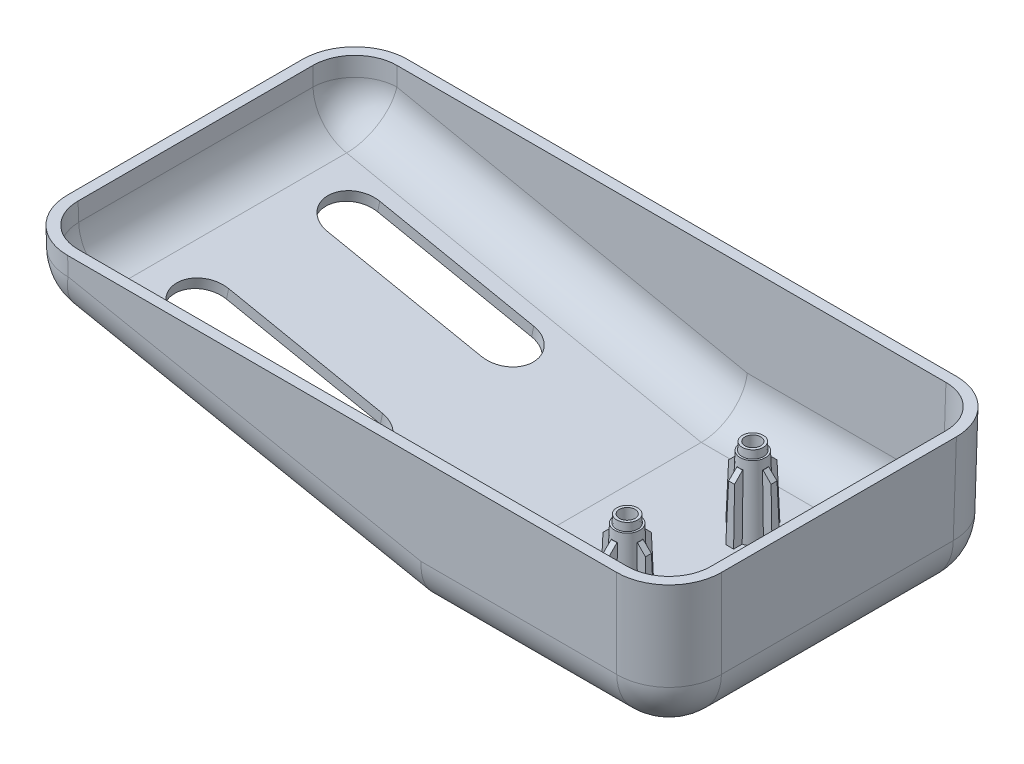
ISO-10303-21;
HEADER;
FILE_DESCRIPTION(('STEP AP214'),'2;1');
FILE_NAME('part.step','',(''),(''),'','','');
FILE_SCHEMA(('AUTOMOTIVE_DESIGN { 1 0 10303 214 1 1 1 1 }'));
ENDSEC;
DATA;
#1=APPLICATION_CONTEXT('core data for automotive mechanical design processes');
#2=APPLICATION_PROTOCOL_DEFINITION('international standard','automotive_design',2000,#1);
#3=PRODUCT_CONTEXT('',#1,'mechanical');
#4=PRODUCT('Part','Part','',(#3));
#5=PRODUCT_RELATED_PRODUCT_CATEGORY('part','',(#4));
#6=PRODUCT_DEFINITION_FORMATION('','',#4);
#7=PRODUCT_DEFINITION_CONTEXT('part definition',#1,'design');
#8=PRODUCT_DEFINITION('design','',#6,#7);
#9=PRODUCT_DEFINITION_SHAPE('','',#8);
#10=(LENGTH_UNIT() NAMED_UNIT(*) SI_UNIT(.MILLI.,.METRE.));
#11=(NAMED_UNIT(*) PLANE_ANGLE_UNIT() SI_UNIT($,.RADIAN.));
#12=(NAMED_UNIT(*) SI_UNIT($,.STERADIAN.) SOLID_ANGLE_UNIT());
#13=UNCERTAINTY_MEASURE_WITH_UNIT(LENGTH_MEASURE(1.E-05),#10,'distance_accuracy_value','');
#14=(GEOMETRIC_REPRESENTATION_CONTEXT(3) GLOBAL_UNCERTAINTY_ASSIGNED_CONTEXT((#13)) GLOBAL_UNIT_ASSIGNED_CONTEXT((#10,
#11,#12)) REPRESENTATION_CONTEXT('',''));
#15=CARTESIAN_POINT('',(0.,0.,0.));
#16=DIRECTION('',(0.,0.,1.));
#17=DIRECTION('',(1.,0.,0.));
#18=AXIS2_PLACEMENT_3D('',#15,#16,#17);
#19=CARTESIAN_POINT('',(46.,25.,30.));
#20=DIRECTION('',(0.,-1.,0.));
#21=DIRECTION('',(1.,0.,0.));
#22=AXIS2_PLACEMENT_3D('',#19,#20,#21);
#23=PLANE('',#22);
#24=DIRECTION('',(-1.,0.,0.));
#25=VECTOR('',#24,1.);
#26=CARTESIAN_POINT('',(46.,25.,32.4366812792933));
#27=LINE('',#26,#25);
#28=CARTESIAN_POINT('',(38.4382043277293,25.,32.4366812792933));
#29=VERTEX_POINT('',#28);
#30=CARTESIAN_POINT('',(-66.4382043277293,25.,32.4366812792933));
#31=VERTEX_POINT('',#30);
#32=EDGE_CURVE('E875',#29,#31,#27,.T.);
#33=ORIENTED_EDGE('',*,*,#32,.F.);
#34=CARTESIAN_POINT('',(38.4351579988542,25.,22.4351579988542));
#35=DIRECTION('',(0.,-1.,0.));
#36=DIRECTION('',(0.707106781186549,0.,0.707106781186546));
#37=AXIS2_PLACEMENT_3D('',#34,#35,#36);
#38=ELLIPSE('',#37,10.0030463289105,10.);
#39=CARTESIAN_POINT('',(48.4366812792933,25.,22.4382043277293));
#40=VERTEX_POINT('',#39);
#41=EDGE_CURVE('E864',#29,#40,#38,.F.);
#42=ORIENTED_EDGE('',*,*,#41,.T.);
#43=DIRECTION('',(0.,0.,1.));
#44=VECTOR('',#43,1.);
#45=CARTESIAN_POINT('',(48.4366812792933,25.,30.));
#46=LINE('',#45,#44);
#47=CARTESIAN_POINT('',(48.4366812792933,25.,-22.4382043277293));
#48=VERTEX_POINT('',#47);
#49=EDGE_CURVE('E884',#40,#48,#46,.F.);
#50=ORIENTED_EDGE('',*,*,#49,.T.);
#51=CARTESIAN_POINT('',(38.4351579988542,25.,-22.4351579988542));
#52=DIRECTION('',(0.,-1.,0.));
#53=DIRECTION('',(0.707106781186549,0.,-0.707106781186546));
#54=AXIS2_PLACEMENT_3D('',#51,#52,#53);
#55=ELLIPSE('',#54,10.0030463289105,10.);
#56=CARTESIAN_POINT('',(38.4382043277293,25.,-32.4366812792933));
#57=VERTEX_POINT('',#56);
#58=EDGE_CURVE('E880',#48,#57,#55,.F.);
#59=ORIENTED_EDGE('',*,*,#58,.T.);
#60=DIRECTION('',(1.,0.,0.));
#61=VECTOR('',#60,1.);
#62=CARTESIAN_POINT('',(46.,25.,-32.4366812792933));
#63=LINE('',#62,#61);
#64=CARTESIAN_POINT('',(-66.4382043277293,25.,-32.4366812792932));
#65=VERTEX_POINT('',#64);
#66=EDGE_CURVE('E872',#57,#65,#63,.F.);
#67=ORIENTED_EDGE('',*,*,#66,.T.);
#68=CARTESIAN_POINT('',(-66.4351579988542,25.,-22.4351579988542));
#69=DIRECTION('',(0.,-1.,0.));
#70=DIRECTION('',(0.707106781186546,0.,0.707106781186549));
#71=AXIS2_PLACEMENT_3D('',#68,#69,#70);
#72=ELLIPSE('',#71,10.0030463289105,10.);
#73=CARTESIAN_POINT('',(-76.4366812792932,25.,-22.4382043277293));
#74=VERTEX_POINT('',#73);
#75=EDGE_CURVE('E877',#65,#74,#72,.F.);
#76=ORIENTED_EDGE('',*,*,#75,.T.);
#77=DIRECTION('',(0.,0.,1.));
#78=VECTOR('',#77,1.);
#79=CARTESIAN_POINT('',(-76.4366812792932,25.,30.));
#80=LINE('',#79,#78);
#81=CARTESIAN_POINT('',(-76.4366812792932,25.,22.4382043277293));
#82=VERTEX_POINT('',#81);
#83=EDGE_CURVE('E881',#82,#74,#80,.F.);
#84=ORIENTED_EDGE('',*,*,#83,.F.);
#85=CARTESIAN_POINT('',(-66.4351579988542,25.,22.4351579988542));
#86=DIRECTION('',(0.,-1.,0.));
#87=DIRECTION('',(0.707106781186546,0.,-0.707106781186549));
#88=AXIS2_PLACEMENT_3D('',#85,#86,#87);
#89=ELLIPSE('',#88,10.0030463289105,10.);
#90=EDGE_CURVE('E879',#82,#31,#89,.F.);
#91=ORIENTED_EDGE('',*,*,#90,.T.);
#92=EDGE_LOOP('',(#33,#42,#50,#59,#67,#76,#84,#91));
#93=FACE_BOUND('',#92,.T.);
#94=CARTESIAN_POINT('',(38.4351579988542,25.,22.4351579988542));
#95=DIRECTION('',(0.,-1.,0.));
#96=DIRECTION('',(0.707106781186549,0.,0.707106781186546));
#97=AXIS2_PLACEMENT_3D('',#94,#95,#96);
#98=ELLIPSE('',#97,8.00243706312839,8.);
#99=CARTESIAN_POINT('',(38.4375950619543,25.,30.4363766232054));
#100=VERTEX_POINT('',#99);
#101=CARTESIAN_POINT('',(46.4363766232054,25.,22.4375950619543));
#102=VERTEX_POINT('',#101);
#103=EDGE_CURVE('E1393',#100,#102,#98,.F.);
#104=ORIENTED_EDGE('',*,*,#103,.F.);
#105=DIRECTION('',(-1.,0.,0.));
#106=VECTOR('',#105,1.);
#107=CARTESIAN_POINT('',(46.,25.,30.4363766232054));
#108=LINE('',#107,#106);
#109=CARTESIAN_POINT('',(-66.4375950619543,25.,30.4363766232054));
#110=VERTEX_POINT('',#109);
#111=EDGE_CURVE('E1367',#100,#110,#108,.T.);
#112=ORIENTED_EDGE('',*,*,#111,.T.);
#113=CARTESIAN_POINT('',(-66.4351579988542,25.,22.4351579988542));
#114=DIRECTION('',(0.,-1.,0.));
#115=DIRECTION('',(0.707106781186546,0.,-0.707106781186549));
#116=AXIS2_PLACEMENT_3D('',#113,#114,#115);
#117=ELLIPSE('',#116,8.00243706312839,8.);
#118=CARTESIAN_POINT('',(-74.4363766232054,25.,22.4375950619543));
#119=VERTEX_POINT('',#118);
#120=EDGE_CURVE('E1391',#119,#110,#117,.F.);
#121=ORIENTED_EDGE('',*,*,#120,.F.);
#122=DIRECTION('',(0.,0.,1.));
#123=VECTOR('',#122,1.);
#124=CARTESIAN_POINT('',(-74.4363766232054,25.,30.));
#125=LINE('',#124,#123);
#126=CARTESIAN_POINT('',(-74.4363766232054,25.,-22.4375950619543));
#127=VERTEX_POINT('',#126);
#128=EDGE_CURVE('E1373',#119,#127,#125,.F.);
#129=ORIENTED_EDGE('',*,*,#128,.T.);
#130=CARTESIAN_POINT('',(-66.4351579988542,25.,-22.4351579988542));
#131=DIRECTION('',(0.,-1.,0.));
#132=DIRECTION('',(0.707106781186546,0.,0.707106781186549));
#133=AXIS2_PLACEMENT_3D('',#130,#131,#132);
#134=ELLIPSE('',#133,8.00243706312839,8.);
#135=CARTESIAN_POINT('',(-66.4375950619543,25.,-30.4363766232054));
#136=VERTEX_POINT('',#135);
#137=EDGE_CURVE('E1389',#136,#127,#134,.F.);
#138=ORIENTED_EDGE('',*,*,#137,.F.);
#139=DIRECTION('',(1.,0.,0.));
#140=VECTOR('',#139,1.);
#141=CARTESIAN_POINT('',(46.,25.,-30.4363766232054));
#142=LINE('',#141,#140);
#143=CARTESIAN_POINT('',(38.4375950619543,25.,-30.4363766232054));
#144=VERTEX_POINT('',#143);
#145=EDGE_CURVE('E1273',#144,#136,#142,.F.);
#146=ORIENTED_EDGE('',*,*,#145,.F.);
#147=CARTESIAN_POINT('',(38.4351579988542,25.,-22.4351579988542));
#148=DIRECTION('',(0.,-1.,0.));
#149=DIRECTION('',(0.707106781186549,0.,-0.707106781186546));
#150=AXIS2_PLACEMENT_3D('',#147,#148,#149);
#151=ELLIPSE('',#150,8.00243706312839,8.);
#152=CARTESIAN_POINT('',(46.4363766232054,25.,-22.4375950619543));
#153=VERTEX_POINT('',#152);
#154=EDGE_CURVE('E1387',#153,#144,#151,.F.);
#155=ORIENTED_EDGE('',*,*,#154,.F.);
#156=DIRECTION('',(0.,0.,1.));
#157=VECTOR('',#156,1.);
#158=CARTESIAN_POINT('',(46.4363766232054,25.,30.));
#159=LINE('',#158,#157);
#160=EDGE_CURVE('E1377',#102,#153,#159,.F.);
#161=ORIENTED_EDGE('',*,*,#160,.F.);
#162=EDGE_LOOP('',(#104,#112,#121,#129,#138,#146,#155,#161));
#163=FACE_BOUND('',#162,.T.);
#164=ADVANCED_FACE('F33',(#93,#163),#23,.F.);
#165=CARTESIAN_POINT('',(-74.3973248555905,13.0398640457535,30.));
#166=DIRECTION('',(0.198662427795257,0.980067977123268,0.));
#167=DIRECTION('',(-0.980067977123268,0.198662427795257,0.));
#168=AXIS2_PLACEMENT_3D('',#165,#166,#167);
#169=PLANE('',#168);
#170=DIRECTION('',(-0.980067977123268,0.198662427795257,0.));
#171=VECTOR('',#170,1.);
#172=CARTESIAN_POINT('',(-74.3973248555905,13.0398640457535,9.43668127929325));
#173=LINE('',#172,#171);
#174=CARTESIAN_POINT('',(-29.6814662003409,3.97583864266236,9.43668127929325));
#175=VERTEX_POINT('',#174);
#176=CARTESIAN_POINT('',(-59.083505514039,9.93571147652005,9.43668127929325));
#177=VERTEX_POINT('',#176);
#178=EDGE_CURVE('E1442',#175,#177,#173,.T.);
#179=ORIENTED_EDGE('',*,*,#178,.T.);
#180=CARTESIAN_POINT('',(-59.083505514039,9.93571147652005,14.4366812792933));
#181=DIRECTION('',(0.198662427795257,0.980067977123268,0.));
#182=DIRECTION('',(-0.980067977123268,0.198662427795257,0.));
#183=AXIS2_PLACEMENT_3D('',#180,#181,#182);
#184=CIRCLE('',#183,5.);
#185=CARTESIAN_POINT('',(-59.083505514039,9.93571147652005,19.4366812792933));
#186=VERTEX_POINT('',#185);
#187=EDGE_CURVE('E1246',#177,#186,#184,.T.);
#188=ORIENTED_EDGE('',*,*,#187,.T.);
#189=DIRECTION('',(0.980067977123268,-0.198662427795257,0.));
#190=VECTOR('',#189,1.);
#191=CARTESIAN_POINT('',(-74.3973248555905,13.0398640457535,19.4366812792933));
#192=LINE('',#191,#190);
#193=CARTESIAN_POINT('',(-29.681466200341,3.97583864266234,19.4366812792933));
#194=VERTEX_POINT('',#193);
#195=EDGE_CURVE('E1448',#186,#194,#192,.T.);
#196=ORIENTED_EDGE('',*,*,#195,.T.);
#197=CARTESIAN_POINT('',(-29.681466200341,3.97583864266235,14.4366812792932));
#198=DIRECTION('',(0.198662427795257,0.980067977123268,0.));
#199=DIRECTION('',(-0.980067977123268,0.198662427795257,0.));
#200=AXIS2_PLACEMENT_3D('',#197,#198,#199);
#201=CIRCLE('',#200,5.);
#202=EDGE_CURVE('E1445',#194,#175,#201,.T.);
#203=ORIENTED_EDGE('',*,*,#202,.T.);
#204=EDGE_LOOP('',(#179,#188,#196,#203));
#205=FACE_BOUND('',#204,.T.);
#206=DIRECTION('',(-0.980067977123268,0.198662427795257,0.));
#207=VECTOR('',#206,1.);
#208=CARTESIAN_POINT('',(-74.3973248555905,13.0398640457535,-19.4366812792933));
#209=LINE('',#208,#207);
#210=CARTESIAN_POINT('',(-29.6814662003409,3.97583864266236,-19.4366812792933));
#211=VERTEX_POINT('',#210);
#212=CARTESIAN_POINT('',(-59.083505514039,9.93571147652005,-19.4366812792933));
#213=VERTEX_POINT('',#212);
#214=EDGE_CURVE('E1454',#211,#213,#209,.T.);
#215=ORIENTED_EDGE('',*,*,#214,.T.);
#216=CARTESIAN_POINT('',(-59.083505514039,9.93571147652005,-14.4366812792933));
#217=DIRECTION('',(0.198662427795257,0.980067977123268,0.));
#218=DIRECTION('',(-0.980067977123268,0.198662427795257,0.));
#219=AXIS2_PLACEMENT_3D('',#216,#217,#218);
#220=CIRCLE('',#219,5.);
#221=CARTESIAN_POINT('',(-59.083505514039,9.93571147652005,-9.43668127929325));
#222=VERTEX_POINT('',#221);
#223=EDGE_CURVE('E1451',#213,#222,#220,.T.);
#224=ORIENTED_EDGE('',*,*,#223,.T.);
#225=DIRECTION('',(0.980067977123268,-0.198662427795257,0.));
#226=VECTOR('',#225,1.);
#227=CARTESIAN_POINT('',(-74.3973248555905,13.0398640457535,-9.43668127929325));
#228=LINE('',#227,#226);
#229=CARTESIAN_POINT('',(-29.681466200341,3.97583864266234,-9.43668127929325));
#230=VERTEX_POINT('',#229);
#231=EDGE_CURVE('E1460',#222,#230,#228,.T.);
#232=ORIENTED_EDGE('',*,*,#231,.T.);
#233=CARTESIAN_POINT('',(-29.681466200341,3.97583864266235,-14.4366812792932));
#234=DIRECTION('',(0.198662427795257,0.980067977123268,0.));
#235=DIRECTION('',(-0.980067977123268,0.198662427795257,0.));
#236=AXIS2_PLACEMENT_3D('',#233,#234,#235);
#237=CIRCLE('',#236,5.);
#238=EDGE_CURVE('E1457',#230,#211,#237,.T.);
#239=ORIENTED_EDGE('',*,*,#238,.T.);
#240=EDGE_LOOP('',(#215,#224,#232,#239));
#241=FACE_BOUND('',#240,.T.);
#242=DIRECTION('',(0.,0.,-1.));
#243=VECTOR('',#242,1.);
#244=CARTESIAN_POINT('',(-0.200662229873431,-2.,30.));
#245=LINE('',#244,#243);
#246=CARTESIAN_POINT('',(-0.200662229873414,-2.,22.1349427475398));
#247=VERTEX_POINT('',#246);
#248=CARTESIAN_POINT('',(-0.200662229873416,-2.,-22.1349427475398));
#249=VERTEX_POINT('',#248);
#250=EDGE_CURVE('E1274',#247,#249,#245,.T.);
#251=ORIENTED_EDGE('',*,*,#250,.F.);
#252=DIRECTION('',(-0.980062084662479,0.198661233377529,0.00346764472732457));
#253=VECTOR('',#252,1.);
#254=CARTESIAN_POINT('',(-0.424051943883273,-1.95471830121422,22.1357331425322));
#255=LINE('',#254,#253);
#256=CARTESIAN_POINT('',(-68.3627373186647,11.8166368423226,22.3761130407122));
#257=VERTEX_POINT('',#256);
#258=EDGE_CURVE('E1278',#247,#257,#255,.T.);
#259=ORIENTED_EDGE('',*,*,#258,.T.);
#260=DIRECTION('',(0.,0.,1.));
#261=VECTOR('',#260,1.);
#262=CARTESIAN_POINT('',(-68.3627373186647,11.8166368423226,30.));
#263=LINE('',#262,#261);
#264=CARTESIAN_POINT('',(-68.3627373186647,11.8166368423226,-22.3761130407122));
#265=VERTEX_POINT('',#264);
#266=EDGE_CURVE('E1281',#257,#265,#263,.F.);
#267=ORIENTED_EDGE('',*,*,#266,.T.);
#268=DIRECTION('',(-0.980062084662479,0.198661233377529,-0.00346764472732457));
#269=VECTOR('',#268,1.);
#270=CARTESIAN_POINT('',(-74.2192516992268,13.0037681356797,-22.396834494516));
#271=LINE('',#270,#269);
#272=EDGE_CURVE('E1283',#265,#249,#271,.F.);
#273=ORIENTED_EDGE('',*,*,#272,.T.);
#274=EDGE_LOOP('',(#251,#259,#267,#273));
#275=FACE_BOUND('',#274,.T.);
#276=ADVANCED_FACE('F744',(#205,#241,#275),#169,.F.);
#277=CARTESIAN_POINT('',(0.,-2.,30.));
#278=DIRECTION('',(0.,1.,0.));
#279=DIRECTION('',(0.,0.,1.));
#280=AXIS2_PLACEMENT_3D('',#277,#278,#279);
#281=PLANE('',#280);
#282=CARTESIAN_POINT('',(19.9960394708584,-2.,11.9972580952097));
#283=DIRECTION('',(0.,1.,0.));
#284=DIRECTION('',(0.,0.,1.));
#285=AXIS2_PLACEMENT_3D('',#282,#283,#284);
#286=CIRCLE('',#285,2.23993732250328);
#287=CARTESIAN_POINT('',(19.9960394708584,-2.,14.2371954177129));
#288=VERTEX_POINT('',#287);
#289=EDGE_CURVE('E37',#288,#288,#286,.T.);
#290=ORIENTED_EDGE('',*,*,#289,.T.);
#291=EDGE_LOOP('',(#290));
#292=FACE_BOUND('',#291,.T.);
#293=CARTESIAN_POINT('',(19.9960394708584,-2.,-11.9972580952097));
#294=DIRECTION('',(0.,1.,0.));
#295=DIRECTION('',(0.,0.,1.));
#296=AXIS2_PLACEMENT_3D('',#293,#294,#295);
#297=CIRCLE('',#296,2.23993732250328);
#298=CARTESIAN_POINT('',(19.9960394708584,-2.,-9.75732077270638));
#299=VERTEX_POINT('',#298);
#300=EDGE_CURVE('E893',#299,#299,#297,.T.);
#301=ORIENTED_EDGE('',*,*,#300,.T.);
#302=EDGE_LOOP('',(#301));
#303=FACE_BOUND('',#302,.T.);
#304=DIRECTION('',(0.,0.,1.));
#305=VECTOR('',#304,1.);
#306=CARTESIAN_POINT('',(38.1384218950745,-2.,30.));
#307=LINE('',#306,#305);
#308=CARTESIAN_POINT('',(38.1384218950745,-2.,-22.1384218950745));
#309=VERTEX_POINT('',#308);
#310=CARTESIAN_POINT('',(38.1384218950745,-2.,22.1384218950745));
#311=VERTEX_POINT('',#310);
#312=EDGE_CURVE('E862',#309,#311,#307,.T.);
#313=ORIENTED_EDGE('',*,*,#312,.T.);
#314=DIRECTION('',(1.,0.,0.));
#315=VECTOR('',#314,1.);
#316=CARTESIAN_POINT('',(0.,-2.,22.1384218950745));
#317=LINE('',#316,#315);
#318=CARTESIAN_POINT('',(-0.200659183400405,-2.,22.1384218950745));
#319=VERTEX_POINT('',#318);
#320=EDGE_CURVE('E1285',#311,#319,#317,.F.);
#321=ORIENTED_EDGE('',*,*,#320,.T.);
#322=CARTESIAN_POINT('',(50.1359822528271,-2.,21.9638712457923));
#323=DIRECTION('',(0.,1.,0.));
#324=DIRECTION('',(-0.999993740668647,0.,0.00353816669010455));
#325=AXIS2_PLACEMENT_3D('',#322,#323,#324);
#326=ELLIPSE('',#325,50.3369471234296,10.);
#327=EDGE_CURVE('E1277',#319,#247,#326,.F.);
#328=ORIENTED_EDGE('',*,*,#327,.T.);
#329=ORIENTED_EDGE('',*,*,#250,.T.);
#330=CARTESIAN_POINT('',(50.1359822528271,-2.,-21.9638712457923));
#331=DIRECTION('',(0.,1.,0.));
#332=DIRECTION('',(-0.999993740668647,0.,-0.00353816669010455));
#333=AXIS2_PLACEMENT_3D('',#330,#331,#332);
#334=ELLIPSE('',#333,50.3369471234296,10.);
#335=CARTESIAN_POINT('',(-0.20065918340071,-2.,-22.1384218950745));
#336=VERTEX_POINT('',#335);
#337=EDGE_CURVE('E891',#249,#336,#334,.F.);
#338=ORIENTED_EDGE('',*,*,#337,.T.);
#339=DIRECTION('',(1.,0.,0.));
#340=VECTOR('',#339,1.);
#341=CARTESIAN_POINT('',(0.,-2.,-22.1384218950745));
#342=LINE('',#341,#340);
#343=EDGE_CURVE('E1287',#336,#309,#342,.T.);
#344=ORIENTED_EDGE('',*,*,#343,.T.);
#345=EDGE_LOOP('',(#313,#321,#328,#329,#338,#344));
#346=FACE_BOUND('',#345,.T.);
#347=ADVANCED_FACE('F750',(#292,#303,#346),#281,.F.);
#348=CARTESIAN_POINT('',(47.9996953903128,-0.0349048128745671,30.));
#349=DIRECTION('',(0.999847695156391,-0.0174524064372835,0.));
#350=DIRECTION('',(0.0174524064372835,0.999847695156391,0.));
#351=AXIS2_PLACEMENT_3D('',#348,#349,#350);
#352=PLANE('',#351);
#353=ORIENTED_EDGE('',*,*,#49,.F.);
#354=DIRECTION('',(0.0174497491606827,0.999695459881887,0.0174497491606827));
#355=VECTOR('',#354,1.);
#356=CARTESIAN_POINT('',(47.9881242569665,-0.697814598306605,21.9896473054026));
#357=LINE('',#356,#355);
#358=CARTESIAN_POINT('',(48.1368988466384,7.82547593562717,22.1384218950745));
#359=VERTEX_POINT('',#358);
#360=EDGE_CURVE('E858',#40,#359,#357,.F.);
#361=ORIENTED_EDGE('',*,*,#360,.T.);
#362=DIRECTION('',(0.,0.,1.));
#363=VECTOR('',#362,1.);
#364=CARTESIAN_POINT('',(48.1368988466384,7.82547593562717,30.));
#365=LINE('',#364,#363);
#366=CARTESIAN_POINT('',(48.1368988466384,7.82547593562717,-22.1384218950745));
#367=VERTEX_POINT('',#366);
#368=EDGE_CURVE('E857',#359,#367,#365,.F.);
#369=ORIENTED_EDGE('',*,*,#368,.T.);
#370=DIRECTION('',(0.0174497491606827,0.999695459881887,-0.0174497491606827));
#371=VECTOR('',#370,1.);
#372=CARTESIAN_POINT('',(47.9838613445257,-0.942036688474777,-21.9853843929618));
#373=LINE('',#372,#371);
#374=EDGE_CURVE('E859',#367,#48,#373,.T.);
#375=ORIENTED_EDGE('',*,*,#374,.T.);
#376=EDGE_LOOP('',(#353,#361,#369,#375));
#377=FACE_BOUND('',#376,.T.);
#378=ADVANCED_FACE('F761',(#377),#352,.T.);
#379=CARTESIAN_POINT('',(-75.9996953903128,-0.0349048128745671,30.));
#380=DIRECTION('',(-0.999847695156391,-0.0174524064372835,0.));
#381=DIRECTION('',(0.0174524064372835,-0.999847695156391,0.));
#382=AXIS2_PLACEMENT_3D('',#379,#380,#381);
#383=PLANE('',#382);
#384=DIRECTION('',(0.,0.,1.));
#385=VECTOR('',#384,1.);
#386=CARTESIAN_POINT('',(-76.3745899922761,21.4427925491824,30.));
#387=LINE('',#386,#385);
#388=CARTESIAN_POINT('',(-76.3745899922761,21.4427925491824,-22.3761130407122));
#389=VERTEX_POINT('',#388);
#390=CARTESIAN_POINT('',(-76.3745899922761,21.4427925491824,22.3761130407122));
#391=VERTEX_POINT('',#390);
#392=EDGE_CURVE('E1312',#389,#391,#387,.T.);
#393=ORIENTED_EDGE('',*,*,#392,.T.);
#394=DIRECTION('',(0.0174497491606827,-0.999695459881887,-0.0174497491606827));
#395=VECTOR('',#394,1.);
#396=CARTESIAN_POINT('',(-75.9795984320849,-1.18625877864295,21.981121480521));
#397=LINE('',#396,#395);
#398=EDGE_CURVE('E1307',#391,#82,#397,.F.);
#399=ORIENTED_EDGE('',*,*,#398,.T.);
#400=ORIENTED_EDGE('',*,*,#83,.T.);
#401=DIRECTION('',(0.0174497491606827,-0.999695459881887,0.0174497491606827));
#402=VECTOR('',#401,1.);
#403=CARTESIAN_POINT('',(-75.9838613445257,-0.942036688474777,-21.9853843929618));
#404=LINE('',#403,#402);
#405=EDGE_CURVE('E1280',#74,#389,#404,.T.);
#406=ORIENTED_EDGE('',*,*,#405,.T.);
#407=EDGE_LOOP('',(#393,#399,#400,#406));
#408=FACE_BOUND('',#407,.T.);
#409=ADVANCED_FACE('F765',(#408),#383,.T.);
#410=CARTESIAN_POINT('',(0.,-0.0349048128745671,31.9996953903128));
#411=DIRECTION('',(0.,-0.0174524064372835,0.999847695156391));
#412=DIRECTION('',(0.,-0.999847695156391,-0.0174524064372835));
#413=AXIS2_PLACEMENT_3D('',#410,#411,#412);
#414=PLANE('',#413);
#415=DIRECTION('',(1.,0.,0.));
#416=VECTOR('',#415,1.);
#417=CARTESIAN_POINT('',(0.,7.82547593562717,32.1368988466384));
#418=LINE('',#417,#416);
#419=CARTESIAN_POINT('',(0.802648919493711,7.82547593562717,32.1368988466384));
#420=VERTEX_POINT('',#419);
#421=CARTESIAN_POINT('',(38.1384218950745,7.82547593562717,32.1368988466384));
#422=VERTEX_POINT('',#421);
#423=EDGE_CURVE('E1323',#420,#422,#418,.T.);
#424=ORIENTED_EDGE('',*,*,#423,.T.);
#425=DIRECTION('',(0.0174497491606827,0.999695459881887,0.0174497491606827));
#426=VECTOR('',#425,1.);
#427=CARTESIAN_POINT('',(37.9896473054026,-0.697814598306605,31.9881242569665));
#428=LINE('',#427,#426);
#429=EDGE_CURVE('E892',#422,#29,#428,.T.);
#430=ORIENTED_EDGE('',*,*,#429,.T.);
#431=ORIENTED_EDGE('',*,*,#32,.T.);
#432=DIRECTION('',(0.0174497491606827,-0.999695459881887,-0.0174497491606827));
#433=VECTOR('',#432,1.);
#434=CARTESIAN_POINT('',(-65.981121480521,-1.18625877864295,31.9795984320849));
#435=LINE('',#434,#433);
#436=CARTESIAN_POINT('',(-66.3761130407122,21.4427925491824,32.3745899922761));
#437=VERTEX_POINT('',#436);
#438=EDGE_CURVE('E1292',#31,#437,#435,.T.);
#439=ORIENTED_EDGE('',*,*,#438,.T.);
#440=DIRECTION('',(-0.980062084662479,0.198661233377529,0.00346764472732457));
#441=VECTOR('',#440,1.);
#442=CARTESIAN_POINT('',(1.5625723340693,7.67143740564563,32.1342100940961));
#443=LINE('',#442,#441);
#444=EDGE_CURVE('E1322',#437,#420,#443,.F.);
#445=ORIENTED_EDGE('',*,*,#444,.T.);
#446=EDGE_LOOP('',(#424,#430,#431,#439,#445));
#447=FACE_BOUND('',#446,.T.);
#448=ADVANCED_FACE('F769',(#447),#414,.T.);
#449=CARTESIAN_POINT('',(0.,-0.0349048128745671,-31.9996953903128));
#450=DIRECTION('',(0.,-0.0174524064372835,-0.999847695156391));
#451=DIRECTION('',(0.,0.999847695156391,-0.0174524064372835));
#452=AXIS2_PLACEMENT_3D('',#449,#450,#451);
#453=PLANE('',#452);
#454=DIRECTION('',(-0.980062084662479,0.198661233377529,-0.00346764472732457));
#455=VECTOR('',#454,1.);
#456=CARTESIAN_POINT('',(-72.2326274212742,22.6299238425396,-32.39531144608));
#457=LINE('',#456,#455);
#458=CARTESIAN_POINT('',(0.802648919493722,7.82547593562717,-32.1368988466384));
#459=VERTEX_POINT('',#458);
#460=CARTESIAN_POINT('',(-66.3761130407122,21.4427925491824,-32.3745899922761));
#461=VERTEX_POINT('',#460);
#462=EDGE_CURVE('E42',#459,#461,#457,.T.);
#463=ORIENTED_EDGE('',*,*,#462,.T.);
#464=DIRECTION('',(0.0174497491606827,-0.999695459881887,0.0174497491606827));
#465=VECTOR('',#464,1.);
#466=CARTESIAN_POINT('',(-65.9853843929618,-0.942036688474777,-31.9838613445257));
#467=LINE('',#466,#465);
#468=EDGE_CURVE('E11',#461,#65,#467,.F.);
#469=ORIENTED_EDGE('',*,*,#468,.T.);
#470=ORIENTED_EDGE('',*,*,#66,.F.);
#471=DIRECTION('',(0.0174497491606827,0.999695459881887,-0.0174497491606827));
#472=VECTOR('',#471,1.);
#473=CARTESIAN_POINT('',(37.9853843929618,-0.942036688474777,-31.9838613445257));
#474=LINE('',#473,#472);
#475=CARTESIAN_POINT('',(38.1384218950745,7.82547593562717,-32.1368988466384));
#476=VERTEX_POINT('',#475);
#477=EDGE_CURVE('E1305',#57,#476,#474,.F.);
#478=ORIENTED_EDGE('',*,*,#477,.T.);
#479=DIRECTION('',(1.,0.,0.));
#480=VECTOR('',#479,1.);
#481=CARTESIAN_POINT('',(0.,7.82547593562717,-32.1368988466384));
#482=LINE('',#481,#480);
#483=EDGE_CURVE('E1300',#476,#459,#482,.F.);
#484=ORIENTED_EDGE('',*,*,#483,.T.);
#485=EDGE_LOOP('',(#463,#469,#470,#478,#484));
#486=FACE_BOUND('',#485,.T.);
#487=ADVANCED_FACE('F773',(#486),#453,.T.);
#488=CARTESIAN_POINT('',(-65.9853843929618,-0.767512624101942,-21.9853843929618));
#489=DIRECTION('',(0.0174497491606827,-0.999695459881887,0.0174497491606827));
#490=DIRECTION('',(0.,-0.0174524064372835,-0.999847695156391));
#491=AXIS2_PLACEMENT_3D('',#488,#489,#490);
#492=CYLINDRICAL_SURFACE('',#491,10.);
#493=CARTESIAN_POINT('',(-66.3761130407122,21.6173166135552,-22.3761130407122));
#494=DIRECTION('',(0.0174497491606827,-0.999695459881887,0.0174497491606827));
#495=DIRECTION('',(0.,-0.0174524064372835,-0.999847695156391));
#496=AXIS2_PLACEMENT_3D('',#493,#494,#495);
#497=CIRCLE('',#496,10.);
#498=EDGE_CURVE('E876',#389,#461,#497,.T.);
#499=ORIENTED_EDGE('',*,*,#498,.F.);
#500=ORIENTED_EDGE('',*,*,#405,.F.);
#501=ORIENTED_EDGE('',*,*,#75,.F.);
#502=ORIENTED_EDGE('',*,*,#468,.F.);
#503=EDGE_LOOP('',(#499,#500,#501,#502));
#504=FACE_BOUND('',#503,.T.);
#505=ADVANCED_FACE('F777',(#504),#492,.T.);
#506=CARTESIAN_POINT('',(-66.3761130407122,21.6173166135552,-22.3761130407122));
#507=DIRECTION('',(0.,0.,1.));
#508=DIRECTION('',(1.,0.,0.));
#509=AXIS2_PLACEMENT_3D('',#506,#507,#508);
#510=SPHERICAL_SURFACE('',#509,10.);
#511=CARTESIAN_POINT('',(-66.3761130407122,21.6173166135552,-22.3761130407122));
#512=DIRECTION('',(0.,0.,1.));
#513=DIRECTION('',(1.,0.,0.));
#514=AXIS2_PLACEMENT_3D('',#511,#512,#513);
#515=CIRCLE('',#514,10.);
#516=EDGE_CURVE('E1298',#389,#265,#515,.T.);
#517=ORIENTED_EDGE('',*,*,#516,.F.);
#518=ORIENTED_EDGE('',*,*,#498,.T.);
#519=CARTESIAN_POINT('',(-66.3761130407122,21.6173166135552,-22.3761130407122));
#520=DIRECTION('',(-0.980062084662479,0.198661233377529,-0.00346764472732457));
#521=DIRECTION('',(-0.198662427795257,-0.980067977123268,0.));
#522=AXIS2_PLACEMENT_3D('',#519,#520,#521);
#523=CIRCLE('',#522,10.);
#524=EDGE_CURVE('E1295',#265,#461,#523,.F.);
#525=ORIENTED_EDGE('',*,*,#524,.F.);
#526=EDGE_LOOP('',(#517,#518,#525));
#527=FACE_BOUND('',#526,.T.);
#528=ADVANCED_FACE('F781',(#527),#510,.T.);
#529=CARTESIAN_POINT('',(-72.2326274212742,22.8044479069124,-22.396834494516));
#530=DIRECTION('',(-0.980062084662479,0.198661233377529,-0.00346764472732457));
#531=DIRECTION('',(-0.198662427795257,-0.980067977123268,0.));
#532=AXIS2_PLACEMENT_3D('',#529,#530,#531);
#533=CYLINDRICAL_SURFACE('',#532,10.);
#534=ORIENTED_EDGE('',*,*,#524,.T.);
#535=ORIENTED_EDGE('',*,*,#462,.F.);
#536=CARTESIAN_POINT('',(0.802648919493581,8.00000000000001,-22.1384218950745));
#537=DIRECTION('',(-0.995003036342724,0.099829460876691,-0.0017425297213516));
#538=DIRECTION('',(-0.099844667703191,-0.994851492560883,0.0173651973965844));
#539=AXIS2_PLACEMENT_3D('',#536,#537,#538);
#540=ELLIPSE('',#539,10.050220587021,10.);
#541=EDGE_CURVE('E1301',#336,#459,#540,.F.);
#542=ORIENTED_EDGE('',*,*,#541,.F.);
#543=ORIENTED_EDGE('',*,*,#337,.F.);
#544=ORIENTED_EDGE('',*,*,#272,.F.);
#545=EDGE_LOOP('',(#534,#535,#542,#543,#544));
#546=FACE_BOUND('',#545,.T.);
#547=ADVANCED_FACE('F785',(#546),#533,.T.);
#548=CARTESIAN_POINT('',(-66.3761130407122,21.6173166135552,30.));
#549=DIRECTION('',(0.,0.,1.));
#550=DIRECTION('',(1.,0.,0.));
#551=AXIS2_PLACEMENT_3D('',#548,#549,#550);
#552=CYLINDRICAL_SURFACE('',#551,10.);
#553=ORIENTED_EDGE('',*,*,#516,.T.);
#554=ORIENTED_EDGE('',*,*,#266,.F.);
#555=CARTESIAN_POINT('',(-66.3761130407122,21.6173166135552,22.3761130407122));
#556=DIRECTION('',(0.,0.,1.));
#557=DIRECTION('',(1.,0.,0.));
#558=AXIS2_PLACEMENT_3D('',#555,#556,#557);
#559=CIRCLE('',#558,10.);
#560=EDGE_CURVE('E1303',#391,#257,#559,.T.);
#561=ORIENTED_EDGE('',*,*,#560,.F.);
#562=ORIENTED_EDGE('',*,*,#392,.F.);
#563=EDGE_LOOP('',(#553,#554,#561,#562));
#564=FACE_BOUND('',#563,.T.);
#565=ADVANCED_FACE('F789',(#564),#552,.T.);
#566=CARTESIAN_POINT('',(-65.981121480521,-1.01173471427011,21.981121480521));
#567=DIRECTION('',(0.0174497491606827,-0.999695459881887,-0.0174497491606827));
#568=DIRECTION('',(0.,0.0174524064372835,-0.999847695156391));
#569=AXIS2_PLACEMENT_3D('',#566,#567,#568);
#570=CYLINDRICAL_SURFACE('',#569,10.);
#571=ORIENTED_EDGE('',*,*,#90,.F.);
#572=ORIENTED_EDGE('',*,*,#398,.F.);
#573=CARTESIAN_POINT('',(-66.3761130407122,21.6173166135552,22.3761130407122));
#574=DIRECTION('',(0.0174497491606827,-0.999695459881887,-0.0174497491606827));
#575=DIRECTION('',(0.,0.0174524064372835,-0.999847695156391));
#576=AXIS2_PLACEMENT_3D('',#573,#574,#575);
#577=CIRCLE('',#576,10.);
#578=EDGE_CURVE('E868',#437,#391,#577,.T.);
#579=ORIENTED_EDGE('',*,*,#578,.F.);
#580=ORIENTED_EDGE('',*,*,#438,.F.);
#581=EDGE_LOOP('',(#571,#572,#579,#580));
#582=FACE_BOUND('',#581,.T.);
#583=ADVANCED_FACE('F793',(#582),#570,.T.);
#584=CARTESIAN_POINT('',(37.9853843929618,-0.767512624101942,-21.9853843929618));
#585=DIRECTION('',(0.0174497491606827,0.999695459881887,-0.0174497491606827));
#586=DIRECTION('',(0.,0.0174524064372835,0.999847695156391));
#587=AXIS2_PLACEMENT_3D('',#584,#585,#586);
#588=CYLINDRICAL_SURFACE('',#587,10.);
#589=ORIENTED_EDGE('',*,*,#58,.F.);
#590=ORIENTED_EDGE('',*,*,#374,.F.);
#591=CARTESIAN_POINT('',(38.1384218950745,8.,-22.1384218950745));
#592=DIRECTION('',(0.0174497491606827,0.999695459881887,-0.0174497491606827));
#593=DIRECTION('',(0.,0.0174524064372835,0.999847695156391));
#594=AXIS2_PLACEMENT_3D('',#591,#592,#593);
#595=CIRCLE('',#594,10.);
#596=EDGE_CURVE('E865',#476,#367,#595,.F.);
#597=ORIENTED_EDGE('',*,*,#596,.F.);
#598=ORIENTED_EDGE('',*,*,#477,.F.);
#599=EDGE_LOOP('',(#589,#590,#597,#598));
#600=FACE_BOUND('',#599,.T.);
#601=ADVANCED_FACE('F797',(#600),#588,.T.);
#602=CARTESIAN_POINT('',(0.,8.,-22.1384218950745));
#603=DIRECTION('',(-1.,0.,0.));
#604=DIRECTION('',(0.,0.,1.));
#605=AXIS2_PLACEMENT_3D('',#602,#603,#604);
#606=CYLINDRICAL_SURFACE('',#605,10.);
#607=ORIENTED_EDGE('',*,*,#541,.T.);
#608=ORIENTED_EDGE('',*,*,#483,.F.);
#609=CARTESIAN_POINT('',(38.1384218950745,8.,-22.1384218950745));
#610=DIRECTION('',(-1.,0.,0.));
#611=DIRECTION('',(0.,-1.,0.));
#612=AXIS2_PLACEMENT_3D('',#609,#610,#611);
#613=CIRCLE('',#612,10.);
#614=EDGE_CURVE('E869',#309,#476,#613,.F.);
#615=ORIENTED_EDGE('',*,*,#614,.F.);
#616=ORIENTED_EDGE('',*,*,#343,.F.);
#617=EDGE_LOOP('',(#607,#608,#615,#616));
#618=FACE_BOUND('',#617,.T.);
#619=ADVANCED_FACE('F801',(#618),#606,.T.);
#620=CARTESIAN_POINT('',(-66.3761130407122,21.6173166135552,22.3761130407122));
#621=DIRECTION('',(0.,0.,1.));
#622=DIRECTION('',(1.,0.,0.));
#623=AXIS2_PLACEMENT_3D('',#620,#621,#622);
#624=SPHERICAL_SURFACE('',#623,10.);
#625=ORIENTED_EDGE('',*,*,#578,.T.);
#626=ORIENTED_EDGE('',*,*,#560,.T.);
#627=CARTESIAN_POINT('',(-66.3761130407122,21.6173166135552,22.3761130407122));
#628=DIRECTION('',(-0.980062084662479,0.198661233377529,0.00346764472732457));
#629=DIRECTION('',(-0.198662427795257,-0.980067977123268,0.));
#630=AXIS2_PLACEMENT_3D('',#627,#628,#629);
#631=CIRCLE('',#630,10.);
#632=EDGE_CURVE('E856',#437,#257,#631,.F.);
#633=ORIENTED_EDGE('',*,*,#632,.F.);
#634=EDGE_LOOP('',(#625,#626,#633));
#635=FACE_BOUND('',#634,.T.);
#636=ADVANCED_FACE('F805',(#635),#624,.T.);
#637=CARTESIAN_POINT('',(38.1384218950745,8.,-22.1384218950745));
#638=DIRECTION('',(0.,0.,1.));
#639=DIRECTION('',(1.,0.,0.));
#640=AXIS2_PLACEMENT_3D('',#637,#638,#639);
#641=SPHERICAL_SURFACE('',#640,10.);
#642=ORIENTED_EDGE('',*,*,#614,.T.);
#643=ORIENTED_EDGE('',*,*,#596,.T.);
#644=CARTESIAN_POINT('',(38.1384218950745,8.,-22.1384218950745));
#645=DIRECTION('',(0.,0.,1.));
#646=DIRECTION('',(1.,0.,0.));
#647=AXIS2_PLACEMENT_3D('',#644,#645,#646);
#648=CIRCLE('',#647,10.);
#649=EDGE_CURVE('E853',#309,#367,#648,.T.);
#650=ORIENTED_EDGE('',*,*,#649,.F.);
#651=EDGE_LOOP('',(#642,#643,#650));
#652=FACE_BOUND('',#651,.T.);
#653=ADVANCED_FACE('F809',(#652),#641,.T.);
#654=CARTESIAN_POINT('',(1.5625723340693,7.84596147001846,22.1357331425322));
#655=DIRECTION('',(-0.980062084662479,0.198661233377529,0.00346764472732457));
#656=DIRECTION('',(-0.198662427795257,-0.980067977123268,0.));
#657=AXIS2_PLACEMENT_3D('',#654,#655,#656);
#658=CYLINDRICAL_SURFACE('',#657,10.);
#659=ORIENTED_EDGE('',*,*,#258,.F.);
#660=ORIENTED_EDGE('',*,*,#327,.F.);
#661=CARTESIAN_POINT('',(0.802648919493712,8.,22.1384218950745));
#662=DIRECTION('',(-0.995003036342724,0.099829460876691,0.0017425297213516));
#663=DIRECTION('',(-0.099844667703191,-0.994851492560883,-0.0173651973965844));
#664=AXIS2_PLACEMENT_3D('',#661,#662,#663);
#665=ELLIPSE('',#664,10.050220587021,10.);
#666=EDGE_CURVE('E846',#420,#319,#665,.F.);
#667=ORIENTED_EDGE('',*,*,#666,.F.);
#668=ORIENTED_EDGE('',*,*,#444,.F.);
#669=ORIENTED_EDGE('',*,*,#632,.T.);
#670=EDGE_LOOP('',(#659,#660,#667,#668,#669));
#671=FACE_BOUND('',#670,.T.);
#672=ADVANCED_FACE('F813',(#671),#658,.T.);
#673=CARTESIAN_POINT('',(38.1384218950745,8.,30.));
#674=DIRECTION('',(0.,0.,1.));
#675=DIRECTION('',(1.,0.,0.));
#676=AXIS2_PLACEMENT_3D('',#673,#674,#675);
#677=CYLINDRICAL_SURFACE('',#676,10.);
#678=ORIENTED_EDGE('',*,*,#649,.T.);
#679=ORIENTED_EDGE('',*,*,#368,.F.);
#680=CARTESIAN_POINT('',(38.1384218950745,8.,22.1384218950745));
#681=DIRECTION('',(0.,0.,1.));
#682=DIRECTION('',(1.,0.,0.));
#683=AXIS2_PLACEMENT_3D('',#680,#681,#682);
#684=CIRCLE('',#683,10.);
#685=EDGE_CURVE('E839',#311,#359,#684,.T.);
#686=ORIENTED_EDGE('',*,*,#685,.F.);
#687=ORIENTED_EDGE('',*,*,#312,.F.);
#688=EDGE_LOOP('',(#678,#679,#686,#687));
#689=FACE_BOUND('',#688,.T.);
#690=ADVANCED_FACE('F817',(#689),#677,.T.);
#691=CARTESIAN_POINT('',(0.,8.,22.1384218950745));
#692=DIRECTION('',(-1.,0.,0.));
#693=DIRECTION('',(0.,0.,1.));
#694=AXIS2_PLACEMENT_3D('',#691,#692,#693);
#695=CYLINDRICAL_SURFACE('',#694,10.);
#696=ORIENTED_EDGE('',*,*,#666,.T.);
#697=ORIENTED_EDGE('',*,*,#320,.F.);
#698=CARTESIAN_POINT('',(38.1384218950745,8.,22.1384218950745));
#699=DIRECTION('',(-1.,0.,0.));
#700=DIRECTION('',(0.,-1.,0.));
#701=AXIS2_PLACEMENT_3D('',#698,#699,#700);
#702=CIRCLE('',#701,10.);
#703=EDGE_CURVE('E837',#422,#311,#702,.F.);
#704=ORIENTED_EDGE('',*,*,#703,.F.);
#705=ORIENTED_EDGE('',*,*,#423,.F.);
#706=EDGE_LOOP('',(#696,#697,#704,#705));
#707=FACE_BOUND('',#706,.T.);
#708=ADVANCED_FACE('F821',(#707),#695,.T.);
#709=CARTESIAN_POINT('',(38.1384218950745,8.,22.1384218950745));
#710=DIRECTION('',(0.,0.,1.));
#711=DIRECTION('',(1.,0.,0.));
#712=AXIS2_PLACEMENT_3D('',#709,#710,#711);
#713=SPHERICAL_SURFACE('',#712,10.);
#714=ORIENTED_EDGE('',*,*,#703,.T.);
#715=ORIENTED_EDGE('',*,*,#685,.T.);
#716=CARTESIAN_POINT('',(38.1384218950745,8.,22.1384218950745));
#717=DIRECTION('',(0.0174497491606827,0.999695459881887,0.0174497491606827));
#718=DIRECTION('',(0.,-0.0174524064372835,0.999847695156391));
#719=AXIS2_PLACEMENT_3D('',#716,#717,#718);
#720=CIRCLE('',#719,10.);
#721=EDGE_CURVE('E841',#422,#359,#720,.T.);
#722=ORIENTED_EDGE('',*,*,#721,.F.);
#723=EDGE_LOOP('',(#714,#715,#722));
#724=FACE_BOUND('',#723,.T.);
#725=ADVANCED_FACE('F824',(#724),#713,.T.);
#726=CARTESIAN_POINT('',(37.9896473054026,-0.52329053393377,21.9896473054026));
#727=DIRECTION('',(0.0174497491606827,0.999695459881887,0.0174497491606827));
#728=DIRECTION('',(0.,-0.0174524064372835,0.999847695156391));
#729=AXIS2_PLACEMENT_3D('',#726,#727,#728);
#730=CYLINDRICAL_SURFACE('',#729,10.);
#731=ORIENTED_EDGE('',*,*,#721,.T.);
#732=ORIENTED_EDGE('',*,*,#360,.F.);
#733=ORIENTED_EDGE('',*,*,#41,.F.);
#734=ORIENTED_EDGE('',*,*,#429,.F.);
#735=EDGE_LOOP('',(#731,#732,#733,#734));
#736=FACE_BOUND('',#735,.T.);
#737=ADVANCED_FACE('F35',(#736),#730,.T.);
#738=CARTESIAN_POINT('',(-74.,15.,30.));
#739=DIRECTION('',(0.198662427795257,0.980067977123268,0.));
#740=DIRECTION('',(-0.980067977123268,0.198662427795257,0.));
#741=AXIS2_PLACEMENT_3D('',#738,#739,#740);
#742=PLANE('',#741);
#743=CARTESIAN_POINT('',(-58.6861806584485,11.8958474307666,14.4366812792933));
#744=DIRECTION('',(0.198662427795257,0.980067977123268,0.));
#745=DIRECTION('',(-0.980067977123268,0.198662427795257,0.));
#746=AXIS2_PLACEMENT_3D('',#743,#744,#745);
#747=CIRCLE('',#746,5.);
#748=CARTESIAN_POINT('',(-58.6861806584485,11.8958474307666,9.43668127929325));
#749=VERTEX_POINT('',#748);
#750=CARTESIAN_POINT('',(-58.6861806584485,11.8958474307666,19.4366812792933));
#751=VERTEX_POINT('',#750);
#752=EDGE_CURVE('E1474',#749,#751,#747,.T.);
#753=ORIENTED_EDGE('',*,*,#752,.F.);
#754=DIRECTION('',(-0.980067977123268,0.198662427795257,0.));
#755=VECTOR('',#754,1.);
#756=CARTESIAN_POINT('',(-58.6861806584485,11.8958474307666,9.43668127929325));
#757=LINE('',#756,#755);
#758=CARTESIAN_POINT('',(-29.2841413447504,5.93597459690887,9.43668127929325));
#759=VERTEX_POINT('',#758);
#760=EDGE_CURVE('E1488',#759,#749,#757,.T.);
#761=ORIENTED_EDGE('',*,*,#760,.F.);
#762=CARTESIAN_POINT('',(-29.2841413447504,5.93597459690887,14.4366812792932));
#763=DIRECTION('',(0.198662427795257,0.980067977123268,0.));
#764=DIRECTION('',(-0.980067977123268,0.198662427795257,0.));
#765=AXIS2_PLACEMENT_3D('',#762,#763,#764);
#766=CIRCLE('',#765,5.);
#767=CARTESIAN_POINT('',(-29.2841413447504,5.93597459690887,19.4366812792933));
#768=VERTEX_POINT('',#767);
#769=EDGE_CURVE('E1495',#768,#759,#766,.T.);
#770=ORIENTED_EDGE('',*,*,#769,.F.);
#771=DIRECTION('',(0.980067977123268,-0.198662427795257,0.));
#772=VECTOR('',#771,1.);
#773=CARTESIAN_POINT('',(-58.6861806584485,11.8958474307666,19.4366812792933));
#774=LINE('',#773,#772);
#775=EDGE_CURVE('E1498',#751,#768,#774,.T.);
#776=ORIENTED_EDGE('',*,*,#775,.F.);
#777=EDGE_LOOP('',(#753,#761,#770,#776));
#778=FACE_BOUND('',#777,.T.);
#779=CARTESIAN_POINT('',(-58.6861806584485,11.8958474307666,-14.4366812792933));
#780=DIRECTION('',(0.198662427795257,0.980067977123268,0.));
#781=DIRECTION('',(0.980067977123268,-0.198662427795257,0.));
#782=AXIS2_PLACEMENT_3D('',#779,#780,#781);
#783=CIRCLE('',#782,5.);
#784=CARTESIAN_POINT('',(-58.6861806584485,11.8958474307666,-19.4366812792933));
#785=VERTEX_POINT('',#784);
#786=CARTESIAN_POINT('',(-58.6861806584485,11.8958474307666,-9.43668127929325));
#787=VERTEX_POINT('',#786);
#788=EDGE_CURVE('E1483',#785,#787,#783,.T.);
#789=ORIENTED_EDGE('',*,*,#788,.F.);
#790=DIRECTION('',(-0.980067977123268,0.198662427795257,0.));
#791=VECTOR('',#790,1.);
#792=CARTESIAN_POINT('',(-58.6861806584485,11.8958474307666,-19.4366812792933));
#793=LINE('',#792,#791);
#794=CARTESIAN_POINT('',(-29.2841413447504,5.93597459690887,-19.4366812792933));
#795=VERTEX_POINT('',#794);
#796=EDGE_CURVE('E1468',#795,#785,#793,.T.);
#797=ORIENTED_EDGE('',*,*,#796,.F.);
#798=CARTESIAN_POINT('',(-29.2841413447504,5.93597459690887,-14.4366812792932));
#799=DIRECTION('',(0.198662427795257,0.980067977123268,0.));
#800=DIRECTION('',(0.980067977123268,-0.198662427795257,0.));
#801=AXIS2_PLACEMENT_3D('',#798,#799,#800);
#802=CIRCLE('',#801,5.);
#803=CARTESIAN_POINT('',(-29.2841413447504,5.93597459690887,-9.43668127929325));
#804=VERTEX_POINT('',#803);
#805=EDGE_CURVE('E1477',#804,#795,#802,.T.);
#806=ORIENTED_EDGE('',*,*,#805,.F.);
#807=DIRECTION('',(0.980067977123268,-0.198662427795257,0.));
#808=VECTOR('',#807,1.);
#809=CARTESIAN_POINT('',(-58.6861806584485,11.8958474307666,-9.43668127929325));
#810=LINE('',#809,#808);
#811=EDGE_CURVE('E1480',#787,#804,#810,.T.);
#812=ORIENTED_EDGE('',*,*,#811,.F.);
#813=EDGE_LOOP('',(#789,#797,#806,#812));
#814=FACE_BOUND('',#813,.T.);
#815=DIRECTION('',(0.,0.,-1.));
#816=VECTOR('',#815,1.);
#817=CARTESIAN_POINT('',(0.,0.,30.));
#818=LINE('',#817,#816);
#819=CARTESIAN_POINT('',(0.,0.,22.1356385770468));
#820=VERTEX_POINT('',#819);
#821=CARTESIAN_POINT('',(0.,0.,-22.1356385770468));
#822=VERTEX_POINT('',#821);
#823=EDGE_CURVE('E1217',#820,#822,#818,.T.);
#824=ORIENTED_EDGE('',*,*,#823,.T.);
#825=DIRECTION('',(-0.980062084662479,0.198661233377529,-0.00346764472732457));
#826=VECTOR('',#825,1.);
#827=CARTESIAN_POINT('',(-73.8219268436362,14.9639040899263,-22.396834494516));
#828=LINE('',#827,#826);
#829=CARTESIAN_POINT('',(-67.9654124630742,13.7767727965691,-22.3761130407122));
#830=VERTEX_POINT('',#829);
#831=EDGE_CURVE('E1205',#830,#822,#828,.F.);
#832=ORIENTED_EDGE('',*,*,#831,.F.);
#833=DIRECTION('',(0.,0.,1.));
#834=VECTOR('',#833,1.);
#835=CARTESIAN_POINT('',(-67.9654124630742,13.7767727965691,30.));
#836=LINE('',#835,#834);
#837=CARTESIAN_POINT('',(-67.9654124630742,13.7767727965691,22.3761130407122));
#838=VERTEX_POINT('',#837);
#839=EDGE_CURVE('E1215',#838,#830,#836,.F.);
#840=ORIENTED_EDGE('',*,*,#839,.F.);
#841=DIRECTION('',(0.980062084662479,-0.198661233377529,-0.00346764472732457));
#842=VECTOR('',#841,1.);
#843=CARTESIAN_POINT('',(-74.2894827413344,15.0586789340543,22.3984887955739));
#844=LINE('',#843,#842);
#845=EDGE_CURVE('E1221',#820,#838,#844,.F.);
#846=ORIENTED_EDGE('',*,*,#845,.F.);
#847=EDGE_LOOP('',(#824,#832,#840,#846));
#848=FACE_BOUND('',#847,.T.);
#849=ADVANCED_FACE('F831',(#778,#814,#848),#742,.T.);
#850=CARTESIAN_POINT('',(0.,0.,30.));
#851=DIRECTION('',(0.,1.,0.));
#852=DIRECTION('',(0.,0.,1.));
#853=AXIS2_PLACEMENT_3D('',#850,#851,#852);
#854=PLANE('',#853);
#855=DIRECTION('',(0.,0.,-1.));
#856=VECTOR('',#855,1.);
#857=CARTESIAN_POINT('',(15.5769902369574,0.,-6.20780683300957));
#858=LINE('',#857,#856);
#859=CARTESIAN_POINT('',(15.5769902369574,0.,12.7472580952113));
#860=VERTEX_POINT('',#859);
#861=CARTESIAN_POINT('',(15.5769902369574,0.,11.247258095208));
#862=VERTEX_POINT('',#861);
#863=EDGE_CURVE('E54',#860,#862,#858,.T.);
#864=ORIENTED_EDGE('',*,*,#863,.T.);
#865=DIRECTION('',(1.,0.,0.));
#866=VECTOR('',#865,1.);
#867=CARTESIAN_POINT('',(17.9960394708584,0.,11.247258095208));
#868=LINE('',#867,#866);
#869=CARTESIAN_POINT('',(17.2152638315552,0.,11.247258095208));
#870=VERTEX_POINT('',#869);
#871=EDGE_CURVE('E1962',#862,#870,#868,.T.);
#872=ORIENTED_EDGE('',*,*,#871,.T.);
#873=CARTESIAN_POINT('',(19.9960394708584,0.,11.9972580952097));
#874=DIRECTION('',(0.,1.,0.));
#875=DIRECTION('',(0.,0.,1.));
#876=AXIS2_PLACEMENT_3D('',#873,#874,#875);
#877=CIRCLE('',#876,2.88014116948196);
#878=CARTESIAN_POINT('',(19.2460394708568,0.,9.21648245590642));
#879=VERTEX_POINT('',#878);
#880=EDGE_CURVE('E1949',#870,#879,#877,.F.);
#881=ORIENTED_EDGE('',*,*,#880,.T.);
#882=DIRECTION('',(0.,0.,-1.));
#883=VECTOR('',#882,1.);
#884=CARTESIAN_POINT('',(19.2460394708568,0.,9.99725809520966));
#885=LINE('',#884,#883);
#886=CARTESIAN_POINT('',(19.2460394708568,0.,7.57820886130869));
#887=VERTEX_POINT('',#886);
#888=EDGE_CURVE('E1956',#879,#887,#885,.T.);
#889=ORIENTED_EDGE('',*,*,#888,.T.);
#890=DIRECTION('',(1.,0.,0.));
#891=VECTOR('',#890,1.);
#892=CARTESIAN_POINT('',(38.2011043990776,0.,7.57820886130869));
#893=LINE('',#892,#891);
#894=CARTESIAN_POINT('',(20.7460394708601,0.,7.57820886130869));
#895=VERTEX_POINT('',#894);
#896=EDGE_CURVE('E1957',#887,#895,#893,.T.);
#897=ORIENTED_EDGE('',*,*,#896,.T.);
#898=DIRECTION('',(0.,0.,1.));
#899=VECTOR('',#898,1.);
#900=CARTESIAN_POINT('',(20.7460394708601,0.,9.99725809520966));
#901=LINE('',#900,#899);
#902=CARTESIAN_POINT('',(20.7460394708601,0.,9.21648245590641));
#903=VERTEX_POINT('',#902);
#904=EDGE_CURVE('E1954',#895,#903,#901,.T.);
#905=ORIENTED_EDGE('',*,*,#904,.T.);
#906=CARTESIAN_POINT('',(22.7768151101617,0.,11.247258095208));
#907=VERTEX_POINT('',#906);
#908=EDGE_CURVE('E1986',#903,#907,#877,.F.);
#909=ORIENTED_EDGE('',*,*,#908,.T.);
#910=DIRECTION('',(1.,0.,0.));
#911=VECTOR('',#910,1.);
#912=CARTESIAN_POINT('',(21.9960394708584,0.,11.247258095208));
#913=LINE('',#912,#911);
#914=CARTESIAN_POINT('',(24.4150887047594,0.,11.247258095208));
#915=VERTEX_POINT('',#914);
#916=EDGE_CURVE('E1942',#907,#915,#913,.T.);
#917=ORIENTED_EDGE('',*,*,#916,.T.);
#918=DIRECTION('',(0.,0.,1.));
#919=VECTOR('',#918,1.);
#920=CARTESIAN_POINT('',(24.4150887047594,0.,30.2023230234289));
#921=LINE('',#920,#919);
#922=CARTESIAN_POINT('',(24.4150887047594,0.,12.7472580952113));
#923=VERTEX_POINT('',#922);
#924=EDGE_CURVE('E1948',#915,#923,#921,.T.);
#925=ORIENTED_EDGE('',*,*,#924,.T.);
#926=DIRECTION('',(-1.,0.,0.));
#927=VECTOR('',#926,1.);
#928=CARTESIAN_POINT('',(21.9960394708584,0.,12.7472580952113));
#929=LINE('',#928,#927);
#930=CARTESIAN_POINT('',(22.7768151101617,0.,12.7472580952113));
#931=VERTEX_POINT('',#930);
#932=EDGE_CURVE('E501',#923,#931,#929,.T.);
#933=ORIENTED_EDGE('',*,*,#932,.T.);
#934=CARTESIAN_POINT('',(20.7460394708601,0.,14.7780337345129));
#935=VERTEX_POINT('',#934);
#936=EDGE_CURVE('E1950',#931,#935,#877,.F.);
#937=ORIENTED_EDGE('',*,*,#936,.T.);
#938=DIRECTION('',(0.,0.,1.));
#939=VECTOR('',#938,1.);
#940=CARTESIAN_POINT('',(20.7460394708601,0.,13.9972580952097));
#941=LINE('',#940,#939);
#942=CARTESIAN_POINT('',(20.7460394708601,0.,16.4163073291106));
#943=VERTEX_POINT('',#942);
#944=EDGE_CURVE('E1951',#935,#943,#941,.T.);
#945=ORIENTED_EDGE('',*,*,#944,.T.);
#946=DIRECTION('',(-1.,0.,0.));
#947=VECTOR('',#946,1.);
#948=CARTESIAN_POINT('',(1.79097454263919,0.,16.4163073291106));
#949=LINE('',#948,#947);
#950=CARTESIAN_POINT('',(19.2460394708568,0.,16.4163073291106));
#951=VERTEX_POINT('',#950);
#952=EDGE_CURVE('E1945',#943,#951,#949,.T.);
#953=ORIENTED_EDGE('',*,*,#952,.T.);
#954=DIRECTION('',(0.,0.,-1.));
#955=VECTOR('',#954,1.);
#956=CARTESIAN_POINT('',(19.2460394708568,0.,13.9972580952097));
#957=LINE('',#956,#955);
#958=CARTESIAN_POINT('',(19.2460394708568,0.,14.7780337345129));
#959=VERTEX_POINT('',#958);
#960=EDGE_CURVE('E1953',#951,#959,#957,.T.);
#961=ORIENTED_EDGE('',*,*,#960,.T.);
#962=CARTESIAN_POINT('',(17.2152638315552,0.,12.7472580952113));
#963=VERTEX_POINT('',#962);
#964=EDGE_CURVE('E1946',#959,#963,#877,.F.);
#965=ORIENTED_EDGE('',*,*,#964,.T.);
#966=DIRECTION('',(-1.,0.,0.));
#967=VECTOR('',#966,1.);
#968=CARTESIAN_POINT('',(17.9960394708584,0.,12.7472580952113));
#969=LINE('',#968,#967);
#970=EDGE_CURVE('E50',#963,#860,#969,.T.);
#971=ORIENTED_EDGE('',*,*,#970,.T.);
#972=EDGE_LOOP('',(#864,#872,#881,#889,#897,#905,#909,#917,#925,#933,#937,#945,#953,#961,#965,#971));
#973=FACE_BOUND('',#972,.T.);
#974=DIRECTION('',(0.,0.,-1.));
#975=VECTOR('',#974,1.);
#976=CARTESIAN_POINT('',(15.5769902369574,0.,6.20780683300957));
#977=LINE('',#976,#975);
#978=CARTESIAN_POINT('',(15.5769902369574,0.,-11.247258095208));
#979=VERTEX_POINT('',#978);
#980=CARTESIAN_POINT('',(15.5769902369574,0.,-12.7472580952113));
#981=VERTEX_POINT('',#980);
#982=EDGE_CURVE('E925',#979,#981,#977,.T.);
#983=ORIENTED_EDGE('',*,*,#982,.T.);
#984=DIRECTION('',(1.,0.,0.));
#985=VECTOR('',#984,1.);
#986=CARTESIAN_POINT('',(17.9960394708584,0.,-12.7472580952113));
#987=LINE('',#986,#985);
#988=CARTESIAN_POINT('',(17.2152638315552,0.,-12.7472580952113));
#989=VERTEX_POINT('',#988);
#990=EDGE_CURVE('E934',#981,#989,#987,.T.);
#991=ORIENTED_EDGE('',*,*,#990,.T.);
#992=CARTESIAN_POINT('',(19.9960394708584,0.,-11.9972580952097));
#993=DIRECTION('',(0.,1.,0.));
#994=DIRECTION('',(0.,0.,1.));
#995=AXIS2_PLACEMENT_3D('',#992,#993,#994);
#996=CIRCLE('',#995,2.88014116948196);
#997=CARTESIAN_POINT('',(19.2460394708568,0.,-14.7780337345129));
#998=VERTEX_POINT('',#997);
#999=EDGE_CURVE('E921',#989,#998,#996,.F.);
#1000=ORIENTED_EDGE('',*,*,#999,.T.);
#1001=DIRECTION('',(0.,0.,-1.));
#1002=VECTOR('',#1001,1.);
#1003=CARTESIAN_POINT('',(19.2460394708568,0.,-13.9972580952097));
#1004=LINE('',#1003,#1002);
#1005=CARTESIAN_POINT('',(19.2460394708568,0.,-16.4163073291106));
#1006=VERTEX_POINT('',#1005);
#1007=EDGE_CURVE('E926',#998,#1006,#1004,.T.);
#1008=ORIENTED_EDGE('',*,*,#1007,.T.);
#1009=DIRECTION('',(1.,0.,0.));
#1010=VECTOR('',#1009,1.);
#1011=CARTESIAN_POINT('',(1.79097454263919,0.,-16.4163073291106));
#1012=LINE('',#1011,#1010);
#1013=CARTESIAN_POINT('',(20.7460394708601,0.,-16.4163073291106));
#1014=VERTEX_POINT('',#1013);
#1015=EDGE_CURVE('E917',#1006,#1014,#1012,.T.);
#1016=ORIENTED_EDGE('',*,*,#1015,.T.);
#1017=DIRECTION('',(0.,0.,1.));
#1018=VECTOR('',#1017,1.);
#1019=CARTESIAN_POINT('',(20.7460394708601,0.,-13.9972580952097));
#1020=LINE('',#1019,#1018);
#1021=CARTESIAN_POINT('',(20.7460394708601,0.,-14.7780337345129));
#1022=VERTEX_POINT('',#1021);
#1023=EDGE_CURVE('E923',#1014,#1022,#1020,.T.);
#1024=ORIENTED_EDGE('',*,*,#1023,.T.);
#1025=CARTESIAN_POINT('',(22.7768151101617,0.,-12.7472580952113));
#1026=VERTEX_POINT('',#1025);
#1027=EDGE_CURVE('E1618',#1022,#1026,#996,.F.);
#1028=ORIENTED_EDGE('',*,*,#1027,.T.);
#1029=DIRECTION('',(1.,0.,0.));
#1030=VECTOR('',#1029,1.);
#1031=CARTESIAN_POINT('',(21.9960394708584,0.,-12.7472580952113));
#1032=LINE('',#1031,#1030);
#1033=CARTESIAN_POINT('',(24.4150887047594,0.,-12.7472580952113));
#1034=VERTEX_POINT('',#1033);
#1035=EDGE_CURVE('E912',#1026,#1034,#1032,.T.);
#1036=ORIENTED_EDGE('',*,*,#1035,.T.);
#1037=DIRECTION('',(0.,0.,1.));
#1038=VECTOR('',#1037,1.);
#1039=CARTESIAN_POINT('',(24.4150887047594,0.,-30.2023230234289));
#1040=LINE('',#1039,#1038);
#1041=CARTESIAN_POINT('',(24.4150887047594,0.,-11.247258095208));
#1042=VERTEX_POINT('',#1041);
#1043=EDGE_CURVE('E920',#1034,#1042,#1040,.T.);
#1044=ORIENTED_EDGE('',*,*,#1043,.T.);
#1045=DIRECTION('',(-1.,0.,0.));
#1046=VECTOR('',#1045,1.);
#1047=CARTESIAN_POINT('',(21.9960394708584,0.,-11.247258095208));
#1048=LINE('',#1047,#1046);
#1049=CARTESIAN_POINT('',(22.7768151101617,0.,-11.247258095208));
#1050=VERTEX_POINT('',#1049);
#1051=EDGE_CURVE('E914',#1042,#1050,#1048,.T.);
#1052=ORIENTED_EDGE('',*,*,#1051,.T.);
#1053=CARTESIAN_POINT('',(20.7460394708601,0.,-9.21648245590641));
#1054=VERTEX_POINT('',#1053);
#1055=EDGE_CURVE('E922',#1050,#1054,#996,.F.);
#1056=ORIENTED_EDGE('',*,*,#1055,.T.);
#1057=DIRECTION('',(0.,0.,1.));
#1058=VECTOR('',#1057,1.);
#1059=CARTESIAN_POINT('',(20.7460394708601,0.,-9.99725809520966));
#1060=LINE('',#1059,#1058);
#1061=CARTESIAN_POINT('',(20.7460394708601,0.,-7.57820886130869));
#1062=VERTEX_POINT('',#1061);
#1063=EDGE_CURVE('E927',#1054,#1062,#1060,.T.);
#1064=ORIENTED_EDGE('',*,*,#1063,.T.);
#1065=DIRECTION('',(-1.,0.,0.));
#1066=VECTOR('',#1065,1.);
#1067=CARTESIAN_POINT('',(38.2011043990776,0.,-7.57820886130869));
#1068=LINE('',#1067,#1066);
#1069=CARTESIAN_POINT('',(19.2460394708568,0.,-7.57820886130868));
#1070=VERTEX_POINT('',#1069);
#1071=EDGE_CURVE('E930',#1062,#1070,#1068,.T.);
#1072=ORIENTED_EDGE('',*,*,#1071,.T.);
#1073=DIRECTION('',(0.,0.,-1.));
#1074=VECTOR('',#1073,1.);
#1075=CARTESIAN_POINT('',(19.2460394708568,0.,-9.99725809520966));
#1076=LINE('',#1075,#1074);
#1077=CARTESIAN_POINT('',(19.2460394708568,0.,-9.21648245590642));
#1078=VERTEX_POINT('',#1077);
#1079=EDGE_CURVE('E929',#1070,#1078,#1076,.T.);
#1080=ORIENTED_EDGE('',*,*,#1079,.T.);
#1081=CARTESIAN_POINT('',(17.2152638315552,0.,-11.247258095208));
#1082=VERTEX_POINT('',#1081);
#1083=EDGE_CURVE('E918',#1078,#1082,#996,.F.);
#1084=ORIENTED_EDGE('',*,*,#1083,.T.);
#1085=DIRECTION('',(-1.,0.,0.));
#1086=VECTOR('',#1085,1.);
#1087=CARTESIAN_POINT('',(17.9960394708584,0.,-11.247258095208));
#1088=LINE('',#1087,#1086);
#1089=EDGE_CURVE('E936',#1082,#979,#1088,.T.);
#1090=ORIENTED_EDGE('',*,*,#1089,.T.);
#1091=EDGE_LOOP('',(#983,#991,#1000,#1008,#1016,#1024,#1028,#1036,#1044,#1052,#1056,#1064,#1072,
#1080,#1084,#1090));
#1092=FACE_BOUND('',#1091,.T.);
#1093=DIRECTION('',(0.,0.,1.));
#1094=VECTOR('',#1093,1.);
#1095=CARTESIAN_POINT('',(38.1384218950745,0.,30.));
#1096=LINE('',#1095,#1094);
#1097=CARTESIAN_POINT('',(38.1384218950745,0.,-22.1384218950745));
#1098=VERTEX_POINT('',#1097);
#1099=CARTESIAN_POINT('',(38.1384218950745,0.,22.1384218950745));
#1100=VERTEX_POINT('',#1099);
#1101=EDGE_CURVE('E1401',#1098,#1100,#1096,.T.);
#1102=ORIENTED_EDGE('',*,*,#1101,.F.);
#1103=DIRECTION('',(-1.,0.,0.));
#1104=VECTOR('',#1103,1.);
#1105=CARTESIAN_POINT('',(0.,0.,-22.1384218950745));
#1106=LINE('',#1105,#1104);
#1107=CARTESIAN_POINT('',(0.,0.,-22.1384218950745));
#1108=VERTEX_POINT('',#1107);
#1109=EDGE_CURVE('E1224',#1108,#1098,#1106,.F.);
#1110=ORIENTED_EDGE('',*,*,#1109,.F.);
#1111=EDGE_CURVE('E1429',#822,#1108,#818,.T.);
#1112=ORIENTED_EDGE('',*,*,#1111,.F.);
#1113=ORIENTED_EDGE('',*,*,#823,.F.);
#1114=CARTESIAN_POINT('',(0.,0.,22.1384218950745));
#1115=VERTEX_POINT('',#1114);
#1116=EDGE_CURVE('E1381',#1115,#820,#818,.T.);
#1117=ORIENTED_EDGE('',*,*,#1116,.F.);
#1118=DIRECTION('',(1.,0.,0.));
#1119=VECTOR('',#1118,1.);
#1120=CARTESIAN_POINT('',(0.,0.,22.1384218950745));
#1121=LINE('',#1120,#1119);
#1122=EDGE_CURVE('E1219',#1100,#1115,#1121,.F.);
#1123=ORIENTED_EDGE('',*,*,#1122,.F.);
#1124=EDGE_LOOP('',(#1102,#1110,#1112,#1113,#1117,#1123));
#1125=FACE_BOUND('',#1124,.T.);
#1126=ADVANCED_FACE('F1117',(#973,#1092,#1125),#854,.T.);
#1127=CARTESIAN_POINT('',(46.,0.,30.));
#1128=DIRECTION('',(0.999847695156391,-0.0174524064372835,0.));
#1129=DIRECTION('',(0.0174524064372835,0.999847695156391,0.));
#1130=AXIS2_PLACEMENT_3D('',#1127,#1128,#1129);
#1131=PLANE('',#1130);
#1132=ORIENTED_EDGE('',*,*,#160,.T.);
#1133=DIRECTION('',(-0.0174497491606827,-0.999695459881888,0.0174497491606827));
#1134=VECTOR('',#1133,1.);
#1135=CARTESIAN_POINT('',(45.9841659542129,-0.90713187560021,-21.9853843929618));
#1136=LINE('',#1135,#1134);
#1137=CARTESIAN_POINT('',(46.1372034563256,7.86038074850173,-22.1384218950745));
#1138=VERTEX_POINT('',#1137);
#1139=EDGE_CURVE('E1395',#1138,#153,#1136,.F.);
#1140=ORIENTED_EDGE('',*,*,#1139,.F.);
#1141=DIRECTION('',(0.,0.,-1.));
#1142=VECTOR('',#1141,1.);
#1143=CARTESIAN_POINT('',(46.1372034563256,7.86038074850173,30.));
#1144=LINE('',#1143,#1142);
#1145=CARTESIAN_POINT('',(46.1372034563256,7.86038074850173,22.1384218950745));
#1146=VERTEX_POINT('',#1145);
#1147=EDGE_CURVE('E1397',#1146,#1138,#1144,.T.);
#1148=ORIENTED_EDGE('',*,*,#1147,.F.);
#1149=DIRECTION('',(0.0174497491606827,0.999695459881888,0.0174497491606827));
#1150=VECTOR('',#1149,1.);
#1151=CARTESIAN_POINT('',(46.0024355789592,0.139534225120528,22.0036540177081));
#1152=LINE('',#1151,#1150);
#1153=EDGE_CURVE('E1399',#102,#1146,#1152,.F.);
#1154=ORIENTED_EDGE('',*,*,#1153,.F.);
#1155=EDGE_LOOP('',(#1132,#1140,#1148,#1154));
#1156=FACE_BOUND('',#1155,.T.);
#1157=ADVANCED_FACE('F1120',(#1156),#1131,.F.);
#1158=CARTESIAN_POINT('',(-74.,0.,30.));
#1159=DIRECTION('',(-0.999847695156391,-0.0174524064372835,0.));
#1160=DIRECTION('',(0.0174524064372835,-0.999847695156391,0.));
#1161=AXIS2_PLACEMENT_3D('',#1158,#1159,#1160);
#1162=PLANE('',#1161);
#1163=DIRECTION('',(0.,0.,-1.));
#1164=VECTOR('',#1163,1.);
#1165=CARTESIAN_POINT('',(-74.3748946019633,21.477697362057,30.));
#1166=LINE('',#1165,#1164);
#1167=CARTESIAN_POINT('',(-74.3748946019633,21.477697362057,-22.3761130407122));
#1168=VERTEX_POINT('',#1167);
#1169=CARTESIAN_POINT('',(-74.3748946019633,21.477697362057,22.3761130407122));
#1170=VERTEX_POINT('',#1169);
#1171=EDGE_CURVE('E1231',#1168,#1170,#1166,.F.);
#1172=ORIENTED_EDGE('',*,*,#1171,.F.);
#1173=DIRECTION('',(-0.0174497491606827,0.999695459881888,-0.0174497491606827));
#1174=VECTOR('',#1173,1.);
#1175=CARTESIAN_POINT('',(-73.9841659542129,-0.90713187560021,-21.9853843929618));
#1176=LINE('',#1175,#1174);
#1177=EDGE_CURVE('E1229',#127,#1168,#1176,.F.);
#1178=ORIENTED_EDGE('',*,*,#1177,.F.);
#1179=ORIENTED_EDGE('',*,*,#128,.F.);
#1180=DIRECTION('',(0.0174497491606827,-0.999695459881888,-0.0174497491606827));
#1181=VECTOR('',#1180,1.);
#1182=CARTESIAN_POINT('',(-74.4388122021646,25.1395342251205,22.4400306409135));
#1183=LINE('',#1182,#1181);
#1184=EDGE_CURVE('E1233',#1170,#119,#1183,.F.);
#1185=ORIENTED_EDGE('',*,*,#1184,.F.);
#1186=EDGE_LOOP('',(#1172,#1178,#1179,#1185));
#1187=FACE_BOUND('',#1186,.T.);
#1188=ADVANCED_FACE('F1124',(#1187),#1162,.F.);
#1189=CARTESIAN_POINT('',(0.,0.,30.));
#1190=DIRECTION('',(0.,-0.0174524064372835,0.999847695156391));
#1191=DIRECTION('',(0.,-0.999847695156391,-0.0174524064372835));
#1192=AXIS2_PLACEMENT_3D('',#1189,#1190,#1191);
#1193=PLANE('',#1192);
#1194=DIRECTION('',(1.,0.,0.));
#1195=VECTOR('',#1194,1.);
#1196=CARTESIAN_POINT('',(46.,7.86038074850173,30.1372034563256));
#1197=LINE('',#1196,#1195);
#1198=CARTESIAN_POINT('',(0.802648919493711,7.86038074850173,30.1372034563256));
#1199=VERTEX_POINT('',#1198);
#1200=CARTESIAN_POINT('',(38.1384218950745,7.86038074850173,30.1372034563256));
#1201=VERTEX_POINT('',#1200);
#1202=EDGE_CURVE('E1383',#1199,#1201,#1197,.T.);
#1203=ORIENTED_EDGE('',*,*,#1202,.F.);
#1204=DIRECTION('',(0.980062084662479,-0.198661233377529,-0.00346764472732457));
#1205=VECTOR('',#1204,1.);
#1206=CARTESIAN_POINT('',(1.5625723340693,7.70634221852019,30.1345147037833));
#1207=LINE('',#1206,#1205);
#1208=CARTESIAN_POINT('',(-66.3761130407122,21.477697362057,30.3748946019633));
#1209=VERTEX_POINT('',#1208);
#1210=EDGE_CURVE('E1380',#1209,#1199,#1207,.T.);
#1211=ORIENTED_EDGE('',*,*,#1210,.F.);
#1212=DIRECTION('',(-0.0174497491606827,0.999695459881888,0.0174497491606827));
#1213=VECTOR('',#1212,1.);
#1214=CARTESIAN_POINT('',(-66.2664096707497,15.1927955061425,30.2651912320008));
#1215=LINE('',#1214,#1213);
#1216=EDGE_CURVE('E1378',#110,#1209,#1215,.F.);
#1217=ORIENTED_EDGE('',*,*,#1216,.F.);
#1218=ORIENTED_EDGE('',*,*,#111,.F.);
#1219=DIRECTION('',(-0.0174497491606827,-0.999695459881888,-0.0174497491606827));
#1220=VECTOR('',#1219,1.);
#1221=CARTESIAN_POINT('',(38.4400306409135,25.1395342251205,30.4388122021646));
#1222=LINE('',#1221,#1220);
#1223=EDGE_CURVE('E1385',#1201,#100,#1222,.F.);
#1224=ORIENTED_EDGE('',*,*,#1223,.F.);
#1225=EDGE_LOOP('',(#1203,#1211,#1217,#1218,#1224));
#1226=FACE_BOUND('',#1225,.T.);
#1227=ADVANCED_FACE('F1127',(#1226),#1193,.F.);
#1228=CARTESIAN_POINT('',(0.,0.,-30.));
#1229=DIRECTION('',(0.,-0.0174524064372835,-0.999847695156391));
#1230=DIRECTION('',(0.,0.999847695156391,-0.0174524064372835));
#1231=AXIS2_PLACEMENT_3D('',#1228,#1229,#1230);
#1232=PLANE('',#1231);
#1233=DIRECTION('',(0.980062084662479,-0.198661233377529,0.00346764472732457));
#1234=VECTOR('',#1233,1.);
#1235=CARTESIAN_POINT('',(1.5625723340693,7.7063422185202,-30.1345147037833));
#1236=LINE('',#1235,#1234);
#1237=CARTESIAN_POINT('',(0.802648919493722,7.86038074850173,-30.1372034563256));
#1238=VERTEX_POINT('',#1237);
#1239=CARTESIAN_POINT('',(-66.3761130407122,21.477697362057,-30.3748946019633));
#1240=VERTEX_POINT('',#1239);
#1241=EDGE_CURVE('E1209',#1238,#1240,#1236,.F.);
#1242=ORIENTED_EDGE('',*,*,#1241,.F.);
#1243=DIRECTION('',(1.,0.,0.));
#1244=VECTOR('',#1243,1.);
#1245=CARTESIAN_POINT('',(0.,7.86038074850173,-30.1372034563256));
#1246=LINE('',#1245,#1244);
#1247=CARTESIAN_POINT('',(38.1384218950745,7.86038074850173,-30.1372034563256));
#1248=VERTEX_POINT('',#1247);
#1249=EDGE_CURVE('E1238',#1248,#1238,#1246,.F.);
#1250=ORIENTED_EDGE('',*,*,#1249,.F.);
#1251=DIRECTION('',(-0.0174497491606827,-0.999695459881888,0.0174497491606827));
#1252=VECTOR('',#1251,1.);
#1253=CARTESIAN_POINT('',(37.9896473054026,-0.662909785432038,-29.9884288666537));
#1254=LINE('',#1253,#1252);
#1255=EDGE_CURVE('E1236',#144,#1248,#1254,.T.);
#1256=ORIENTED_EDGE('',*,*,#1255,.F.);
#1257=ORIENTED_EDGE('',*,*,#145,.T.);
#1258=DIRECTION('',(-0.0174497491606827,0.999695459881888,-0.0174497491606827));
#1259=VECTOR('',#1258,1.);
#1260=CARTESIAN_POINT('',(-65.981121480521,-1.15135396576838,-29.9799030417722));
#1261=LINE('',#1260,#1259);
#1262=EDGE_CURVE('E848',#1240,#136,#1261,.T.);
#1263=ORIENTED_EDGE('',*,*,#1262,.F.);
#1264=EDGE_LOOP('',(#1242,#1250,#1256,#1257,#1263));
#1265=FACE_BOUND('',#1264,.T.);
#1266=ADVANCED_FACE('F1131',(#1265),#1232,.F.);
#1267=CARTESIAN_POINT('',(-65.9853843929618,-0.767512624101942,-21.9853843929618));
#1268=DIRECTION('',(0.0174497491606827,-0.999695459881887,0.0174497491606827));
#1269=DIRECTION('',(0.,-0.0174524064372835,-0.999847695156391));
#1270=AXIS2_PLACEMENT_3D('',#1267,#1268,#1269);
#1271=CYLINDRICAL_SURFACE('',#1270,8.);
#1272=CARTESIAN_POINT('',(-66.3761130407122,21.6173166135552,-22.3761130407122));
#1273=DIRECTION('',(0.0174497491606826,-0.999695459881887,0.0174497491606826));
#1274=DIRECTION('',(0.999847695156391,0.0174524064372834,0.));
#1275=AXIS2_PLACEMENT_3D('',#1272,#1273,#1274);
#1276=CIRCLE('',#1275,8.);
#1277=EDGE_CURVE('E1200',#1168,#1240,#1276,.T.);
#1278=ORIENTED_EDGE('',*,*,#1277,.T.);
#1279=ORIENTED_EDGE('',*,*,#1262,.T.);
#1280=ORIENTED_EDGE('',*,*,#137,.T.);
#1281=ORIENTED_EDGE('',*,*,#1177,.T.);
#1282=EDGE_LOOP('',(#1278,#1279,#1280,#1281));
#1283=FACE_BOUND('',#1282,.T.);
#1284=ADVANCED_FACE('F756',(#1283),#1271,.F.);
#1285=CARTESIAN_POINT('',(-66.3761130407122,21.6173166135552,-22.3761130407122));
#1286=DIRECTION('',(0.,0.,1.));
#1287=DIRECTION('',(1.,0.,0.));
#1288=AXIS2_PLACEMENT_3D('',#1285,#1286,#1287);
#1289=SPHERICAL_SURFACE('',#1288,8.);
#1290=CARTESIAN_POINT('',(-66.3761130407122,21.6173166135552,-22.3761130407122));
#1291=DIRECTION('',(0.,0.,-1.));
#1292=DIRECTION('',(-1.,0.,0.));
#1293=AXIS2_PLACEMENT_3D('',#1290,#1291,#1292);
#1294=CIRCLE('',#1293,8.);
#1295=EDGE_CURVE('E1196',#1168,#830,#1294,.F.);
#1296=ORIENTED_EDGE('',*,*,#1295,.T.);
#1297=CARTESIAN_POINT('',(-66.3761130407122,21.6173166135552,-22.3761130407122));
#1298=DIRECTION('',(-0.980062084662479,0.198661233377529,-0.00346764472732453));
#1299=DIRECTION('',(-0.198662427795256,-0.980067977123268,0.));
#1300=AXIS2_PLACEMENT_3D('',#1297,#1298,#1299);
#1301=CIRCLE('',#1300,8.);
#1302=EDGE_CURVE('E1198',#830,#1240,#1301,.F.);
#1303=ORIENTED_EDGE('',*,*,#1302,.T.);
#1304=ORIENTED_EDGE('',*,*,#1277,.F.);
#1305=EDGE_LOOP('',(#1296,#1303,#1304));
#1306=FACE_BOUND('',#1305,.T.);
#1307=ADVANCED_FACE('F1184',(#1306),#1289,.F.);
#1308=CARTESIAN_POINT('',(-72.2326274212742,22.8044479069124,-22.396834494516));
#1309=DIRECTION('',(-0.980062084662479,0.198661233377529,-0.00346764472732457));
#1310=DIRECTION('',(-0.198662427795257,-0.980067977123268,0.));
#1311=AXIS2_PLACEMENT_3D('',#1308,#1309,#1310);
#1312=CYLINDRICAL_SURFACE('',#1311,8.);
#1313=ORIENTED_EDGE('',*,*,#1302,.F.);
#1314=ORIENTED_EDGE('',*,*,#831,.T.);
#1315=ORIENTED_EDGE('',*,*,#1111,.T.);
#1316=CARTESIAN_POINT('',(0.802648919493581,8.00000000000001,-22.1384218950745));
#1317=DIRECTION('',(-0.995003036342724,0.099829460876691,-0.0017425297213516));
#1318=DIRECTION('',(-0.099844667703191,-0.994851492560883,0.0173651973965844));
#1319=AXIS2_PLACEMENT_3D('',#1316,#1317,#1318);
#1320=ELLIPSE('',#1319,8.04017646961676,8.);
#1321=EDGE_CURVE('E1202',#1108,#1238,#1320,.F.);
#1322=ORIENTED_EDGE('',*,*,#1321,.T.);
#1323=ORIENTED_EDGE('',*,*,#1241,.T.);
#1324=EDGE_LOOP('',(#1313,#1314,#1315,#1322,#1323));
#1325=FACE_BOUND('',#1324,.T.);
#1326=ADVANCED_FACE('F1181',(#1325),#1312,.F.);
#1327=CARTESIAN_POINT('',(-66.3761130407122,21.6173166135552,30.));
#1328=DIRECTION('',(0.,0.,1.));
#1329=DIRECTION('',(1.,0.,0.));
#1330=AXIS2_PLACEMENT_3D('',#1327,#1328,#1329);
#1331=CYLINDRICAL_SURFACE('',#1330,8.);
#1332=ORIENTED_EDGE('',*,*,#1295,.F.);
#1333=ORIENTED_EDGE('',*,*,#1171,.T.);
#1334=CARTESIAN_POINT('',(-66.3761130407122,21.6173166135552,22.3761130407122));
#1335=DIRECTION('',(0.,0.,1.));
#1336=DIRECTION('',(0.,-1.,0.));
#1337=AXIS2_PLACEMENT_3D('',#1334,#1335,#1336);
#1338=CIRCLE('',#1337,8.);
#1339=EDGE_CURVE('E1269',#1170,#838,#1338,.T.);
#1340=ORIENTED_EDGE('',*,*,#1339,.T.);
#1341=ORIENTED_EDGE('',*,*,#839,.T.);
#1342=EDGE_LOOP('',(#1332,#1333,#1340,#1341));
#1343=FACE_BOUND('',#1342,.T.);
#1344=ADVANCED_FACE('F1177',(#1343),#1331,.F.);
#1345=CARTESIAN_POINT('',(-65.981121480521,-1.01173471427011,21.981121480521));
#1346=DIRECTION('',(0.0174497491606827,-0.999695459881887,-0.0174497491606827));
#1347=DIRECTION('',(0.,0.0174524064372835,-0.999847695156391));
#1348=AXIS2_PLACEMENT_3D('',#1345,#1346,#1347);
#1349=CYLINDRICAL_SURFACE('',#1348,8.);
#1350=ORIENTED_EDGE('',*,*,#120,.T.);
#1351=ORIENTED_EDGE('',*,*,#1216,.T.);
#1352=CARTESIAN_POINT('',(-66.3761130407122,21.6173166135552,22.3761130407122));
#1353=DIRECTION('',(0.0174497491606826,-0.999695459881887,-0.0174497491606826));
#1354=DIRECTION('',(0.999847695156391,0.0174524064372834,0.));
#1355=AXIS2_PLACEMENT_3D('',#1352,#1353,#1354);
#1356=CIRCLE('',#1355,8.);
#1357=EDGE_CURVE('E1266',#1209,#1170,#1356,.T.);
#1358=ORIENTED_EDGE('',*,*,#1357,.T.);
#1359=ORIENTED_EDGE('',*,*,#1184,.T.);
#1360=EDGE_LOOP('',(#1350,#1351,#1358,#1359));
#1361=FACE_BOUND('',#1360,.T.);
#1362=ADVANCED_FACE('F1173',(#1361),#1349,.F.);
#1363=CARTESIAN_POINT('',(37.9853843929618,-0.767512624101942,-21.9853843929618));
#1364=DIRECTION('',(0.0174497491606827,0.999695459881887,-0.0174497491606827));
#1365=DIRECTION('',(0.,0.0174524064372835,0.999847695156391));
#1366=AXIS2_PLACEMENT_3D('',#1363,#1364,#1365);
#1367=CYLINDRICAL_SURFACE('',#1366,8.);
#1368=ORIENTED_EDGE('',*,*,#154,.T.);
#1369=ORIENTED_EDGE('',*,*,#1255,.T.);
#1370=CARTESIAN_POINT('',(38.1384218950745,8.,-22.1384218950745));
#1371=DIRECTION('',(-0.0174497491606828,-0.999695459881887,0.0174497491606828));
#1372=DIRECTION('',(0.,-0.0174524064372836,-0.999847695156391));
#1373=AXIS2_PLACEMENT_3D('',#1370,#1371,#1372);
#1374=CIRCLE('',#1373,8.);
#1375=EDGE_CURVE('E1263',#1248,#1138,#1374,.T.);
#1376=ORIENTED_EDGE('',*,*,#1375,.T.);
#1377=ORIENTED_EDGE('',*,*,#1139,.T.);
#1378=EDGE_LOOP('',(#1368,#1369,#1376,#1377));
#1379=FACE_BOUND('',#1378,.T.);
#1380=ADVANCED_FACE('F1169',(#1379),#1367,.F.);
#1381=CARTESIAN_POINT('',(0.,8.,-22.1384218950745));
#1382=DIRECTION('',(-1.,0.,0.));
#1383=DIRECTION('',(0.,0.,1.));
#1384=AXIS2_PLACEMENT_3D('',#1381,#1382,#1383);
#1385=CYLINDRICAL_SURFACE('',#1384,8.);
#1386=ORIENTED_EDGE('',*,*,#1321,.F.);
#1387=ORIENTED_EDGE('',*,*,#1109,.T.);
#1388=CARTESIAN_POINT('',(38.1384218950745,8.,-22.1384218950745));
#1389=DIRECTION('',(1.,0.,0.));
#1390=DIRECTION('',(0.,0.,-1.));
#1391=AXIS2_PLACEMENT_3D('',#1388,#1389,#1390);
#1392=CIRCLE('',#1391,8.);
#1393=EDGE_CURVE('E1260',#1098,#1248,#1392,.T.);
#1394=ORIENTED_EDGE('',*,*,#1393,.T.);
#1395=ORIENTED_EDGE('',*,*,#1249,.T.);
#1396=EDGE_LOOP('',(#1386,#1387,#1394,#1395));
#1397=FACE_BOUND('',#1396,.T.);
#1398=ADVANCED_FACE('F1165',(#1397),#1385,.F.);
#1399=CARTESIAN_POINT('',(-66.3761130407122,21.6173166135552,22.3761130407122));
#1400=DIRECTION('',(0.,0.,1.));
#1401=DIRECTION('',(1.,0.,0.));
#1402=AXIS2_PLACEMENT_3D('',#1399,#1400,#1401);
#1403=SPHERICAL_SURFACE('',#1402,8.);
#1404=ORIENTED_EDGE('',*,*,#1357,.F.);
#1405=CARTESIAN_POINT('',(-66.3761130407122,21.6173166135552,22.3761130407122));
#1406=DIRECTION('',(-0.980062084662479,0.198661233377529,0.00346764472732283));
#1407=DIRECTION('',(-0.198662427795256,-0.980067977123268,0.));
#1408=AXIS2_PLACEMENT_3D('',#1405,#1406,#1407);
#1409=CIRCLE('',#1408,8.);
#1410=EDGE_CURVE('E1257',#1209,#838,#1409,.F.);
#1411=ORIENTED_EDGE('',*,*,#1410,.T.);
#1412=ORIENTED_EDGE('',*,*,#1339,.F.);
#1413=EDGE_LOOP('',(#1404,#1411,#1412));
#1414=FACE_BOUND('',#1413,.T.);
#1415=ADVANCED_FACE('F1161',(#1414),#1403,.F.);
#1416=CARTESIAN_POINT('',(38.1384218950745,8.,-22.1384218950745));
#1417=DIRECTION('',(0.,0.,1.));
#1418=DIRECTION('',(1.,0.,0.));
#1419=AXIS2_PLACEMENT_3D('',#1416,#1417,#1418);
#1420=SPHERICAL_SURFACE('',#1419,8.);
#1421=ORIENTED_EDGE('',*,*,#1393,.F.);
#1422=CARTESIAN_POINT('',(38.1384218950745,8.,-22.1384218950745));
#1423=DIRECTION('',(0.,0.,-1.));
#1424=DIRECTION('',(0.,1.,0.));
#1425=AXIS2_PLACEMENT_3D('',#1422,#1423,#1424);
#1426=CIRCLE('',#1425,8.);
#1427=EDGE_CURVE('E1254',#1098,#1138,#1426,.F.);
#1428=ORIENTED_EDGE('',*,*,#1427,.T.);
#1429=ORIENTED_EDGE('',*,*,#1375,.F.);
#1430=EDGE_LOOP('',(#1421,#1428,#1429));
#1431=FACE_BOUND('',#1430,.T.);
#1432=ADVANCED_FACE('F1157',(#1431),#1420,.F.);
#1433=CARTESIAN_POINT('',(1.5625723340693,7.84596147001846,22.1357331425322));
#1434=DIRECTION('',(-0.980062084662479,0.198661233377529,0.00346764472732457));
#1435=DIRECTION('',(-0.198662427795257,-0.980067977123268,0.));
#1436=AXIS2_PLACEMENT_3D('',#1433,#1434,#1435);
#1437=CYLINDRICAL_SURFACE('',#1436,8.);
#1438=ORIENTED_EDGE('',*,*,#845,.T.);
#1439=ORIENTED_EDGE('',*,*,#1410,.F.);
#1440=ORIENTED_EDGE('',*,*,#1210,.T.);
#1441=CARTESIAN_POINT('',(0.802648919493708,8.,22.1384218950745));
#1442=DIRECTION('',(-0.995003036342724,0.099829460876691,0.0017425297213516));
#1443=DIRECTION('',(0.099844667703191,0.994851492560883,0.0173651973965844));
#1444=AXIS2_PLACEMENT_3D('',#1441,#1442,#1443);
#1445=ELLIPSE('',#1444,8.04017646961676,8.);
#1446=EDGE_CURVE('E1252',#1199,#1115,#1445,.F.);
#1447=ORIENTED_EDGE('',*,*,#1446,.T.);
#1448=ORIENTED_EDGE('',*,*,#1116,.T.);
#1449=EDGE_LOOP('',(#1438,#1439,#1440,#1447,#1448));
#1450=FACE_BOUND('',#1449,.T.);
#1451=ADVANCED_FACE('F1153',(#1450),#1437,.F.);
#1452=CARTESIAN_POINT('',(38.1384218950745,8.,30.));
#1453=DIRECTION('',(0.,0.,1.));
#1454=DIRECTION('',(1.,0.,0.));
#1455=AXIS2_PLACEMENT_3D('',#1452,#1453,#1454);
#1456=CYLINDRICAL_SURFACE('',#1455,8.);
#1457=ORIENTED_EDGE('',*,*,#1427,.F.);
#1458=ORIENTED_EDGE('',*,*,#1101,.T.);
#1459=CARTESIAN_POINT('',(38.1384218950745,8.,22.1384218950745));
#1460=DIRECTION('',(0.,0.,1.));
#1461=DIRECTION('',(1.,0.,0.));
#1462=AXIS2_PLACEMENT_3D('',#1459,#1460,#1461);
#1463=CIRCLE('',#1462,8.);
#1464=EDGE_CURVE('E1249',#1100,#1146,#1463,.T.);
#1465=ORIENTED_EDGE('',*,*,#1464,.T.);
#1466=ORIENTED_EDGE('',*,*,#1147,.T.);
#1467=EDGE_LOOP('',(#1457,#1458,#1465,#1466));
#1468=FACE_BOUND('',#1467,.T.);
#1469=ADVANCED_FACE('F1149',(#1468),#1456,.F.);
#1470=CARTESIAN_POINT('',(0.,8.,22.1384218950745));
#1471=DIRECTION('',(-1.,0.,0.));
#1472=DIRECTION('',(0.,0.,1.));
#1473=AXIS2_PLACEMENT_3D('',#1470,#1471,#1472);
#1474=CYLINDRICAL_SURFACE('',#1473,8.);
#1475=ORIENTED_EDGE('',*,*,#1446,.F.);
#1476=ORIENTED_EDGE('',*,*,#1202,.T.);
#1477=CARTESIAN_POINT('',(38.1384218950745,8.,22.1384218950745));
#1478=DIRECTION('',(1.,0.,0.));
#1479=DIRECTION('',(0.,0.,-1.));
#1480=AXIS2_PLACEMENT_3D('',#1477,#1478,#1479);
#1481=CIRCLE('',#1480,8.);
#1482=EDGE_CURVE('E1245',#1201,#1100,#1481,.T.);
#1483=ORIENTED_EDGE('',*,*,#1482,.T.);
#1484=ORIENTED_EDGE('',*,*,#1122,.T.);
#1485=EDGE_LOOP('',(#1475,#1476,#1483,#1484));
#1486=FACE_BOUND('',#1485,.T.);
#1487=ADVANCED_FACE('F1145',(#1486),#1474,.F.);
#1488=CARTESIAN_POINT('',(38.1384218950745,8.,22.1384218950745));
#1489=DIRECTION('',(0.,0.,1.));
#1490=DIRECTION('',(1.,0.,0.));
#1491=AXIS2_PLACEMENT_3D('',#1488,#1489,#1490);
#1492=SPHERICAL_SURFACE('',#1491,8.);
#1493=ORIENTED_EDGE('',*,*,#1482,.F.);
#1494=CARTESIAN_POINT('',(38.1384218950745,8.,22.1384218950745));
#1495=DIRECTION('',(-0.0174497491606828,-0.999695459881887,-0.0174497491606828));
#1496=DIRECTION('',(0.,0.0174524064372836,-0.999847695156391));
#1497=AXIS2_PLACEMENT_3D('',#1494,#1495,#1496);
#1498=CIRCLE('',#1497,8.);
#1499=EDGE_CURVE('E1242',#1201,#1146,#1498,.F.);
#1500=ORIENTED_EDGE('',*,*,#1499,.T.);
#1501=ORIENTED_EDGE('',*,*,#1464,.F.);
#1502=EDGE_LOOP('',(#1493,#1500,#1501));
#1503=FACE_BOUND('',#1502,.T.);
#1504=ADVANCED_FACE('F1141',(#1503),#1492,.F.);
#1505=CARTESIAN_POINT('',(37.9896473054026,-0.52329053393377,21.9896473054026));
#1506=DIRECTION('',(0.0174497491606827,0.999695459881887,0.0174497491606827));
#1507=DIRECTION('',(0.,-0.0174524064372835,0.999847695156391));
#1508=AXIS2_PLACEMENT_3D('',#1505,#1506,#1507);
#1509=CYLINDRICAL_SURFACE('',#1508,8.);
#1510=ORIENTED_EDGE('',*,*,#1499,.F.);
#1511=ORIENTED_EDGE('',*,*,#1223,.T.);
#1512=ORIENTED_EDGE('',*,*,#103,.T.);
#1513=ORIENTED_EDGE('',*,*,#1153,.T.);
#1514=EDGE_LOOP('',(#1510,#1511,#1512,#1513));
#1515=FACE_BOUND('',#1514,.T.);
#1516=ADVANCED_FACE('F1115',(#1515),#1509,.F.);
#1517=CARTESIAN_POINT('',(-70.6059263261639,-46.9082311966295,-14.4366812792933));
#1518=DIRECTION('',(0.198662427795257,0.980067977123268,0.));
#1519=DIRECTION('',(-0.980067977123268,0.198662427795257,0.));
#1520=AXIS2_PLACEMENT_3D('',#1517,#1518,#1519);
#1521=CYLINDRICAL_SURFACE('',#1520,5.);
#1522=DIRECTION('',(0.198662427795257,0.980067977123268,0.));
#1523=VECTOR('',#1522,1.);
#1524=CARTESIAN_POINT('',(-70.6059263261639,-46.9082311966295,-19.4366812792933));
#1525=LINE('',#1524,#1523);
#1526=EDGE_CURVE('E1472',#213,#785,#1525,.T.);
#1527=ORIENTED_EDGE('',*,*,#1526,.T.);
#1528=ORIENTED_EDGE('',*,*,#788,.T.);
#1529=DIRECTION('',(0.198662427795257,0.980067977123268,0.));
#1530=VECTOR('',#1529,1.);
#1531=CARTESIAN_POINT('',(-70.6059263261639,-46.9082311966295,-9.43668127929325));
#1532=LINE('',#1531,#1530);
#1533=EDGE_CURVE('E1464',#222,#787,#1532,.T.);
#1534=ORIENTED_EDGE('',*,*,#1533,.F.);
#1535=ORIENTED_EDGE('',*,*,#223,.F.);
#1536=EDGE_LOOP('',(#1527,#1528,#1534,#1535));
#1537=FACE_BOUND('',#1536,.T.);
#1538=ADVANCED_FACE('F1105',(#1537),#1521,.F.);
#1539=CARTESIAN_POINT('',(-70.6059263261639,-46.9082311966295,-19.4366812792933));
#1540=DIRECTION('',(0.,0.,-1.));
#1541=DIRECTION('',(-1.,0.,0.));
#1542=AXIS2_PLACEMENT_3D('',#1539,#1540,#1541);
#1543=PLANE('',#1542);
#1544=DIRECTION('',(0.198662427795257,0.980067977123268,0.));
#1545=VECTOR('',#1544,1.);
#1546=CARTESIAN_POINT('',(-41.2038870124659,-52.8681040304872,-19.4366812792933));
#1547=LINE('',#1546,#1545);
#1548=EDGE_CURVE('E1470',#211,#795,#1547,.T.);
#1549=ORIENTED_EDGE('',*,*,#1548,.T.);
#1550=ORIENTED_EDGE('',*,*,#796,.T.);
#1551=ORIENTED_EDGE('',*,*,#1526,.F.);
#1552=ORIENTED_EDGE('',*,*,#214,.F.);
#1553=EDGE_LOOP('',(#1549,#1550,#1551,#1552));
#1554=FACE_BOUND('',#1553,.T.);
#1555=ADVANCED_FACE('F1101',(#1554),#1543,.F.);
#1556=CARTESIAN_POINT('',(-41.2038870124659,-52.8681040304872,-14.4366812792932));
#1557=DIRECTION('',(0.198662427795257,0.980067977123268,0.));
#1558=DIRECTION('',(-0.980067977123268,0.198662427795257,0.));
#1559=AXIS2_PLACEMENT_3D('',#1556,#1557,#1558);
#1560=CYLINDRICAL_SURFACE('',#1559,5.);
#1561=DIRECTION('',(0.198662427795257,0.980067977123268,0.));
#1562=VECTOR('',#1561,1.);
#1563=CARTESIAN_POINT('',(-41.2038870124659,-52.8681040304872,-9.43668127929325));
#1564=LINE('',#1563,#1562);
#1565=EDGE_CURVE('E1467',#230,#804,#1564,.T.);
#1566=ORIENTED_EDGE('',*,*,#1565,.T.);
#1567=ORIENTED_EDGE('',*,*,#805,.T.);
#1568=ORIENTED_EDGE('',*,*,#1548,.F.);
#1569=ORIENTED_EDGE('',*,*,#238,.F.);
#1570=EDGE_LOOP('',(#1566,#1567,#1568,#1569));
#1571=FACE_BOUND('',#1570,.T.);
#1572=ADVANCED_FACE('F1104',(#1571),#1560,.F.);
#1573=CARTESIAN_POINT('',(-70.6059263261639,-46.9082311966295,-9.43668127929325));
#1574=DIRECTION('',(0.,0.,1.));
#1575=DIRECTION('',(1.,0.,0.));
#1576=AXIS2_PLACEMENT_3D('',#1573,#1574,#1575);
#1577=PLANE('',#1576);
#1578=ORIENTED_EDGE('',*,*,#1533,.T.);
#1579=ORIENTED_EDGE('',*,*,#811,.T.);
#1580=ORIENTED_EDGE('',*,*,#1565,.F.);
#1581=ORIENTED_EDGE('',*,*,#231,.F.);
#1582=EDGE_LOOP('',(#1578,#1579,#1580,#1581));
#1583=FACE_BOUND('',#1582,.T.);
#1584=ADVANCED_FACE('F1099',(#1583),#1577,.F.);
#1585=CARTESIAN_POINT('',(-70.6059263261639,-46.9082311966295,14.4366812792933));
#1586=DIRECTION('',(0.198662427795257,0.980067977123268,0.));
#1587=DIRECTION('',(-0.980067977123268,0.198662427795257,0.));
#1588=AXIS2_PLACEMENT_3D('',#1585,#1586,#1587);
#1589=CYLINDRICAL_SURFACE('',#1588,5.);
#1590=DIRECTION('',(0.198662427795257,0.980067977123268,0.));
#1591=VECTOR('',#1590,1.);
#1592=CARTESIAN_POINT('',(-70.6059263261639,-46.9082311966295,9.43668127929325));
#1593=LINE('',#1592,#1591);
#1594=EDGE_CURVE('E1463',#177,#749,#1593,.T.);
#1595=ORIENTED_EDGE('',*,*,#1594,.T.);
#1596=ORIENTED_EDGE('',*,*,#752,.T.);
#1597=DIRECTION('',(0.198662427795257,0.980067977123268,0.));
#1598=VECTOR('',#1597,1.);
#1599=CARTESIAN_POINT('',(-70.6059263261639,-46.9082311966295,19.4366812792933));
#1600=LINE('',#1599,#1598);
#1601=EDGE_CURVE('E1485',#186,#751,#1600,.T.);
#1602=ORIENTED_EDGE('',*,*,#1601,.F.);
#1603=ORIENTED_EDGE('',*,*,#187,.F.);
#1604=EDGE_LOOP('',(#1595,#1596,#1602,#1603));
#1605=FACE_BOUND('',#1604,.T.);
#1606=ADVANCED_FACE('F1096',(#1605),#1589,.F.);
#1607=CARTESIAN_POINT('',(-70.6059263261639,-46.9082311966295,9.43668127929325));
#1608=DIRECTION('',(0.,0.,-1.));
#1609=DIRECTION('',(-1.,0.,0.));
#1610=AXIS2_PLACEMENT_3D('',#1607,#1608,#1609);
#1611=PLANE('',#1610);
#1612=DIRECTION('',(0.198662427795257,0.980067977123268,0.));
#1613=VECTOR('',#1612,1.);
#1614=CARTESIAN_POINT('',(-41.2038870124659,-52.8681040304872,9.43668127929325));
#1615=LINE('',#1614,#1613);
#1616=EDGE_CURVE('E1490',#175,#759,#1615,.T.);
#1617=ORIENTED_EDGE('',*,*,#1616,.T.);
#1618=ORIENTED_EDGE('',*,*,#760,.T.);
#1619=ORIENTED_EDGE('',*,*,#1594,.F.);
#1620=ORIENTED_EDGE('',*,*,#178,.F.);
#1621=EDGE_LOOP('',(#1617,#1618,#1619,#1620));
#1622=FACE_BOUND('',#1621,.T.);
#1623=ADVANCED_FACE('F1091',(#1622),#1611,.F.);
#1624=CARTESIAN_POINT('',(-41.2038870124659,-52.8681040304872,14.4366812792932));
#1625=DIRECTION('',(0.198662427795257,0.980067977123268,0.));
#1626=DIRECTION('',(-0.980067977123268,0.198662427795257,0.));
#1627=AXIS2_PLACEMENT_3D('',#1624,#1625,#1626);
#1628=CYLINDRICAL_SURFACE('',#1627,5.);
#1629=DIRECTION('',(0.198662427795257,0.980067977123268,0.));
#1630=VECTOR('',#1629,1.);
#1631=CARTESIAN_POINT('',(-41.2038870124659,-52.8681040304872,19.4366812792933));
#1632=LINE('',#1631,#1630);
#1633=EDGE_CURVE('E1487',#194,#768,#1632,.T.);
#1634=ORIENTED_EDGE('',*,*,#1633,.T.);
#1635=ORIENTED_EDGE('',*,*,#769,.T.);
#1636=ORIENTED_EDGE('',*,*,#1616,.F.);
#1637=ORIENTED_EDGE('',*,*,#202,.F.);
#1638=EDGE_LOOP('',(#1634,#1635,#1636,#1637));
#1639=FACE_BOUND('',#1638,.T.);
#1640=ADVANCED_FACE('F1078',(#1639),#1628,.F.);
#1641=CARTESIAN_POINT('',(-70.6059263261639,-46.9082311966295,19.4366812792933));
#1642=DIRECTION('',(0.,0.,1.));
#1643=DIRECTION('',(1.,0.,0.));
#1644=AXIS2_PLACEMENT_3D('',#1641,#1642,#1643);
#1645=PLANE('',#1644);
#1646=ORIENTED_EDGE('',*,*,#1601,.T.);
#1647=ORIENTED_EDGE('',*,*,#775,.T.);
#1648=ORIENTED_EDGE('',*,*,#1633,.F.);
#1649=ORIENTED_EDGE('',*,*,#195,.F.);
#1650=EDGE_LOOP('',(#1646,#1647,#1648,#1649));
#1651=FACE_BOUND('',#1650,.T.);
#1652=ADVANCED_FACE('F1071',(#1651),#1645,.F.);
#1653=CARTESIAN_POINT('',(19.9960394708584,13.746,-11.9972580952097));
#1654=DIRECTION('',(0.,1.,0.));
#1655=DIRECTION('',(-1.,0.,0.));
#1656=AXIS2_PLACEMENT_3D('',#1653,#1654,#1655);
#1657=PLANE('',#1656);
#1658=CARTESIAN_POINT('',(19.9960394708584,13.746,-11.9972580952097));
#1659=DIRECTION('',(0.,1.,0.));
#1660=DIRECTION('',(-1.,0.,0.));
#1661=AXIS2_PLACEMENT_3D('',#1658,#1659,#1660);
#1662=CIRCLE('',#1661,2.05238115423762);
#1663=CARTESIAN_POINT('',(17.9436583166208,13.746,-11.9972580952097));
#1664=VERTEX_POINT('',#1663);
#1665=EDGE_CURVE('E1026',#1664,#1664,#1662,.T.);
#1666=ORIENTED_EDGE('',*,*,#1665,.F.);
#1667=EDGE_LOOP('',(#1666));
#1668=FACE_BOUND('',#1667,.T.);
#1669=CARTESIAN_POINT('',(19.9960394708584,13.746,-11.9972580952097));
#1670=DIRECTION('',(0.,-1.,0.));
#1671=DIRECTION('',(1.,0.,0.));
#1672=AXIS2_PLACEMENT_3D('',#1669,#1670,#1671);
#1673=CIRCLE('',#1672,2.4);
#1674=CARTESIAN_POINT('',(22.3960394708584,13.746,-11.9972580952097));
#1675=VERTEX_POINT('',#1674);
#1676=EDGE_CURVE('E1023',#1675,#1675,#1673,.T.);
#1677=ORIENTED_EDGE('',*,*,#1676,.F.);
#1678=EDGE_LOOP('',(#1677));
#1679=FACE_BOUND('',#1678,.T.);
#1680=ADVANCED_FACE('F1069',(#1668,#1679),#1657,.T.);
#1681=CARTESIAN_POINT('',(19.9960394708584,13.746,-11.9972580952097));
#1682=DIRECTION('',(0.,-1.,0.));
#1683=DIRECTION('',(1.,0.,0.));
#1684=AXIS2_PLACEMENT_3D('',#1681,#1682,#1683);
#1685=CONICAL_SURFACE('',#1684,2.4,0.0349153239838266);
#1686=ORIENTED_EDGE('',*,*,#1083,.F.);
#1687=CARTESIAN_POINT('',(19.4555037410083,12.0002,-9.59637420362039));
#1688=CARTESIAN_POINT('',(19.4278502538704,10.4159327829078,-9.54588156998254));
#1689=CARTESIAN_POINT('',(19.4001966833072,8.83166078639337,-9.4955392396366));
#1690=CARTESIAN_POINT('',(19.3172357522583,4.07883222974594,-9.34490558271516));
#1691=CARTESIAN_POINT('',(19.2619281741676,0.910263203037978,-9.24500759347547));
#1692=CARTESIAN_POINT('',(19.15131261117,-5.42689815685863,-9.04595345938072));
#1693=CARTESIAN_POINT('',(19.0960046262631,-8.5954904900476,-8.94679731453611));
#1694=CARTESIAN_POINT('',(18.9300802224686,-18.101293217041,-8.65014925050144));
#1695=CARTESIAN_POINT('',(18.8194633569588,-24.4385291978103,-8.45347770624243));
#1696=CARTESIAN_POINT('',(18.5982289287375,-37.1130411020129,-8.06142793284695));
#1697=CARTESIAN_POINT('',(18.487611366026,-43.4503170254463,-7.86604970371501));
#1698=CARTESIAN_POINT('',(18.2663757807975,-56.1248952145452,-7.4761411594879));
#1699=CARTESIAN_POINT('',(18.1557577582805,-62.4621974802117,-7.28161084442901));
#1700=CARTESIAN_POINT('',(17.9345214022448,-75.1368198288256,-6.89313274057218));
#1701=CARTESIAN_POINT('',(17.8239030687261,-81.4741399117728,-6.69918495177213));
#1702=CARTESIAN_POINT('',(17.492047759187,-100.486117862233,-6.11795628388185));
#1703=CARTESIAN_POINT('',(17.2708104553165,-113.160794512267,-5.73129007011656));
#1704=CARTESIAN_POINT('',(16.8283353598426,-138.510175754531,-4.95887481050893));
#1705=CARTESIAN_POINT('',(16.6070975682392,-151.184880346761,-4.57312576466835));
#1706=CARTESIAN_POINT('',(15.943383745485,-189.209019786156,-3.41671815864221));
#1707=CARTESIAN_POINT('',(15.5009072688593,-214.558480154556,-2.64689913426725));
#1708=CARTESIAN_POINT('',(14.6159537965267,-265.257430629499,-1.10826346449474));
#1709=CARTESIAN_POINT('',(14.1734768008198,-290.606920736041,-0.339446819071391));
#1710=CARTESIAN_POINT('',(13.2885225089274,-341.305918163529,1.19761569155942));
#1711=CARTESIAN_POINT('',(12.846045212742,-366.655425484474,1.96586155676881));
#1712=CARTESIAN_POINT('',(11.5191854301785,-442.671171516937,4.26911040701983));
#1713=CARTESIAN_POINT('',(10.6348026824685,-493.33742520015,5.80361905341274));
#1714=CARTESIAN_POINT('',(8.86603688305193,-594.669949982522,8.87206341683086));
#1715=CARTESIAN_POINT('',(7.98165383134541,-645.336221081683,10.4059991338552));
#1716=CARTESIAN_POINT('',(6.21288754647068,-746.668773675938,13.4735566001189));
#1717=CARTESIAN_POINT('',(5.32850431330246,-797.335055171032,15.0071783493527));
#1718=CARTESIAN_POINT('',(3.55973774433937,-898.667624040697,18.0742248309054));
#1719=CARTESIAN_POINT('',(2.67535440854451,-949.333911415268,19.6076495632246));
#1720=CARTESIAN_POINT('',(1.7909710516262,-1000.0002,21.1410342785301));
#1721=B_SPLINE_CURVE_WITH_KNOTS('',3,(#1687,#1688,#1689,#1690,#1691,#1692,#1693,#1694,#1695,
#1696,#1697,#1698,#1699,#1700,#1701,#1702,#1703,#1704,#1705,#1706,#1707,#1708,#1709,#1710,#1711,
#1712,#1713,#1714,#1715,#1716,#1717,#1718,#1719,#1720),.UNSPECIFIED.,.F.,.F.,(4,2,2,2,2,2,2,2,2,
2,2,2,2,2,2,2,4),(0.,4.75593853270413,14.2678158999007,23.7796934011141,42.8034488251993,
61.8272043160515,80.8509606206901,99.8747168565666,137.922226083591,175.969735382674,
252.064754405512,328.159771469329,404.254788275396,556.346388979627,708.437989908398,
860.52959351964,1012.6211968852),.UNSPECIFIED.);
#1722=CARTESIAN_POINT('',(19.4555002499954,12.,-9.59636782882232));
#1723=VERTEX_POINT('',#1722);
#1724=EDGE_CURVE('E1593',#1723,#1078,#1721,.T.);
#1725=ORIENTED_EDGE('',*,*,#1724,.F.);
#1726=CARTESIAN_POINT('',(19.9960394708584,12.,-11.9972580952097));
#1727=DIRECTION('',(0.,1.,0.));
#1728=DIRECTION('',(-1.,0.,0.));
#1729=AXIS2_PLACEMENT_3D('',#1726,#1727,#1728);
#1730=CIRCLE('',#1729,2.46098694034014);
#1731=CARTESIAN_POINT('',(20.5365786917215,12.,-9.59636782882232));
#1732=VERTEX_POINT('',#1731);
#1733=EDGE_CURVE('E1037',#1732,#1723,#1730,.F.);
#1734=ORIENTED_EDGE('',*,*,#1733,.F.);
#1735=CARTESIAN_POINT('',(38.2011078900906,-1000.0002,21.1410342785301));
#1736=CARTESIAN_POINT('',(37.9886678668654,-987.829519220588,20.772698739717));
#1737=CARTESIAN_POINT('',(37.7762278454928,-975.658838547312,20.4043596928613));
#1738=CARTESIAN_POINT('',(37.3513478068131,-951.317477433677,19.6676737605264));
#1739=CARTESIAN_POINT('',(37.138907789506,-939.146796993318,19.2993268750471));
#1740=CARTESIAN_POINT('',(36.5015877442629,-902.634756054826,18.194273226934));
#1741=CARTESIAN_POINT('',(36.0767077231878,-878.293395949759,17.4575534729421));
#1742=CARTESIAN_POINT('',(35.2269477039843,-829.610677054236,15.9840707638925));
#1743=CARTESIAN_POINT('',(34.8020677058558,-805.269318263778,15.247307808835));
#1744=CARTESIAN_POINT('',(33.9523077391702,-756.586602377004,13.773727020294));
#1745=CARTESIAN_POINT('',(33.5274277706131,-732.245245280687,13.0369091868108));
#1746=CARTESIAN_POINT('',(32.6776678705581,-683.562533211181,11.563202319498));
#1747=CARTESIAN_POINT('',(32.2527879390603,-659.221178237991,10.8263132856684));
#1748=CARTESIAN_POINT('',(31.3574335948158,-607.926362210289,9.27335892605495));
#1749=CARTESIAN_POINT('',(30.8869591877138,-580.972901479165,8.45728291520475));
#1750=CARTESIAN_POINT('',(29.9460104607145,-527.065985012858,6.82496700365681));
#1751=CARTESIAN_POINT('',(29.475536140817,-500.112529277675,6.00872710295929));
#1752=CARTESIAN_POINT('',(28.5345876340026,-446.205625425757,4.37600305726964));
#1753=CARTESIAN_POINT('',(28.0641134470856,-419.252177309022,3.55951891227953));
#1754=CARTESIAN_POINT('',(27.123165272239,-365.345292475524,1.92616963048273));
#1755=CARTESIAN_POINT('',(26.6526912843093,-338.391855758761,1.10930449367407));
#1756=CARTESIAN_POINT('',(25.9469805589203,-297.961715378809,-0.11649098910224));
#1757=CARTESIAN_POINT('',(25.7117436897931,-284.485004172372,-0.525172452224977));
#1758=CARTESIAN_POINT('',(25.2412700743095,-257.531588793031,-1.34276631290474));
#1759=CARTESIAN_POINT('',(25.0060333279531,-244.054884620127,-1.75167871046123));
#1760=CARTESIAN_POINT('',(24.5355600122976,-217.101486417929,-2.56982940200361));
#1761=CARTESIAN_POINT('',(24.3003234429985,-203.624792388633,-2.97906769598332));
#1762=CARTESIAN_POINT('',(23.8298505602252,-176.671418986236,-3.7980304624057));
#1763=CARTESIAN_POINT('',(23.5946142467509,-163.194739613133,-4.20775493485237));
#1764=CARTESIAN_POINT('',(23.1241420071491,-136.241403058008,-5.02796262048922));
#1765=CARTESIAN_POINT('',(22.8889060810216,-122.764745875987,-5.4384458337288));
#1766=CARTESIAN_POINT('',(22.5360527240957,-102.54979059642,-6.05516468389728));
#1767=CARTESIAN_POINT('',(22.4184350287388,-95.8114773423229,-6.26090330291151));
#1768=CARTESIAN_POINT('',(22.183199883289,-82.3348648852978,-6.67284213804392));
#1769=CARTESIAN_POINT('',(22.0655824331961,-75.5965656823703,-6.8790423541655));
#1770=CARTESIAN_POINT('',(21.8303478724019,-62.1199867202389,-7.29209876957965));
#1771=CARTESIAN_POINT('',(21.7127307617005,-55.3817069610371,-7.4989549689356));
#1772=CARTESIAN_POINT('',(21.4774970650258,-41.905177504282,-7.91364121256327));
#1773=CARTESIAN_POINT('',(21.3598804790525,-35.166927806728,-8.12147125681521));
#1774=CARTESIAN_POINT('',(21.1834562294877,-25.0595893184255,-8.43439297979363));
#1775=CARTESIAN_POINT('',(21.124648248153,-21.6904823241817,-8.53889633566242));
#1776=CARTESIAN_POINT('',(21.007032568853,-14.9522845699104,-8.74842435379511));
#1777=CARTESIAN_POINT('',(20.9482248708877,-11.5831938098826,-8.85344901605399));
#1778=CARTESIAN_POINT('',(20.830609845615,-4.84503352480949,-9.06418607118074));
#1779=CARTESIAN_POINT('',(20.7718025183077,-1.47596399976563,-9.16989846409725));
#1780=CARTESIAN_POINT('',(20.6541884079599,5.26214386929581,-9.38231575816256));
#1781=CARTESIAN_POINT('',(20.5953816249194,8.63118221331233,-9.48902065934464));
#1782=CARTESIAN_POINT('',(20.5365752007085,12.0002,-9.59637420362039));
#1783=B_SPLINE_CURVE_WITH_KNOTS('',3,(#1735,#1736,#1737,#1738,#1739,#1740,#1741,#1742,#1743,
#1744,#1745,#1746,#1747,#1748,#1749,#1750,#1751,#1752,#1753,#1754,#1755,#1756,#1757,#1758,#1759,
#1760,#1761,#1762,#1763,#1764,#1765,#1766,#1767,#1768,#1769,#1770,#1771,#1772,#1773,#1774,#1775,
#1776,#1777,#1778,#1779,#1780,#1781,#1782),.UNSPECIFIED.,.F.,.F.,(4,2,2,2,2,2,2,2,2,2,2,2,2,2,2,
2,2,2,2,2,2,2,2,4),(0.,36.5343188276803,73.0686376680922,146.137275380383,219.205913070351,
292.274550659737,365.343188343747,446.252936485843,527.162684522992,608.07243189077,
688.982179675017,729.437054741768,769.891929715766,810.346803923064,850.80167846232,
891.256555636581,911.48399368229,931.711431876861,951.938872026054,972.166311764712,
982.280032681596,992.393753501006,1002.50747503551,1012.62119690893),.UNSPECIFIED.);
#1784=EDGE_CURVE('E1029',#1054,#1732,#1783,.T.);
#1785=ORIENTED_EDGE('',*,*,#1784,.F.);
#1786=ORIENTED_EDGE('',*,*,#1055,.F.);
#1787=CARTESIAN_POINT('',(22.3969233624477,12.0002,-11.4567223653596));
#1788=CARTESIAN_POINT('',(22.4474159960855,10.4159327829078,-11.4290688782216));
#1789=CARTESIAN_POINT('',(22.4977583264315,8.83166078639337,-11.4014153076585));
#1790=CARTESIAN_POINT('',(22.6483919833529,4.07883222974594,-11.3184543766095));
#1791=CARTESIAN_POINT('',(22.7482899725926,0.910263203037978,-11.2631467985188));
#1792=CARTESIAN_POINT('',(22.9473441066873,-5.42689815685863,-11.1525312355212));
#1793=CARTESIAN_POINT('',(23.046500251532,-8.5954904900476,-11.0972232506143));
#1794=CARTESIAN_POINT('',(23.3431483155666,-18.101293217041,-10.9312988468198));
#1795=CARTESIAN_POINT('',(23.5398198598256,-24.4385291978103,-10.8206819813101));
#1796=CARTESIAN_POINT('',(23.9318696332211,-37.1130411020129,-10.5994475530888));
#1797=CARTESIAN_POINT('',(24.1272478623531,-43.4503170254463,-10.4888299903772));
#1798=CARTESIAN_POINT('',(24.5171564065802,-56.1248952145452,-10.2675944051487));
#1799=CARTESIAN_POINT('',(24.7116867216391,-62.4621974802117,-10.1569763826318));
#1800=CARTESIAN_POINT('',(25.1001648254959,-75.1368198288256,-9.93574002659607));
#1801=CARTESIAN_POINT('',(25.294112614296,-81.4741399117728,-9.82512169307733));
#1802=CARTESIAN_POINT('',(25.8753412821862,-100.486117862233,-9.4932663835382));
#1803=CARTESIAN_POINT('',(26.2620074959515,-113.160794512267,-9.27202907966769));
#1804=CARTESIAN_POINT('',(27.0344227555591,-138.510175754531,-8.82955398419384));
#1805=CARTESIAN_POINT('',(27.4201718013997,-151.184880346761,-8.60831619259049));
#1806=CARTESIAN_POINT('',(28.5765794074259,-189.209019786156,-7.94460236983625));
#1807=CARTESIAN_POINT('',(29.3463984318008,-214.558480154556,-7.50212589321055));
#1808=CARTESIAN_POINT('',(30.8850341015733,-265.257430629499,-6.61717242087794));
#1809=CARTESIAN_POINT('',(31.6538507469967,-290.606920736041,-6.17469542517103));
#1810=CARTESIAN_POINT('',(33.1909132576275,-341.305918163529,-5.28974113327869));
#1811=CARTESIAN_POINT('',(33.9591591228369,-366.655425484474,-4.84726383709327));
#1812=CARTESIAN_POINT('',(36.2624079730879,-442.671171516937,-3.52040405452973));
#1813=CARTESIAN_POINT('',(37.7969166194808,-493.33742520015,-2.63602130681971));
#1814=CARTESIAN_POINT('',(40.8653609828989,-594.669949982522,-0.867255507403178));
#1815=CARTESIAN_POINT('',(42.3992966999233,-645.336221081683,0.0171275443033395));
#1816=CARTESIAN_POINT('',(45.466854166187,-746.668773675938,1.78589382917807));
#1817=CARTESIAN_POINT('',(47.0004759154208,-797.335055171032,2.67027706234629));
#1818=CARTESIAN_POINT('',(50.0675223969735,-898.667624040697,4.43904363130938));
#1819=CARTESIAN_POINT('',(51.6009471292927,-949.333911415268,5.32342696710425));
#1820=CARTESIAN_POINT('',(53.1343318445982,-1000.0002,6.20781032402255));
#1821=B_SPLINE_CURVE_WITH_KNOTS('',3,(#1787,#1788,#1789,#1790,#1791,#1792,#1793,#1794,#1795,
#1796,#1797,#1798,#1799,#1800,#1801,#1802,#1803,#1804,#1805,#1806,#1807,#1808,#1809,#1810,#1811,
#1812,#1813,#1814,#1815,#1816,#1817,#1818,#1819,#1820),.UNSPECIFIED.,.F.,.F.,(4,2,2,2,2,2,2,2,2,
2,2,2,2,2,2,2,4),(0.,4.75593853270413,14.2678158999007,23.7796934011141,42.8034488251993,
61.8272043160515,80.8509606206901,99.8747168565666,137.922226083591,175.969735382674,
252.064754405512,328.159771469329,404.254788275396,556.346388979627,708.437989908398,
860.52959351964,1012.6211968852),.UNSPECIFIED.);
#1822=CARTESIAN_POINT('',(22.3969297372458,12.,-11.4567188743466));
#1823=VERTEX_POINT('',#1822);
#1824=EDGE_CURVE('E915',#1823,#1050,#1821,.T.);
#1825=ORIENTED_EDGE('',*,*,#1824,.F.);
#1826=CARTESIAN_POINT('',(19.9960394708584,12.,-11.9972580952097));
#1827=DIRECTION('',(0.,1.,0.));
#1828=DIRECTION('',(-1.,0.,0.));
#1829=AXIS2_PLACEMENT_3D('',#1826,#1827,#1828);
#1830=CIRCLE('',#1829,2.46098694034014);
#1831=CARTESIAN_POINT('',(22.3969297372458,12.,-12.5377973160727));
#1832=VERTEX_POINT('',#1831);
#1833=EDGE_CURVE('E1510',#1832,#1823,#1830,.F.);
#1834=ORIENTED_EDGE('',*,*,#1833,.F.);
#1835=CARTESIAN_POINT('',(53.1343318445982,-1000.0002,-30.2023265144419));
#1836=CARTESIAN_POINT('',(52.765996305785,-987.829519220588,-29.9898864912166));
#1837=CARTESIAN_POINT('',(52.3976572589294,-975.658838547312,-29.777446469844));
#1838=CARTESIAN_POINT('',(51.6609713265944,-951.317477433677,-29.3525664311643));
#1839=CARTESIAN_POINT('',(51.2926244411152,-939.146796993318,-29.1401264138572));
#1840=CARTESIAN_POINT('',(50.1875707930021,-902.634756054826,-28.5028063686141));
#1841=CARTESIAN_POINT('',(49.4508510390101,-878.293395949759,-28.0779263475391));
#1842=CARTESIAN_POINT('',(47.9773683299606,-829.610677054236,-27.2281663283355));
#1843=CARTESIAN_POINT('',(47.240605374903,-805.269318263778,-26.8032863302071));
#1844=CARTESIAN_POINT('',(45.7670245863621,-756.586602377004,-25.9535263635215));
#1845=CARTESIAN_POINT('',(45.0302067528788,-732.245245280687,-25.5286463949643));
#1846=CARTESIAN_POINT('',(43.5564998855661,-683.562533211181,-24.6788864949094));
#1847=CARTESIAN_POINT('',(42.8196108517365,-659.221178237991,-24.2540065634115));
#1848=CARTESIAN_POINT('',(41.266656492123,-607.926362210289,-23.358652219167));
#1849=CARTESIAN_POINT('',(40.4505804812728,-580.972901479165,-22.8881778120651));
#1850=CARTESIAN_POINT('',(38.8182645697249,-527.065985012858,-21.9472290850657));
#1851=CARTESIAN_POINT('',(38.0020246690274,-500.112529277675,-21.4767547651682));
#1852=CARTESIAN_POINT('',(36.3693006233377,-446.205625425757,-20.5358062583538));
#1853=CARTESIAN_POINT('',(35.5528164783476,-419.252177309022,-20.0653320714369));
#1854=CARTESIAN_POINT('',(33.9194671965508,-365.345292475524,-19.1243838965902));
#1855=CARTESIAN_POINT('',(33.1026020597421,-338.391855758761,-18.6539099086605));
#1856=CARTESIAN_POINT('',(31.8768065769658,-297.961715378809,-17.9481991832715));
#1857=CARTESIAN_POINT('',(31.4681251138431,-284.485004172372,-17.7129623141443));
#1858=CARTESIAN_POINT('',(30.6505312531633,-257.531588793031,-17.2424886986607));
#1859=CARTESIAN_POINT('',(30.2416188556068,-244.054884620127,-17.0072519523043));
#1860=CARTESIAN_POINT('',(29.4234681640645,-217.101486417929,-16.5367786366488));
#1861=CARTESIAN_POINT('',(29.0142298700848,-203.624792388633,-16.3015420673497));
#1862=CARTESIAN_POINT('',(28.1952671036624,-176.671418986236,-15.8310691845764));
#1863=CARTESIAN_POINT('',(27.7855426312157,-163.194739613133,-15.5958328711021));
#1864=CARTESIAN_POINT('',(26.9653349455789,-136.241403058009,-15.1253606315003));
#1865=CARTESIAN_POINT('',(26.5548517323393,-122.764745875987,-14.8901247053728));
#1866=CARTESIAN_POINT('',(25.9381328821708,-102.54979059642,-14.537271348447));
#1867=CARTESIAN_POINT('',(25.7323942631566,-95.8114773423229,-14.41965365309));
#1868=CARTESIAN_POINT('',(25.3204554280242,-82.3348648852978,-14.1844185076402));
#1869=CARTESIAN_POINT('',(25.1142552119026,-75.5965656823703,-14.0668010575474));
#1870=CARTESIAN_POINT('',(24.7011987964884,-62.1199867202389,-13.8315664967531));
#1871=CARTESIAN_POINT('',(24.4943425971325,-55.3817069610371,-13.7139493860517));
#1872=CARTESIAN_POINT('',(24.0796563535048,-41.905177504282,-13.478715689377));
#1873=CARTESIAN_POINT('',(23.8718263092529,-35.1669278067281,-13.3610991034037));
#1874=CARTESIAN_POINT('',(23.5589045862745,-25.0595893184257,-13.1846748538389));
#1875=CARTESIAN_POINT('',(23.4544012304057,-21.6904823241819,-13.1258668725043));
#1876=CARTESIAN_POINT('',(23.244873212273,-14.9522845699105,-13.0082511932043));
#1877=CARTESIAN_POINT('',(23.1398485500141,-11.5831938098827,-12.949443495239));
#1878=CARTESIAN_POINT('',(22.9291114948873,-4.84503352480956,-12.8318284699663));
#1879=CARTESIAN_POINT('',(22.8233991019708,-1.47596399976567,-12.7730211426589));
#1880=CARTESIAN_POINT('',(22.6109818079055,5.26214386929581,-12.6554070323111));
#1881=CARTESIAN_POINT('',(22.5042769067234,8.63118221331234,-12.5966002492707));
#1882=CARTESIAN_POINT('',(22.3969233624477,12.0002,-12.5377938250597));
#1883=B_SPLINE_CURVE_WITH_KNOTS('',3,(#1835,#1836,#1837,#1838,#1839,#1840,#1841,#1842,#1843,
#1844,#1845,#1846,#1847,#1848,#1849,#1850,#1851,#1852,#1853,#1854,#1855,#1856,#1857,#1858,#1859,
#1860,#1861,#1862,#1863,#1864,#1865,#1866,#1867,#1868,#1869,#1870,#1871,#1872,#1873,#1874,#1875,
#1876,#1877,#1878,#1879,#1880,#1881,#1882),.UNSPECIFIED.,.F.,.F.,(4,2,2,2,2,2,2,2,2,2,2,2,2,2,2,
2,2,2,2,2,2,2,2,4),(0.,36.5343188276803,73.0686376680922,146.137275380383,219.205913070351,
292.274550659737,365.343188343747,446.252936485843,527.162684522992,608.07243189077,
688.982179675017,729.437054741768,769.891929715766,810.346803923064,850.80167846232,
891.256555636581,911.48399368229,931.711431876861,951.938872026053,972.166311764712,
982.280032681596,992.393753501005,1002.50747503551,1012.62119690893),.UNSPECIFIED.);
#1884=EDGE_CURVE('E1528',#1026,#1832,#1883,.T.);
#1885=ORIENTED_EDGE('',*,*,#1884,.F.);
#1886=ORIENTED_EDGE('',*,*,#1027,.F.);
#1887=CARTESIAN_POINT('',(20.5365752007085,12.0002,-14.3981419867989));
#1888=CARTESIAN_POINT('',(20.5642286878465,10.4159327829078,-14.4486346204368));
#1889=CARTESIAN_POINT('',(20.5918822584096,8.83166078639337,-14.4989769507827));
#1890=CARTESIAN_POINT('',(20.6748431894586,4.07883222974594,-14.6496106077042));
#1891=CARTESIAN_POINT('',(20.7301507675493,0.910263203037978,-14.7495085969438));
#1892=CARTESIAN_POINT('',(20.8407663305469,-5.42689815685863,-14.9485627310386));
#1893=CARTESIAN_POINT('',(20.8960743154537,-8.5954904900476,-15.0477188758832));
#1894=CARTESIAN_POINT('',(21.0619987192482,-18.101293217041,-15.3443669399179));
#1895=CARTESIAN_POINT('',(21.172615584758,-24.4385291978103,-15.5410384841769));
#1896=CARTESIAN_POINT('',(21.3938500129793,-37.1130411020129,-15.9330882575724));
#1897=CARTESIAN_POINT('',(21.5044675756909,-43.4503170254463,-16.1284664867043));
#1898=CARTESIAN_POINT('',(21.7257031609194,-56.1248952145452,-16.5183750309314));
#1899=CARTESIAN_POINT('',(21.8363211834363,-62.4621974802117,-16.7129053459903));
#1900=CARTESIAN_POINT('',(22.057557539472,-75.1368198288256,-17.1013834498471));
#1901=CARTESIAN_POINT('',(22.1681758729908,-81.4741399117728,-17.2953312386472));
#1902=CARTESIAN_POINT('',(22.5000311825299,-100.486117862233,-17.8765599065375));
#1903=CARTESIAN_POINT('',(22.7212684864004,-113.160794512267,-18.2632261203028));
#1904=CARTESIAN_POINT('',(23.1637435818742,-138.510175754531,-19.0356413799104));
#1905=CARTESIAN_POINT('',(23.3849813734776,-151.184880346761,-19.421390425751));
#1906=CARTESIAN_POINT('',(24.0486951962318,-189.209019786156,-20.5777980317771));
#1907=CARTESIAN_POINT('',(24.4911716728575,-214.558480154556,-21.3476170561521));
#1908=CARTESIAN_POINT('',(25.3761251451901,-265.257430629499,-22.8862527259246));
#1909=CARTESIAN_POINT('',(25.8186021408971,-290.606920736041,-23.6550693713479));
#1910=CARTESIAN_POINT('',(26.7035564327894,-341.305918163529,-25.1921318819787));
#1911=CARTESIAN_POINT('',(27.1460337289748,-366.655425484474,-25.9603777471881));
#1912=CARTESIAN_POINT('',(28.4728935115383,-442.671171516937,-28.2636265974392));
#1913=CARTESIAN_POINT('',(29.3572762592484,-493.33742520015,-29.7981352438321));
#1914=CARTESIAN_POINT('',(31.1260420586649,-594.669949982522,-32.8665796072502));
#1915=CARTESIAN_POINT('',(32.0104251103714,-645.336221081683,-34.4005153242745));
#1916=CARTESIAN_POINT('',(33.7791913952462,-746.668773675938,-37.4680727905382));
#1917=CARTESIAN_POINT('',(34.6635746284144,-797.335055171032,-39.001694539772));
#1918=CARTESIAN_POINT('',(36.4323411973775,-898.667624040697,-42.0687410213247));
#1919=CARTESIAN_POINT('',(37.3167245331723,-949.333911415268,-43.6021657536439));
#1920=CARTESIAN_POINT('',(38.2011078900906,-1000.0002,-45.1355504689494));
#1921=B_SPLINE_CURVE_WITH_KNOTS('',3,(#1887,#1888,#1889,#1890,#1891,#1892,#1893,#1894,#1895,
#1896,#1897,#1898,#1899,#1900,#1901,#1902,#1903,#1904,#1905,#1906,#1907,#1908,#1909,#1910,#1911,
#1912,#1913,#1914,#1915,#1916,#1917,#1918,#1919,#1920),.UNSPECIFIED.,.F.,.F.,(4,2,2,2,2,2,2,2,2,
2,2,2,2,2,2,2,4),(0.,4.75593853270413,14.2678158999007,23.7796934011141,42.8034488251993,
61.8272043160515,80.8509606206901,99.8747168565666,137.922226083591,175.969735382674,
252.064754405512,328.159771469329,404.254788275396,556.346388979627,708.437989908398,
860.52959351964,1012.6211968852),.UNSPECIFIED.);
#1922=CARTESIAN_POINT('',(20.5365786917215,12.,-14.398148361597));
#1923=VERTEX_POINT('',#1922);
#1924=EDGE_CURVE('E1534',#1923,#1022,#1921,.T.);
#1925=ORIENTED_EDGE('',*,*,#1924,.F.);
#1926=CARTESIAN_POINT('',(19.9960394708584,12.,-11.9972580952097));
#1927=DIRECTION('',(0.,1.,0.));
#1928=DIRECTION('',(-1.,0.,0.));
#1929=AXIS2_PLACEMENT_3D('',#1926,#1927,#1928);
#1930=CIRCLE('',#1929,2.46098694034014);
#1931=CARTESIAN_POINT('',(19.4555002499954,12.,-14.398148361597));
#1932=VERTEX_POINT('',#1931);
#1933=EDGE_CURVE('E1542',#1932,#1923,#1930,.F.);
#1934=ORIENTED_EDGE('',*,*,#1933,.F.);
#1935=CARTESIAN_POINT('',(1.79097105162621,-1000.0002,-45.1355504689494));
#1936=CARTESIAN_POINT('',(2.00341107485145,-987.829519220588,-44.7672149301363));
#1937=CARTESIAN_POINT('',(2.21585109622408,-975.658838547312,-44.3988758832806));
#1938=CARTESIAN_POINT('',(2.64073113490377,-951.317477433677,-43.6621899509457));
#1939=CARTESIAN_POINT('',(2.85317115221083,-939.146796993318,-43.2938430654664));
#1940=CARTESIAN_POINT('',(3.49049119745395,-902.634756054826,-42.1887894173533));
#1941=CARTESIAN_POINT('',(3.91537121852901,-878.293395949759,-41.4520696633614));
#1942=CARTESIAN_POINT('',(4.76513123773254,-829.610677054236,-39.9785869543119));
#1943=CARTESIAN_POINT('',(5.19001123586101,-805.269318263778,-39.2418239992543));
#1944=CARTESIAN_POINT('',(6.03977120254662,-756.586602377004,-37.7682432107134));
#1945=CARTESIAN_POINT('',(6.46465117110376,-732.245245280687,-37.0314253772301));
#1946=CARTESIAN_POINT('',(7.31441107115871,-683.562533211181,-35.5577185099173));
#1947=CARTESIAN_POINT('',(7.73929100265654,-659.221178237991,-34.8208294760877));
#1948=CARTESIAN_POINT('',(8.63464534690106,-607.926362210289,-33.2678751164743));
#1949=CARTESIAN_POINT('',(9.10511975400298,-580.972901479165,-32.4517991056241));
#1950=CARTESIAN_POINT('',(10.0460684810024,-527.065985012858,-30.8194831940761));
#1951=CARTESIAN_POINT('',(10.5165428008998,-500.112529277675,-30.0032432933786));
#1952=CARTESIAN_POINT('',(11.4574913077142,-446.205625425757,-28.370519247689));
#1953=CARTESIAN_POINT('',(11.9279654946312,-419.252177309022,-27.5540351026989));
#1954=CARTESIAN_POINT('',(12.8689136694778,-365.345292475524,-25.9206858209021));
#1955=CARTESIAN_POINT('',(13.3393876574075,-338.391855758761,-25.1038206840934));
#1956=CARTESIAN_POINT('',(14.0450983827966,-297.961715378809,-23.8780252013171));
#1957=CARTESIAN_POINT('',(14.2803352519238,-284.485004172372,-23.4693437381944));
#1958=CARTESIAN_POINT('',(14.7508088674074,-257.531588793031,-22.6517498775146));
#1959=CARTESIAN_POINT('',(14.9860456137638,-244.054884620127,-22.2428374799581));
#1960=CARTESIAN_POINT('',(15.4565189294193,-217.101486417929,-21.4246867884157));
#1961=CARTESIAN_POINT('',(15.6917554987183,-203.624792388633,-21.015448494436));
#1962=CARTESIAN_POINT('',(16.1622283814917,-176.671418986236,-20.1964857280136));
#1963=CARTESIAN_POINT('',(16.397464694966,-163.194739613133,-19.786761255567));
#1964=CARTESIAN_POINT('',(16.8679369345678,-136.241403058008,-18.9665535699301));
#1965=CARTESIAN_POINT('',(17.1031728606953,-122.764745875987,-18.5560703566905));
#1966=CARTESIAN_POINT('',(17.4560262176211,-102.54979059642,-17.939351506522));
#1967=CARTESIAN_POINT('',(17.5736439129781,-95.8114773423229,-17.7336128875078));
#1968=CARTESIAN_POINT('',(17.8088790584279,-82.3348648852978,-17.3216740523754));
#1969=CARTESIAN_POINT('',(17.9264965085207,-75.5965656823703,-17.1154738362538));
#1970=CARTESIAN_POINT('',(18.161731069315,-62.1199867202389,-16.7024174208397));
#1971=CARTESIAN_POINT('',(18.2793481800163,-55.3817069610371,-16.4955612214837));
#1972=CARTESIAN_POINT('',(18.514581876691,-41.905177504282,-16.0808749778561));
#1973=CARTESIAN_POINT('',(18.6321984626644,-35.166927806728,-15.8730449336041));
#1974=CARTESIAN_POINT('',(18.8086227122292,-25.0595893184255,-15.5601232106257));
#1975=CARTESIAN_POINT('',(18.8674306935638,-21.6904823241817,-15.4556198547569));
#1976=CARTESIAN_POINT('',(18.9850463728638,-14.9522845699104,-15.2460918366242));
#1977=CARTESIAN_POINT('',(19.0438540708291,-11.5831938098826,-15.1410671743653));
#1978=CARTESIAN_POINT('',(19.1614690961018,-4.84503352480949,-14.9303301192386));
#1979=CARTESIAN_POINT('',(19.2202764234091,-1.47596399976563,-14.8246177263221));
#1980=CARTESIAN_POINT('',(19.3378905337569,5.26214386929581,-14.6122004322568));
#1981=CARTESIAN_POINT('',(19.3966973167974,8.63118221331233,-14.5054955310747));
#1982=CARTESIAN_POINT('',(19.4555037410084,12.0002,-14.3981419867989));
#1983=B_SPLINE_CURVE_WITH_KNOTS('',3,(#1935,#1936,#1937,#1938,#1939,#1940,#1941,#1942,#1943,
#1944,#1945,#1946,#1947,#1948,#1949,#1950,#1951,#1952,#1953,#1954,#1955,#1956,#1957,#1958,#1959,
#1960,#1961,#1962,#1963,#1964,#1965,#1966,#1967,#1968,#1969,#1970,#1971,#1972,#1973,#1974,#1975,
#1976,#1977,#1978,#1979,#1980,#1981,#1982),.UNSPECIFIED.,.F.,.F.,(4,2,2,2,2,2,2,2,2,2,2,2,2,2,2,
2,2,2,2,2,2,2,2,4),(0.,36.5343188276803,73.0686376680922,146.137275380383,219.205913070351,
292.274550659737,365.343188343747,446.252936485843,527.162684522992,608.07243189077,
688.982179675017,729.437054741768,769.891929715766,810.346803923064,850.80167846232,
891.256555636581,911.48399368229,931.711431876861,951.938872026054,972.166311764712,
982.280032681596,992.393753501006,1002.50747503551,1012.62119690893),.UNSPECIFIED.);
#1984=EDGE_CURVE('E1559',#998,#1932,#1983,.T.);
#1985=ORIENTED_EDGE('',*,*,#1984,.F.);
#1986=ORIENTED_EDGE('',*,*,#999,.F.);
#1987=CARTESIAN_POINT('',(17.5951555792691,12.0002,-12.5377938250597));
#1988=CARTESIAN_POINT('',(17.5446629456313,10.4159327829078,-12.5654473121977));
#1989=CARTESIAN_POINT('',(17.4943206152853,8.83166078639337,-12.5931008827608));
#1990=CARTESIAN_POINT('',(17.3436869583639,4.07883222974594,-12.6760618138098));
#1991=CARTESIAN_POINT('',(17.2437889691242,0.910263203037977,-12.7313693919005));
#1992=CARTESIAN_POINT('',(17.0447348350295,-5.42689815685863,-12.8419849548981));
#1993=CARTESIAN_POINT('',(16.9455786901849,-8.5954904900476,-12.897292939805));
#1994=CARTESIAN_POINT('',(16.6489306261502,-18.101293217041,-13.0632173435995));
#1995=CARTESIAN_POINT('',(16.4522590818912,-24.4385291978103,-13.1738342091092));
#1996=CARTESIAN_POINT('',(16.0602093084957,-37.1130411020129,-13.3950686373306));
#1997=CARTESIAN_POINT('',(15.8648310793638,-43.4503170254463,-13.5056862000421));
#1998=CARTESIAN_POINT('',(15.4749225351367,-56.1248952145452,-13.7269217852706));
#1999=CARTESIAN_POINT('',(15.2803922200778,-62.4621974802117,-13.8375398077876));
#2000=CARTESIAN_POINT('',(14.8919141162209,-75.1368198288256,-14.0587761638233));
#2001=CARTESIAN_POINT('',(14.6979663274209,-81.4741399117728,-14.169394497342));
#2002=CARTESIAN_POINT('',(14.1167376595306,-100.486117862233,-14.5012498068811));
#2003=CARTESIAN_POINT('',(13.7300714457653,-113.160794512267,-14.7224871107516));
#2004=CARTESIAN_POINT('',(12.9576561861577,-138.510175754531,-15.1649622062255));
#2005=CARTESIAN_POINT('',(12.5719071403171,-151.184880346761,-15.3861999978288));
#2006=CARTESIAN_POINT('',(11.415499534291,-189.209019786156,-16.0499138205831));
#2007=CARTESIAN_POINT('',(10.645680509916,-214.558480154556,-16.4923902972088));
#2008=CARTESIAN_POINT('',(9.10704484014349,-265.257430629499,-17.3773437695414));
#2009=CARTESIAN_POINT('',(8.33822819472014,-290.606920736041,-17.8198207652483));
#2010=CARTESIAN_POINT('',(6.80116568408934,-341.305918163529,-18.7047750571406));
#2011=CARTESIAN_POINT('',(6.03291981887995,-366.655425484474,-19.1472523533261));
#2012=CARTESIAN_POINT('',(3.72967096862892,-442.671171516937,-20.4741121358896));
#2013=CARTESIAN_POINT('',(2.19516232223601,-493.33742520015,-21.3584948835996));
#2014=CARTESIAN_POINT('',(-0.873282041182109,-594.669949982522,-23.1272606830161));
#2015=CARTESIAN_POINT('',(-2.40721775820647,-645.336221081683,-24.0116437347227));
#2016=CARTESIAN_POINT('',(-5.47477522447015,-746.668773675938,-25.7804100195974));
#2017=CARTESIAN_POINT('',(-7.00839697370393,-797.335055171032,-26.6647932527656));
#2018=CARTESIAN_POINT('',(-10.0754434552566,-898.667624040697,-28.4335598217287));
#2019=CARTESIAN_POINT('',(-11.6088681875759,-949.333911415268,-29.3179431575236));
#2020=CARTESIAN_POINT('',(-13.1422529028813,-1000.0002,-30.2023265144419));
#2021=B_SPLINE_CURVE_WITH_KNOTS('',3,(#1987,#1988,#1989,#1990,#1991,#1992,#1993,#1994,#1995,
#1996,#1997,#1998,#1999,#2000,#2001,#2002,#2003,#2004,#2005,#2006,#2007,#2008,#2009,#2010,#2011,
#2012,#2013,#2014,#2015,#2016,#2017,#2018,#2019,#2020),.UNSPECIFIED.,.F.,.F.,(4,2,2,2,2,2,2,2,2,
2,2,2,2,2,2,2,4),(0.,4.75593853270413,14.2678158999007,23.7796934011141,42.8034488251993,
61.8272043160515,80.8509606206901,99.8747168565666,137.922226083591,175.969735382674,
252.064754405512,328.159771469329,404.254788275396,556.346388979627,708.437989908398,
860.52959351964,1012.6211968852),.UNSPECIFIED.);
#2022=CARTESIAN_POINT('',(17.5951492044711,12.,-12.5377973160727));
#2023=VERTEX_POINT('',#2022);
#2024=EDGE_CURVE('E1565',#2023,#989,#2021,.T.);
#2025=ORIENTED_EDGE('',*,*,#2024,.F.);
#2026=CARTESIAN_POINT('',(19.9960394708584,12.,-11.9972580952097));
#2027=DIRECTION('',(0.,1.,0.));
#2028=DIRECTION('',(-1.,0.,0.));
#2029=AXIS2_PLACEMENT_3D('',#2026,#2027,#2028);
#2030=CIRCLE('',#2029,2.46098694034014);
#2031=CARTESIAN_POINT('',(17.5951492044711,12.,-11.4567188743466));
#2032=VERTEX_POINT('',#2031);
#2033=EDGE_CURVE('E1573',#2032,#2023,#2030,.F.);
#2034=ORIENTED_EDGE('',*,*,#2033,.F.);
#2035=CARTESIAN_POINT('',(-13.1422529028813,-1000.0002,6.20781032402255));
#2036=CARTESIAN_POINT('',(-12.7739173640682,-987.829519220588,5.99537030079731));
#2037=CARTESIAN_POINT('',(-12.4055783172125,-975.658838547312,5.78293027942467));
#2038=CARTESIAN_POINT('',(-11.6688923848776,-951.317477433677,5.35805024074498));
#2039=CARTESIAN_POINT('',(-11.3005454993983,-939.146796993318,5.14561022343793));
#2040=CARTESIAN_POINT('',(-10.1954918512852,-902.634756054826,4.5082901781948));
#2041=CARTESIAN_POINT('',(-9.4587720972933,-878.293395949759,4.08341015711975));
#2042=CARTESIAN_POINT('',(-7.98528938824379,-829.610677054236,3.23365013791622));
#2043=CARTESIAN_POINT('',(-7.24852643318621,-805.269318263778,2.80877013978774));
#2044=CARTESIAN_POINT('',(-5.77494564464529,-756.586602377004,1.95901017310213));
#2045=CARTESIAN_POINT('',(-5.03812781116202,-732.245245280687,1.534130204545));
#2046=CARTESIAN_POINT('',(-3.56442094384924,-683.562533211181,0.684370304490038));
#2047=CARTESIAN_POINT('',(-2.82753191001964,-659.221178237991,0.259490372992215));
#2048=CARTESIAN_POINT('',(-1.2745775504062,-607.926362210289,-0.635863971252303));
#2049=CARTESIAN_POINT('',(-0.458501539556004,-580.972901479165,-1.10633837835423));
#2050=CARTESIAN_POINT('',(1.17381437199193,-527.065985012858,-2.04728710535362));
#2051=CARTESIAN_POINT('',(1.99005427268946,-500.112529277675,-2.51776142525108));
#2052=CARTESIAN_POINT('',(3.62277831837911,-446.205625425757,-3.45870993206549));
#2053=CARTESIAN_POINT('',(4.43926246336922,-419.252177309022,-3.92918411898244));
#2054=CARTESIAN_POINT('',(6.07261174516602,-365.345292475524,-4.87013229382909));
#2055=CARTESIAN_POINT('',(6.88947688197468,-338.391855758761,-5.34060628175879));
#2056=CARTESIAN_POINT('',(8.11527236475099,-297.961715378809,-6.04631700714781));
#2057=CARTESIAN_POINT('',(8.52395382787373,-284.485004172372,-6.28155387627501));
#2058=CARTESIAN_POINT('',(9.34154768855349,-257.531588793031,-6.75202749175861));
#2059=CARTESIAN_POINT('',(9.75046008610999,-244.054884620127,-6.98726423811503));
#2060=CARTESIAN_POINT('',(10.5686107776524,-217.101486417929,-7.45773755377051));
#2061=CARTESIAN_POINT('',(10.9778490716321,-203.624792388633,-7.69297412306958));
#2062=CARTESIAN_POINT('',(11.7968118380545,-176.671418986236,-8.16344700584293));
#2063=CARTESIAN_POINT('',(12.2065363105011,-163.194739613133,-8.3986833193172));
#2064=CARTESIAN_POINT('',(13.026743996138,-136.241403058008,-8.869155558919));
#2065=CARTESIAN_POINT('',(13.4372272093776,-122.764745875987,-9.10439148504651));
#2066=CARTESIAN_POINT('',(14.053946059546,-102.54979059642,-9.45724484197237));
#2067=CARTESIAN_POINT('',(14.2596846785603,-95.8114773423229,-9.57486253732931));
#2068=CARTESIAN_POINT('',(14.6716235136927,-82.3348648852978,-9.81009768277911));
#2069=CARTESIAN_POINT('',(14.8778237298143,-75.5965656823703,-9.92771513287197));
#2070=CARTESIAN_POINT('',(15.2908801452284,-62.1199867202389,-10.1629496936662));
#2071=CARTESIAN_POINT('',(15.4977363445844,-55.3817069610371,-10.2805668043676));
#2072=CARTESIAN_POINT('',(15.912422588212,-41.905177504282,-10.5158005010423));
#2073=CARTESIAN_POINT('',(16.120252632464,-35.166927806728,-10.6334170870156));
#2074=CARTESIAN_POINT('',(16.4331743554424,-25.0595893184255,-10.8098413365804));
#2075=CARTESIAN_POINT('',(16.5376777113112,-21.6904823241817,-10.8686493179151));
#2076=CARTESIAN_POINT('',(16.7472057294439,-14.9522845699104,-10.986264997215));
#2077=CARTESIAN_POINT('',(16.8522303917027,-11.5831938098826,-11.0450726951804));
#2078=CARTESIAN_POINT('',(17.0629674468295,-4.84503352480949,-11.1626877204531));
#2079=CARTESIAN_POINT('',(17.168679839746,-1.47596399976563,-11.2214950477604));
#2080=CARTESIAN_POINT('',(17.3810971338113,5.26214386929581,-11.3391091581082));
#2081=CARTESIAN_POINT('',(17.4878020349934,8.63118221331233,-11.3979159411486));
#2082=CARTESIAN_POINT('',(17.5951555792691,12.0002,-11.4567223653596));
#2083=B_SPLINE_CURVE_WITH_KNOTS('',3,(#2035,#2036,#2037,#2038,#2039,#2040,#2041,#2042,#2043,
#2044,#2045,#2046,#2047,#2048,#2049,#2050,#2051,#2052,#2053,#2054,#2055,#2056,#2057,#2058,#2059,
#2060,#2061,#2062,#2063,#2064,#2065,#2066,#2067,#2068,#2069,#2070,#2071,#2072,#2073,#2074,#2075,
#2076,#2077,#2078,#2079,#2080,#2081,#2082),.UNSPECIFIED.,.F.,.F.,(4,2,2,2,2,2,2,2,2,2,2,2,2,2,2,
2,2,2,2,2,2,2,2,4),(0.,36.5343188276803,73.0686376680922,146.137275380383,219.205913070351,
292.274550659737,365.343188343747,446.252936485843,527.162684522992,608.07243189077,
688.982179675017,729.437054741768,769.891929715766,810.346803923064,850.80167846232,
891.256555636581,911.48399368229,931.711431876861,951.938872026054,972.166311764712,
982.280032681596,992.393753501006,1002.50747503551,1012.62119690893),.UNSPECIFIED.);
#2084=EDGE_CURVE('E1588',#1082,#2032,#2083,.T.);
#2085=ORIENTED_EDGE('',*,*,#2084,.F.);
#2086=EDGE_LOOP('',(#1686,#1725,#1734,#1785,#1786,#1825,#1834,#1885,#1886,#1925,#1934,#1985,
#1986,#2025,#2034,#2085));
#2087=FACE_BOUND('',#2086,.T.);
#2088=ORIENTED_EDGE('',*,*,#1676,.T.);
#2089=EDGE_LOOP('',(#2088));
#2090=FACE_BOUND('',#2089,.T.);
#2091=ADVANCED_FACE('F1039',(#2087,#2090),#1685,.T.);
#2092=CARTESIAN_POINT('',(19.9960394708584,15.246,-11.9972580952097));
#2093=DIRECTION('',(0.,1.,0.));
#2094=DIRECTION('',(-1.,0.,0.));
#2095=AXIS2_PLACEMENT_3D('',#2092,#2093,#2094);
#2096=PLANE('',#2095);
#2097=CARTESIAN_POINT('',(19.9960394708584,15.246,-11.9972580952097));
#2098=DIRECTION('',(0.,-1.,0.));
#2099=DIRECTION('',(1.,0.,0.));
#2100=AXIS2_PLACEMENT_3D('',#2097,#2098,#2099);
#2101=CIRCLE('',#2100,1.5);
#2102=CARTESIAN_POINT('',(21.4960394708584,15.246,-11.9972580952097));
#2103=VERTEX_POINT('',#2102);
#2104=EDGE_CURVE('E908',#2103,#2103,#2101,.T.);
#2105=ORIENTED_EDGE('',*,*,#2104,.T.);
#2106=EDGE_LOOP('',(#2105));
#2107=FACE_BOUND('',#2106,.T.);
#2108=CARTESIAN_POINT('',(19.9960394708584,15.246,-11.9972580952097));
#2109=DIRECTION('',(0.,-1.,0.));
#2110=DIRECTION('',(1.,0.,0.));
#2111=AXIS2_PLACEMENT_3D('',#2108,#2109,#2110);
#2112=CIRCLE('',#2111,2.);
#2113=CARTESIAN_POINT('',(21.9960394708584,15.246,-11.9972580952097));
#2114=VERTEX_POINT('',#2113);
#2115=EDGE_CURVE('E1020',#2114,#2114,#2112,.T.);
#2116=ORIENTED_EDGE('',*,*,#2115,.F.);
#2117=EDGE_LOOP('',(#2116));
#2118=FACE_BOUND('',#2117,.T.);
#2119=ADVANCED_FACE('F1062',(#2107,#2118),#2096,.T.);
#2120=CARTESIAN_POINT('',(19.9960394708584,15.246,-11.9972580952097));
#2121=DIRECTION('',(0.,-1.,0.));
#2122=DIRECTION('',(1.,0.,0.));
#2123=AXIS2_PLACEMENT_3D('',#2120,#2121,#2122);
#2124=CONICAL_SURFACE('',#2123,2.,0.0349065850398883);
#2125=ORIENTED_EDGE('',*,*,#1665,.T.);
#2126=EDGE_LOOP('',(#2125));
#2127=FACE_BOUND('',#2126,.T.);
#2128=ORIENTED_EDGE('',*,*,#2115,.T.);
#2129=EDGE_LOOP('',(#2128));
#2130=FACE_BOUND('',#2129,.T.);
#2131=ADVANCED_FACE('F1065',(#2127,#2130),#2124,.T.);
#2132=CARTESIAN_POINT('',(1.79097454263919,-1000.,-9.99725809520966));
#2133=DIRECTION('',(-0.999847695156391,0.0174524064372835,0.));
#2134=DIRECTION('',(-0.0174524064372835,-0.999847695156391,0.));
#2135=AXIS2_PLACEMENT_3D('',#2132,#2133,#2134);
#2136=PLANE('',#2135);
#2137=ORIENTED_EDGE('',*,*,#1079,.F.);
#2138=DIRECTION('',(-0.0174417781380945,-0.999238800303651,0.0348941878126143));
#2139=VECTOR('',#2138,1.);
#2140=CARTESIAN_POINT('',(19.4612029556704,12.326707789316,-8.00866698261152));
#2141=LINE('',#2140,#2139);
#2142=CARTESIAN_POINT('',(19.4283702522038,10.4457234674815,-7.94298156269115));
#2143=VERTEX_POINT('',#2142);
#2144=EDGE_CURVE('E1003',#2143,#1070,#2141,.T.);
#2145=ORIENTED_EDGE('',*,*,#2144,.F.);
#2146=DIRECTION('',(-0.0123416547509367,-0.707052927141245,0.707052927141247));
#2147=VECTOR('',#2146,1.);
#2148=CARTESIAN_POINT('',(10.6262551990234,-493.827110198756,496.329852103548));
#2149=LINE('',#2148,#2147);
#2150=CARTESIAN_POINT('',(19.4555002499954,12.,-9.49725809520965));
#2151=VERTEX_POINT('',#2150);
#2152=EDGE_CURVE('E1012',#2143,#2151,#2149,.F.);
#2153=ORIENTED_EDGE('',*,*,#2152,.T.);
#2154=DIRECTION('',(0.,0.,1.));
#2155=VECTOR('',#2154,1.);
#2156=CARTESIAN_POINT('',(19.4555002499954,12.,-9.99725809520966));
#2157=LINE('',#2156,#2155);
#2158=EDGE_CURVE('E1000',#1723,#2151,#2157,.T.);
#2159=ORIENTED_EDGE('',*,*,#2158,.F.);
#2160=ORIENTED_EDGE('',*,*,#1724,.T.);
#2161=EDGE_LOOP('',(#2137,#2145,#2153,#2159,#2160));
#2162=FACE_BOUND('',#2161,.T.);
#2163=ADVANCED_FACE('F1051',(#2162),#2136,.T.);
#2164=CARTESIAN_POINT('',(38.2011043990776,12.,-9.99725809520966));
#2165=DIRECTION('',(0.,1.,0.));
#2166=DIRECTION('',(-1.,0.,0.));
#2167=AXIS2_PLACEMENT_3D('',#2164,#2165,#2166);
#2168=PLANE('',#2167);
#2169=DIRECTION('',(0.,0.,-1.));
#2170=VECTOR('',#2169,1.);
#2171=CARTESIAN_POINT('',(20.5365786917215,12.,-9.99725809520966));
#2172=LINE('',#2171,#2170);
#2173=CARTESIAN_POINT('',(20.5365786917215,12.,-9.49725809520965));
#2174=VERTEX_POINT('',#2173);
#2175=EDGE_CURVE('E999',#2174,#1732,#2172,.T.);
#2176=ORIENTED_EDGE('',*,*,#2175,.T.);
#2177=ORIENTED_EDGE('',*,*,#1733,.T.);
#2178=ORIENTED_EDGE('',*,*,#2158,.T.);
#2179=DIRECTION('',(1.,0.,0.));
#2180=VECTOR('',#2179,1.);
#2181=CARTESIAN_POINT('',(38.2011043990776,12.,-9.49725809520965));
#2182=LINE('',#2181,#2180);
#2183=EDGE_CURVE('E1015',#2151,#2174,#2182,.T.);
#2184=ORIENTED_EDGE('',*,*,#2183,.T.);
#2185=EDGE_LOOP('',(#2176,#2177,#2178,#2184));
#2186=FACE_BOUND('',#2185,.T.);
#2187=ADVANCED_FACE('F1049',(#2186),#2168,.T.);
#2188=CARTESIAN_POINT('',(38.2011043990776,-1000.,-9.99725809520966));
#2189=DIRECTION('',(0.999847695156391,0.0174524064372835,0.));
#2190=DIRECTION('',(-0.0174524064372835,0.999847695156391,0.));
#2191=AXIS2_PLACEMENT_3D('',#2188,#2189,#2190);
#2192=PLANE('',#2191);
#2193=ORIENTED_EDGE('',*,*,#1063,.F.);
#2194=ORIENTED_EDGE('',*,*,#1784,.T.);
#2195=ORIENTED_EDGE('',*,*,#2175,.F.);
#2196=DIRECTION('',(-0.0123416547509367,0.707052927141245,-0.707052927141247));
#2197=VECTOR('',#2196,1.);
#2198=CARTESIAN_POINT('',(29.3658237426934,-493.827110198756,496.329852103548));
#2199=LINE('',#2198,#2197);
#2200=CARTESIAN_POINT('',(20.563708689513,10.4457234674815,-7.94298156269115));
#2201=VERTEX_POINT('',#2200);
#2202=EDGE_CURVE('E1017',#2174,#2201,#2199,.F.);
#2203=ORIENTED_EDGE('',*,*,#2202,.T.);
#2204=DIRECTION('',(-0.0174417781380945,0.999238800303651,-0.0348941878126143));
#2205=VECTOR('',#2204,1.);
#2206=CARTESIAN_POINT('',(20.5419525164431,11.6921337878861,-7.98650717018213));
#2207=LINE('',#2206,#2205);
#2208=EDGE_CURVE('E1006',#1062,#2201,#2207,.T.);
#2209=ORIENTED_EDGE('',*,*,#2208,.F.);
#2210=EDGE_LOOP('',(#2193,#2194,#2195,#2203,#2209));
#2211=FACE_BOUND('',#2210,.T.);
#2212=ADVANCED_FACE('F1043',(#2211),#2192,.T.);
#2213=CARTESIAN_POINT('',(38.2011043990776,12.,-7.99725809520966));
#2214=DIRECTION('',(0.,0.0348994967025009,0.999390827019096));
#2215=DIRECTION('',(0.,0.999390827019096,-0.0348994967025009));
#2216=AXIS2_PLACEMENT_3D('',#2213,#2214,#2215);
#2217=PLANE('',#2216);
#2218=ORIENTED_EDGE('',*,*,#1071,.F.);
#2219=ORIENTED_EDGE('',*,*,#2208,.T.);
#2220=DIRECTION('',(-1.,0.,0.));
#2221=VECTOR('',#2220,1.);
#2222=CARTESIAN_POINT('',(38.2011043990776,10.4457234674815,-7.94298156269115));
#2223=LINE('',#2222,#2221);
#2224=EDGE_CURVE('E1002',#2201,#2143,#2223,.T.);
#2225=ORIENTED_EDGE('',*,*,#2224,.T.);
#2226=ORIENTED_EDGE('',*,*,#2144,.T.);
#2227=EDGE_LOOP('',(#2218,#2219,#2225,#2226));
#2228=FACE_BOUND('',#2227,.T.);
#2229=ADVANCED_FACE('F1048',(#2228),#2217,.T.);
#2230=CARTESIAN_POINT('',(38.2011043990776,10.4457234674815,-7.94298156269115));
#2231=DIRECTION('',(0.,-0.707106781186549,-0.707106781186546));
#2232=DIRECTION('',(-1.,0.,0.));
#2233=AXIS2_PLACEMENT_3D('',#2230,#2231,#2232);
#2234=PLANE('',#2233);
#2235=ORIENTED_EDGE('',*,*,#2202,.F.);
#2236=ORIENTED_EDGE('',*,*,#2183,.F.);
#2237=ORIENTED_EDGE('',*,*,#2152,.F.);
#2238=ORIENTED_EDGE('',*,*,#2224,.F.);
#2239=EDGE_LOOP('',(#2235,#2236,#2237,#2238));
#2240=FACE_BOUND('',#2239,.T.);
#2241=ADVANCED_FACE('F1056',(#2240),#2234,.F.);
#2242=CARTESIAN_POINT('',(17.9960394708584,-1000.,-30.2023230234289));
#2243=DIRECTION('',(0.,0.0174524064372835,-0.999847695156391));
#2244=DIRECTION('',(0.,-0.999847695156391,-0.0174524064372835));
#2245=AXIS2_PLACEMENT_3D('',#2242,#2243,#2244);
#2246=PLANE('',#2245);
#2247=ORIENTED_EDGE('',*,*,#990,.F.);
#2248=DIRECTION('',(-0.0348941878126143,-0.999238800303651,-0.0174417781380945));
#2249=VECTOR('',#2248,1.);
#2250=CARTESIAN_POINT('',(16.0074483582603,12.326707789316,-12.5320946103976));
#2251=LINE('',#2250,#2249);
#2252=CARTESIAN_POINT('',(15.9417629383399,10.4457234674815,-12.5649273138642));
#2253=VERTEX_POINT('',#2252);
#2254=EDGE_CURVE('E982',#2253,#981,#2251,.T.);
#2255=ORIENTED_EDGE('',*,*,#2254,.F.);
#2256=DIRECTION('',(-0.707052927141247,-0.707052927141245,-0.0123416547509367));
#2257=VECTOR('',#2256,1.);
#2258=CARTESIAN_POINT('',(-488.3310707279,-493.827110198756,-21.3670423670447));
#2259=LINE('',#2258,#2257);
#2260=CARTESIAN_POINT('',(17.4960394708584,12.,-12.5377973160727));
#2261=VERTEX_POINT('',#2260);
#2262=EDGE_CURVE('E991',#2253,#2261,#2259,.F.);
#2263=ORIENTED_EDGE('',*,*,#2262,.T.);
#2264=DIRECTION('',(-1.,0.,0.));
#2265=VECTOR('',#2264,1.);
#2266=CARTESIAN_POINT('',(17.9960394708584,12.,-12.5377973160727));
#2267=LINE('',#2266,#2265);
#2268=EDGE_CURVE('E979',#2023,#2261,#2267,.T.);
#2269=ORIENTED_EDGE('',*,*,#2268,.F.);
#2270=ORIENTED_EDGE('',*,*,#2024,.T.);
#2271=EDGE_LOOP('',(#2247,#2255,#2263,#2269,#2270));
#2272=FACE_BOUND('',#2271,.T.);
#2273=ADVANCED_FACE('F1060',(#2272),#2246,.T.);
#2274=CARTESIAN_POINT('',(17.9960394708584,12.,6.20780683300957));
#2275=DIRECTION('',(0.,1.,0.));
#2276=DIRECTION('',(0.,0.,-1.));
#2277=AXIS2_PLACEMENT_3D('',#2274,#2275,#2276);
#2278=PLANE('',#2277);
#2279=DIRECTION('',(1.,0.,0.));
#2280=VECTOR('',#2279,1.);
#2281=CARTESIAN_POINT('',(17.9960394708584,12.,-11.4567188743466));
#2282=LINE('',#2281,#2280);
#2283=CARTESIAN_POINT('',(17.4960394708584,12.,-11.4567188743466));
#2284=VERTEX_POINT('',#2283);
#2285=EDGE_CURVE('E978',#2284,#2032,#2282,.T.);
#2286=ORIENTED_EDGE('',*,*,#2285,.T.);
#2287=ORIENTED_EDGE('',*,*,#2033,.T.);
#2288=ORIENTED_EDGE('',*,*,#2268,.T.);
#2289=DIRECTION('',(0.,0.,1.));
#2290=VECTOR('',#2289,1.);
#2291=CARTESIAN_POINT('',(17.4960394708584,12.,6.20780683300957));
#2292=LINE('',#2291,#2290);
#2293=EDGE_CURVE('E994',#2261,#2284,#2292,.T.);
#2294=ORIENTED_EDGE('',*,*,#2293,.T.);
#2295=EDGE_LOOP('',(#2286,#2287,#2288,#2294));
#2296=FACE_BOUND('',#2295,.T.);
#2297=ADVANCED_FACE('F1579',(#2296),#2278,.T.);
#2298=CARTESIAN_POINT('',(17.9960394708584,-1000.,6.20780683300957));
#2299=DIRECTION('',(0.,0.0174524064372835,0.999847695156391));
#2300=DIRECTION('',(0.,0.999847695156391,-0.0174524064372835));
#2301=AXIS2_PLACEMENT_3D('',#2298,#2299,#2300);
#2302=PLANE('',#2301);
#2303=ORIENTED_EDGE('',*,*,#1089,.F.);
#2304=ORIENTED_EDGE('',*,*,#2084,.T.);
#2305=ORIENTED_EDGE('',*,*,#2285,.F.);
#2306=DIRECTION('',(0.707052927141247,0.707052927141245,-0.0123416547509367));
#2307=VECTOR('',#2306,1.);
#2308=CARTESIAN_POINT('',(-488.3310707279,-493.827110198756,-2.62747382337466));
#2309=LINE('',#2308,#2307);
#2310=CARTESIAN_POINT('',(15.9417629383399,10.4457234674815,-11.4295888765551));
#2311=VERTEX_POINT('',#2310);
#2312=EDGE_CURVE('E996',#2284,#2311,#2309,.F.);
#2313=ORIENTED_EDGE('',*,*,#2312,.T.);
#2314=DIRECTION('',(0.0348941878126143,0.999238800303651,-0.0174417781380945));
#2315=VECTOR('',#2314,1.);
#2316=CARTESIAN_POINT('',(15.9852885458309,11.6921337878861,-11.451345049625));
#2317=LINE('',#2316,#2315);
#2318=EDGE_CURVE('E985',#979,#2311,#2317,.T.);
#2319=ORIENTED_EDGE('',*,*,#2318,.F.);
#2320=EDGE_LOOP('',(#2303,#2304,#2305,#2313,#2319));
#2321=FACE_BOUND('',#2320,.T.);
#2322=ADVANCED_FACE('F1581',(#2321),#2302,.T.);
#2323=CARTESIAN_POINT('',(15.9960394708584,12.,6.20780683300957));
#2324=DIRECTION('',(-0.999390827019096,0.0348994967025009,0.));
#2325=DIRECTION('',(0.0348994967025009,0.999390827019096,0.));
#2326=AXIS2_PLACEMENT_3D('',#2323,#2324,#2325);
#2327=PLANE('',#2326);
#2328=ORIENTED_EDGE('',*,*,#982,.F.);
#2329=ORIENTED_EDGE('',*,*,#2318,.T.);
#2330=DIRECTION('',(0.,0.,-1.));
#2331=VECTOR('',#2330,1.);
#2332=CARTESIAN_POINT('',(15.9417629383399,10.4457234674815,6.20780683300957));
#2333=LINE('',#2332,#2331);
#2334=EDGE_CURVE('E981',#2311,#2253,#2333,.T.);
#2335=ORIENTED_EDGE('',*,*,#2334,.T.);
#2336=ORIENTED_EDGE('',*,*,#2254,.T.);
#2337=EDGE_LOOP('',(#2328,#2329,#2335,#2336));
#2338=FACE_BOUND('',#2337,.T.);
#2339=ADVANCED_FACE('F1585',(#2338),#2327,.T.);
#2340=CARTESIAN_POINT('',(15.9417629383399,10.4457234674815,6.20780683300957));
#2341=DIRECTION('',(0.707106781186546,-0.707106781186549,0.));
#2342=DIRECTION('',(0.,0.,-1.));
#2343=AXIS2_PLACEMENT_3D('',#2340,#2341,#2342);
#2344=PLANE('',#2343);
#2345=ORIENTED_EDGE('',*,*,#2312,.F.);
#2346=ORIENTED_EDGE('',*,*,#2293,.F.);
#2347=ORIENTED_EDGE('',*,*,#2262,.F.);
#2348=ORIENTED_EDGE('',*,*,#2334,.F.);
#2349=EDGE_LOOP('',(#2345,#2346,#2347,#2348));
#2350=FACE_BOUND('',#2349,.T.);
#2351=ADVANCED_FACE('F1550',(#2350),#2344,.F.);
#2352=CARTESIAN_POINT('',(38.2011043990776,-1000.,-13.9972580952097));
#2353=DIRECTION('',(0.999847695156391,0.0174524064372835,0.));
#2354=DIRECTION('',(0.0174524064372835,-0.999847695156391,0.));
#2355=AXIS2_PLACEMENT_3D('',#2352,#2353,#2354);
#2356=PLANE('',#2355);
#2357=ORIENTED_EDGE('',*,*,#1023,.F.);
#2358=DIRECTION('',(0.0174417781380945,-0.999238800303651,-0.0348941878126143));
#2359=VECTOR('',#2358,1.);
#2360=CARTESIAN_POINT('',(20.5308759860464,12.326707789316,-15.9858492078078));
#2361=LINE('',#2360,#2359);
#2362=CARTESIAN_POINT('',(20.563708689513,10.4457234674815,-16.0515346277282));
#2363=VERTEX_POINT('',#2362);
#2364=EDGE_CURVE('E961',#2363,#1014,#2361,.T.);
#2365=ORIENTED_EDGE('',*,*,#2364,.F.);
#2366=DIRECTION('',(0.0123416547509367,-0.707052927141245,-0.707052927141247));
#2367=VECTOR('',#2366,1.);
#2368=CARTESIAN_POINT('',(29.3658237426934,-493.827110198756,-520.324368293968));
#2369=LINE('',#2368,#2367);
#2370=CARTESIAN_POINT('',(20.5365786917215,12.,-14.4972580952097));
#2371=VERTEX_POINT('',#2370);
#2372=EDGE_CURVE('E970',#2363,#2371,#2369,.F.);
#2373=ORIENTED_EDGE('',*,*,#2372,.T.);
#2374=DIRECTION('',(0.,0.,-1.));
#2375=VECTOR('',#2374,1.);
#2376=CARTESIAN_POINT('',(20.5365786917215,12.,-13.9972580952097));
#2377=LINE('',#2376,#2375);
#2378=EDGE_CURVE('E958',#1923,#2371,#2377,.T.);
#2379=ORIENTED_EDGE('',*,*,#2378,.F.);
#2380=ORIENTED_EDGE('',*,*,#1924,.T.);
#2381=EDGE_LOOP('',(#2357,#2365,#2373,#2379,#2380));
#2382=FACE_BOUND('',#2381,.T.);
#2383=ADVANCED_FACE('F1544',(#2382),#2356,.T.);
#2384=CARTESIAN_POINT('',(1.79097454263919,12.,-13.9972580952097));
#2385=DIRECTION('',(0.,1.,0.));
#2386=DIRECTION('',(1.,0.,0.));
#2387=AXIS2_PLACEMENT_3D('',#2384,#2385,#2386);
#2388=PLANE('',#2387);
#2389=DIRECTION('',(0.,0.,1.));
#2390=VECTOR('',#2389,1.);
#2391=CARTESIAN_POINT('',(19.4555002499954,12.,-13.9972580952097));
#2392=LINE('',#2391,#2390);
#2393=CARTESIAN_POINT('',(19.4555002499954,12.,-14.4972580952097));
#2394=VERTEX_POINT('',#2393);
#2395=EDGE_CURVE('E957',#2394,#1932,#2392,.T.);
#2396=ORIENTED_EDGE('',*,*,#2395,.T.);
#2397=ORIENTED_EDGE('',*,*,#1933,.T.);
#2398=ORIENTED_EDGE('',*,*,#2378,.T.);
#2399=DIRECTION('',(-1.,0.,0.));
#2400=VECTOR('',#2399,1.);
#2401=CARTESIAN_POINT('',(1.79097454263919,12.,-14.4972580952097));
#2402=LINE('',#2401,#2400);
#2403=EDGE_CURVE('E973',#2371,#2394,#2402,.T.);
#2404=ORIENTED_EDGE('',*,*,#2403,.T.);
#2405=EDGE_LOOP('',(#2396,#2397,#2398,#2404));
#2406=FACE_BOUND('',#2405,.T.);
#2407=ADVANCED_FACE('F1549',(#2406),#2388,.T.);
#2408=CARTESIAN_POINT('',(1.79097454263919,-1000.,-13.9972580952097));
#2409=DIRECTION('',(-0.999847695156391,0.0174524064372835,0.));
#2410=DIRECTION('',(0.0174524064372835,0.999847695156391,0.));
#2411=AXIS2_PLACEMENT_3D('',#2408,#2409,#2410);
#2412=PLANE('',#2411);
#2413=ORIENTED_EDGE('',*,*,#1007,.F.);
#2414=ORIENTED_EDGE('',*,*,#1984,.T.);
#2415=ORIENTED_EDGE('',*,*,#2395,.F.);
#2416=DIRECTION('',(0.0123416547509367,0.707052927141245,0.707052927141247));
#2417=VECTOR('',#2416,1.);
#2418=CARTESIAN_POINT('',(10.6262551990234,-493.827110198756,-520.324368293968));
#2419=LINE('',#2418,#2417);
#2420=CARTESIAN_POINT('',(19.4283702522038,10.4457234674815,-16.0515346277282));
#2421=VERTEX_POINT('',#2420);
#2422=EDGE_CURVE('E975',#2394,#2421,#2419,.F.);
#2423=ORIENTED_EDGE('',*,*,#2422,.T.);
#2424=DIRECTION('',(0.0174417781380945,0.999238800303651,0.0348941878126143));
#2425=VECTOR('',#2424,1.);
#2426=CARTESIAN_POINT('',(19.4501264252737,11.6921337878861,-16.0080090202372));
#2427=LINE('',#2426,#2425);
#2428=EDGE_CURVE('E964',#1006,#2421,#2427,.T.);
#2429=ORIENTED_EDGE('',*,*,#2428,.F.);
#2430=EDGE_LOOP('',(#2413,#2414,#2415,#2423,#2429));
#2431=FACE_BOUND('',#2430,.T.);
#2432=ADVANCED_FACE('F1552',(#2431),#2412,.T.);
#2433=CARTESIAN_POINT('',(1.79097454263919,12.,-15.9972580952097));
#2434=DIRECTION('',(0.,0.0348994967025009,-0.999390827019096));
#2435=DIRECTION('',(0.,0.999390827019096,0.0348994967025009));
#2436=AXIS2_PLACEMENT_3D('',#2433,#2434,#2435);
#2437=PLANE('',#2436);
#2438=ORIENTED_EDGE('',*,*,#1015,.F.);
#2439=ORIENTED_EDGE('',*,*,#2428,.T.);
#2440=DIRECTION('',(1.,0.,0.));
#2441=VECTOR('',#2440,1.);
#2442=CARTESIAN_POINT('',(1.79097454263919,10.4457234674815,-16.0515346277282));
#2443=LINE('',#2442,#2441);
#2444=EDGE_CURVE('E960',#2421,#2363,#2443,.T.);
#2445=ORIENTED_EDGE('',*,*,#2444,.T.);
#2446=ORIENTED_EDGE('',*,*,#2364,.T.);
#2447=EDGE_LOOP('',(#2438,#2439,#2445,#2446));
#2448=FACE_BOUND('',#2447,.T.);
#2449=ADVANCED_FACE('F1556',(#2448),#2437,.T.);
#2450=CARTESIAN_POINT('',(1.79097454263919,10.4457234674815,-16.0515346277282));
#2451=DIRECTION('',(0.,-0.707106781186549,0.707106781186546));
#2452=DIRECTION('',(1.,0.,0.));
#2453=AXIS2_PLACEMENT_3D('',#2450,#2451,#2452);
#2454=PLANE('',#2453);
#2455=ORIENTED_EDGE('',*,*,#2422,.F.);
#2456=ORIENTED_EDGE('',*,*,#2403,.F.);
#2457=ORIENTED_EDGE('',*,*,#2372,.F.);
#2458=ORIENTED_EDGE('',*,*,#2444,.F.);
#2459=EDGE_LOOP('',(#2455,#2456,#2457,#2458));
#2460=FACE_BOUND('',#2459,.T.);
#2461=ADVANCED_FACE('F1518',(#2460),#2454,.F.);
#2462=CARTESIAN_POINT('',(21.9960394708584,-1000.,6.20780683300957));
#2463=DIRECTION('',(0.,0.0174524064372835,0.999847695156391));
#2464=DIRECTION('',(0.,-0.999847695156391,0.0174524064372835));
#2465=AXIS2_PLACEMENT_3D('',#2462,#2463,#2464);
#2466=PLANE('',#2465);
#2467=ORIENTED_EDGE('',*,*,#1051,.F.);
#2468=DIRECTION('',(0.0348941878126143,-0.999238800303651,0.0174417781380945));
#2469=VECTOR('',#2468,1.);
#2470=CARTESIAN_POINT('',(23.9846305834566,12.326707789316,-11.4624215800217));
#2471=LINE('',#2470,#2469);
#2472=CARTESIAN_POINT('',(24.0503160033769,10.4457234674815,-11.4295888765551));
#2473=VERTEX_POINT('',#2472);
#2474=EDGE_CURVE('E942',#2473,#1042,#2471,.T.);
#2475=ORIENTED_EDGE('',*,*,#2474,.F.);
#2476=DIRECTION('',(0.707052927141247,-0.707052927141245,0.0123416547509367));
#2477=VECTOR('',#2476,1.);
#2478=CARTESIAN_POINT('',(528.323149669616,-493.827110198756,-2.62747382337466));
#2479=LINE('',#2478,#2477);
#2480=CARTESIAN_POINT('',(22.4960394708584,12.,-11.4567188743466));
#2481=VERTEX_POINT('',#2480);
#2482=EDGE_CURVE('E949',#2473,#2481,#2479,.F.);
#2483=ORIENTED_EDGE('',*,*,#2482,.T.);
#2484=DIRECTION('',(1.,0.,0.));
#2485=VECTOR('',#2484,1.);
#2486=CARTESIAN_POINT('',(21.9960394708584,12.,-11.4567188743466));
#2487=LINE('',#2486,#2485);
#2488=EDGE_CURVE('E940',#1823,#2481,#2487,.T.);
#2489=ORIENTED_EDGE('',*,*,#2488,.F.);
#2490=ORIENTED_EDGE('',*,*,#1824,.T.);
#2491=EDGE_LOOP('',(#2467,#2475,#2483,#2489,#2490));
#2492=FACE_BOUND('',#2491,.T.);
#2493=ADVANCED_FACE('F1512',(#2492),#2466,.T.);
#2494=CARTESIAN_POINT('',(21.9960394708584,12.,-30.2023230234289));
#2495=DIRECTION('',(0.,1.,0.));
#2496=DIRECTION('',(0.,0.,1.));
#2497=AXIS2_PLACEMENT_3D('',#2494,#2495,#2496);
#2498=PLANE('',#2497);
#2499=DIRECTION('',(-1.,0.,0.));
#2500=VECTOR('',#2499,1.);
#2501=CARTESIAN_POINT('',(21.9960394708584,12.,-12.5377973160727));
#2502=LINE('',#2501,#2500);
#2503=CARTESIAN_POINT('',(22.4960394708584,12.,-12.5377973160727));
#2504=VERTEX_POINT('',#2503);
#2505=EDGE_CURVE('E895',#2504,#1832,#2502,.T.);
#2506=ORIENTED_EDGE('',*,*,#2505,.T.);
#2507=ORIENTED_EDGE('',*,*,#1833,.T.);
#2508=ORIENTED_EDGE('',*,*,#2488,.T.);
#2509=DIRECTION('',(0.,0.,-1.));
#2510=VECTOR('',#2509,1.);
#2511=CARTESIAN_POINT('',(22.4960394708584,12.,-30.2023230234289));
#2512=LINE('',#2511,#2510);
#2513=EDGE_CURVE('E952',#2481,#2504,#2512,.T.);
#2514=ORIENTED_EDGE('',*,*,#2513,.T.);
#2515=EDGE_LOOP('',(#2506,#2507,#2508,#2514));
#2516=FACE_BOUND('',#2515,.T.);
#2517=ADVANCED_FACE('F1517',(#2516),#2498,.T.);
#2518=CARTESIAN_POINT('',(21.9960394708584,-1000.,-30.2023230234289));
#2519=DIRECTION('',(0.,0.0174524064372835,-0.999847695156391));
#2520=DIRECTION('',(0.,0.999847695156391,0.0174524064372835));
#2521=AXIS2_PLACEMENT_3D('',#2518,#2519,#2520);
#2522=PLANE('',#2521);
#2523=ORIENTED_EDGE('',*,*,#1035,.F.);
#2524=ORIENTED_EDGE('',*,*,#1884,.T.);
#2525=ORIENTED_EDGE('',*,*,#2505,.F.);
#2526=DIRECTION('',(-0.707052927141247,0.707052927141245,0.0123416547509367));
#2527=VECTOR('',#2526,1.);
#2528=CARTESIAN_POINT('',(528.323149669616,-493.827110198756,-21.3670423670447));
#2529=LINE('',#2528,#2527);
#2530=CARTESIAN_POINT('',(24.0503160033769,10.4457234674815,-12.5649273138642));
#2531=VERTEX_POINT('',#2530);
#2532=EDGE_CURVE('E954',#2504,#2531,#2529,.F.);
#2533=ORIENTED_EDGE('',*,*,#2532,.T.);
#2534=DIRECTION('',(-0.0348941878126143,0.999238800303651,0.0174417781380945));
#2535=VECTOR('',#2534,1.);
#2536=CARTESIAN_POINT('',(24.0067903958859,11.6921337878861,-12.5431711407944));
#2537=LINE('',#2536,#2535);
#2538=EDGE_CURVE('E900',#1034,#2531,#2537,.T.);
#2539=ORIENTED_EDGE('',*,*,#2538,.F.);
#2540=EDGE_LOOP('',(#2523,#2524,#2525,#2533,#2539));
#2541=FACE_BOUND('',#2540,.T.);
#2542=ADVANCED_FACE('F1521',(#2541),#2522,.T.);
#2543=CARTESIAN_POINT('',(23.9960394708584,12.,-30.2023230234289));
#2544=DIRECTION('',(0.999390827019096,0.0348994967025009,0.));
#2545=DIRECTION('',(-0.0348994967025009,0.999390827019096,0.));
#2546=AXIS2_PLACEMENT_3D('',#2543,#2544,#2545);
#2547=PLANE('',#2546);
#2548=ORIENTED_EDGE('',*,*,#1043,.F.);
#2549=ORIENTED_EDGE('',*,*,#2538,.T.);
#2550=DIRECTION('',(0.,0.,1.));
#2551=VECTOR('',#2550,1.);
#2552=CARTESIAN_POINT('',(24.0503160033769,10.4457234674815,-30.2023230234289));
#2553=LINE('',#2552,#2551);
#2554=EDGE_CURVE('E941',#2531,#2473,#2553,.T.);
#2555=ORIENTED_EDGE('',*,*,#2554,.T.);
#2556=ORIENTED_EDGE('',*,*,#2474,.T.);
#2557=EDGE_LOOP('',(#2548,#2549,#2555,#2556));
#2558=FACE_BOUND('',#2557,.T.);
#2559=ADVANCED_FACE('F1525',(#2558),#2547,.T.);
#2560=CARTESIAN_POINT('',(24.0503160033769,10.4457234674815,-30.2023230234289));
#2561=DIRECTION('',(-0.707106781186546,-0.707106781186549,0.));
#2562=DIRECTION('',(0.,0.,1.));
#2563=AXIS2_PLACEMENT_3D('',#2560,#2561,#2562);
#2564=PLANE('',#2563);
#2565=ORIENTED_EDGE('',*,*,#2532,.F.);
#2566=ORIENTED_EDGE('',*,*,#2513,.F.);
#2567=ORIENTED_EDGE('',*,*,#2482,.F.);
#2568=ORIENTED_EDGE('',*,*,#2554,.F.);
#2569=EDGE_LOOP('',(#2565,#2566,#2567,#2568));
#2570=FACE_BOUND('',#2569,.T.);
#2571=ADVANCED_FACE('F1674',(#2570),#2564,.F.);
#2572=CARTESIAN_POINT('',(19.9960394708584,11.746,-11.9972580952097));
#2573=DIRECTION('',(0.,-1.,0.));
#2574=DIRECTION('',(1.,0.,0.));
#2575=AXIS2_PLACEMENT_3D('',#2572,#2573,#2574);
#2576=CONICAL_SURFACE('',#2575,2.,0.0174532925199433);
#2577=CARTESIAN_POINT('',(19.9960394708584,11.746,-11.9972580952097));
#2578=DIRECTION('',(0.,-1.,0.));
#2579=DIRECTION('',(1.,0.,0.));
#2580=AXIS2_PLACEMENT_3D('',#2577,#2578,#2579);
#2581=CIRCLE('',#2580,2.);
#2582=CARTESIAN_POINT('',(21.9960394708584,11.746,-11.9972580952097));
#2583=VERTEX_POINT('',#2582);
#2584=EDGE_CURVE('E903',#2583,#2583,#2581,.T.);
#2585=ORIENTED_EDGE('',*,*,#2584,.F.);
#2586=EDGE_LOOP('',(#2585));
#2587=FACE_BOUND('',#2586,.T.);
#2588=ORIENTED_EDGE('',*,*,#300,.F.);
#2589=EDGE_LOOP('',(#2588));
#2590=FACE_BOUND('',#2589,.T.);
#2591=ADVANCED_FACE('F1681',(#2587,#2590),#2576,.F.);
#2592=CARTESIAN_POINT('',(19.9960394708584,11.746,-11.9972580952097));
#2593=DIRECTION('',(0.,1.,0.));
#2594=DIRECTION('',(-1.,0.,0.));
#2595=AXIS2_PLACEMENT_3D('',#2592,#2593,#2594);
#2596=PLANE('',#2595);
#2597=CARTESIAN_POINT('',(19.9960394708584,11.746,-11.9972580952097));
#2598=DIRECTION('',(0.,1.,0.));
#2599=DIRECTION('',(-1.,0.,0.));
#2600=AXIS2_PLACEMENT_3D('',#2597,#2598,#2599);
#2601=CIRCLE('',#2600,1.5);
#2602=CARTESIAN_POINT('',(18.4960394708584,11.746,-11.9972580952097));
#2603=VERTEX_POINT('',#2602);
#2604=EDGE_CURVE('E896',#2603,#2603,#2601,.T.);
#2605=ORIENTED_EDGE('',*,*,#2604,.T.);
#2606=EDGE_LOOP('',(#2605));
#2607=FACE_BOUND('',#2606,.T.);
#2608=ORIENTED_EDGE('',*,*,#2584,.T.);
#2609=EDGE_LOOP('',(#2608));
#2610=FACE_BOUND('',#2609,.T.);
#2611=ADVANCED_FACE('F1688',(#2607,#2610),#2596,.F.);
#2612=CARTESIAN_POINT('',(19.9960394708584,15.246,-11.9972580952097));
#2613=DIRECTION('',(0.,-1.,0.));
#2614=DIRECTION('',(1.,0.,0.));
#2615=AXIS2_PLACEMENT_3D('',#2612,#2613,#2614);
#2616=CYLINDRICAL_SURFACE('',#2615,1.5);
#2617=ORIENTED_EDGE('',*,*,#2604,.F.);
#2618=EDGE_LOOP('',(#2617));
#2619=FACE_BOUND('',#2618,.T.);
#2620=ORIENTED_EDGE('',*,*,#2104,.F.);
#2621=EDGE_LOOP('',(#2620));
#2622=FACE_BOUND('',#2621,.T.);
#2623=ADVANCED_FACE('F622',(#2619,#2622),#2616,.F.);
#2624=CARTESIAN_POINT('',(19.9960394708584,13.746,11.9972580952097));
#2625=DIRECTION('',(0.,1.,0.));
#2626=DIRECTION('',(-1.,0.,0.));
#2627=AXIS2_PLACEMENT_3D('',#2624,#2625,#2626);
#2628=PLANE('',#2627);
#2629=CARTESIAN_POINT('',(19.9960394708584,13.746,11.9972580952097));
#2630=DIRECTION('',(0.,-1.,0.));
#2631=DIRECTION('',(-1.,0.,0.));
#2632=AXIS2_PLACEMENT_3D('',#2629,#2630,#2631);
#2633=CIRCLE('',#2632,2.05238115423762);
#2634=CARTESIAN_POINT('',(17.9436583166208,13.746,11.9972580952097));
#2635=VERTEX_POINT('',#2634);
#2636=EDGE_CURVE('E596',#2635,#2635,#2633,.T.);
#2637=ORIENTED_EDGE('',*,*,#2636,.T.);
#2638=EDGE_LOOP('',(#2637));
#2639=FACE_BOUND('',#2638,.T.);
#2640=CARTESIAN_POINT('',(19.9960394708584,13.746,11.9972580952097));
#2641=DIRECTION('',(0.,1.,0.));
#2642=DIRECTION('',(1.,0.,0.));
#2643=AXIS2_PLACEMENT_3D('',#2640,#2641,#2642);
#2644=CIRCLE('',#2643,2.4);
#2645=CARTESIAN_POINT('',(22.3960394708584,13.746,11.9972580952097));
#2646=VERTEX_POINT('',#2645);
#2647=EDGE_CURVE('E593',#2646,#2646,#2644,.T.);
#2648=ORIENTED_EDGE('',*,*,#2647,.T.);
#2649=EDGE_LOOP('',(#2648));
#2650=FACE_BOUND('',#2649,.T.);
#2651=ADVANCED_FACE('F619',(#2639,#2650),#2628,.T.);
#2652=CARTESIAN_POINT('',(19.9960394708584,13.746,11.9972580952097));
#2653=DIRECTION('',(0.,-1.,0.));
#2654=DIRECTION('',(1.,0.,0.));
#2655=AXIS2_PLACEMENT_3D('',#2652,#2653,#2654);
#2656=CONICAL_SURFACE('',#2655,2.4,0.0349153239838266);
#2657=ORIENTED_EDGE('',*,*,#964,.F.);
#2658=CARTESIAN_POINT('',(1.79097105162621,-1000.0002,45.1355504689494));
#2659=CARTESIAN_POINT('',(2.00341107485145,-987.829519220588,44.7672149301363));
#2660=CARTESIAN_POINT('',(2.21585109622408,-975.658838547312,44.3988758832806));
#2661=CARTESIAN_POINT('',(2.64073113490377,-951.317477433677,43.6621899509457));
#2662=CARTESIAN_POINT('',(2.85317115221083,-939.146796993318,43.2938430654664));
#2663=CARTESIAN_POINT('',(3.49049119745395,-902.634756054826,42.1887894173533));
#2664=CARTESIAN_POINT('',(3.91537121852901,-878.293395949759,41.4520696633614));
#2665=CARTESIAN_POINT('',(4.76513123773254,-829.610677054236,39.9785869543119));
#2666=CARTESIAN_POINT('',(5.19001123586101,-805.269318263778,39.2418239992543));
#2667=CARTESIAN_POINT('',(6.03977120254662,-756.586602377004,37.7682432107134));
#2668=CARTESIAN_POINT('',(6.46465117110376,-732.245245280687,37.0314253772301));
#2669=CARTESIAN_POINT('',(7.31441107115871,-683.562533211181,35.5577185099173));
#2670=CARTESIAN_POINT('',(7.73929100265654,-659.221178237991,34.8208294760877));
#2671=CARTESIAN_POINT('',(8.63464534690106,-607.926362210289,33.2678751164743));
#2672=CARTESIAN_POINT('',(9.10511975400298,-580.972901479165,32.4517991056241));
#2673=CARTESIAN_POINT('',(10.0460684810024,-527.065985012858,30.8194831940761));
#2674=CARTESIAN_POINT('',(10.5165428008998,-500.112529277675,30.0032432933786));
#2675=CARTESIAN_POINT('',(11.4574913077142,-446.205625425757,28.370519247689));
#2676=CARTESIAN_POINT('',(11.9279654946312,-419.252177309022,27.5540351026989));
#2677=CARTESIAN_POINT('',(12.8689136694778,-365.345292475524,25.9206858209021));
#2678=CARTESIAN_POINT('',(13.3393876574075,-338.391855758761,25.1038206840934));
#2679=CARTESIAN_POINT('',(14.0450983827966,-297.961715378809,23.8780252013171));
#2680=CARTESIAN_POINT('',(14.2803352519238,-284.485004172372,23.4693437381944));
#2681=CARTESIAN_POINT('',(14.7508088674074,-257.531588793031,22.6517498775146));
#2682=CARTESIAN_POINT('',(14.9860456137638,-244.054884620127,22.2428374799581));
#2683=CARTESIAN_POINT('',(15.4565189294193,-217.101486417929,21.4246867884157));
#2684=CARTESIAN_POINT('',(15.6917554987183,-203.624792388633,21.015448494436));
#2685=CARTESIAN_POINT('',(16.1622283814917,-176.671418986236,20.1964857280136));
#2686=CARTESIAN_POINT('',(16.397464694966,-163.194739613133,19.786761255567));
#2687=CARTESIAN_POINT('',(16.8679369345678,-136.241403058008,18.9665535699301));
#2688=CARTESIAN_POINT('',(17.1031728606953,-122.764745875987,18.5560703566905));
#2689=CARTESIAN_POINT('',(17.4560262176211,-102.54979059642,17.939351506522));
#2690=CARTESIAN_POINT('',(17.5736439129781,-95.8114773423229,17.7336128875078));
#2691=CARTESIAN_POINT('',(17.8088790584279,-82.3348648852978,17.3216740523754));
#2692=CARTESIAN_POINT('',(17.9264965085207,-75.5965656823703,17.1154738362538));
#2693=CARTESIAN_POINT('',(18.161731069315,-62.1199867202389,16.7024174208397));
#2694=CARTESIAN_POINT('',(18.2793481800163,-55.3817069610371,16.4955612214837));
#2695=CARTESIAN_POINT('',(18.514581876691,-41.905177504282,16.0808749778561));
#2696=CARTESIAN_POINT('',(18.6321984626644,-35.166927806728,15.8730449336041));
#2697=CARTESIAN_POINT('',(18.8086227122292,-25.0595893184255,15.5601232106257));
#2698=CARTESIAN_POINT('',(18.8674306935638,-21.6904823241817,15.4556198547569));
#2699=CARTESIAN_POINT('',(18.9850463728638,-14.9522845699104,15.2460918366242));
#2700=CARTESIAN_POINT('',(19.0438540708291,-11.5831938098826,15.1410671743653));
#2701=CARTESIAN_POINT('',(19.1614690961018,-4.84503352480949,14.9303301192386));
#2702=CARTESIAN_POINT('',(19.2202764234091,-1.47596399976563,14.8246177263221));
#2703=CARTESIAN_POINT('',(19.3378905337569,5.26214386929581,14.6122004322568));
#2704=CARTESIAN_POINT('',(19.3966973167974,8.63118221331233,14.5054955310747));
#2705=CARTESIAN_POINT('',(19.4555037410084,12.0002,14.3981419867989));
#2706=B_SPLINE_CURVE_WITH_KNOTS('',3,(#2658,#2659,#2660,#2661,#2662,#2663,#2664,#2665,#2666,
#2667,#2668,#2669,#2670,#2671,#2672,#2673,#2674,#2675,#2676,#2677,#2678,#2679,#2680,#2681,#2682,
#2683,#2684,#2685,#2686,#2687,#2688,#2689,#2690,#2691,#2692,#2693,#2694,#2695,#2696,#2697,#2698,
#2699,#2700,#2701,#2702,#2703,#2704,#2705),.UNSPECIFIED.,.F.,.F.,(4,2,2,2,2,2,2,2,2,2,2,2,2,2,2,
2,2,2,2,2,2,2,2,4),(0.,36.5343188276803,73.0686376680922,146.137275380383,219.205913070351,
292.274550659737,365.343188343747,446.252936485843,527.162684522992,608.07243189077,
688.982179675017,729.437054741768,769.891929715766,810.346803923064,850.80167846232,
891.256555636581,911.48399368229,931.711431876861,951.938872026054,972.166311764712,
982.280032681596,992.393753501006,1002.50747503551,1012.62119690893),.UNSPECIFIED.);
#2707=CARTESIAN_POINT('',(19.4555002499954,12.,14.398148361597));
#2708=VERTEX_POINT('',#2707);
#2709=EDGE_CURVE('E653',#959,#2708,#2706,.T.);
#2710=ORIENTED_EDGE('',*,*,#2709,.T.);
#2711=CARTESIAN_POINT('',(19.9960394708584,12.,11.9972580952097));
#2712=DIRECTION('',(0.,-1.,0.));
#2713=DIRECTION('',(-1.,0.,0.));
#2714=AXIS2_PLACEMENT_3D('',#2711,#2712,#2713);
#2715=CIRCLE('',#2714,2.46098694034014);
#2716=CARTESIAN_POINT('',(20.5365786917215,12.,14.398148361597));
#2717=VERTEX_POINT('',#2716);
#2718=EDGE_CURVE('E1997',#2708,#2717,#2715,.F.);
#2719=ORIENTED_EDGE('',*,*,#2718,.T.);
#2720=CARTESIAN_POINT('',(20.5365752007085,12.0002,14.3981419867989));
#2721=CARTESIAN_POINT('',(20.5642286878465,10.4159327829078,14.4486346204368));
#2722=CARTESIAN_POINT('',(20.5918822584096,8.83166078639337,14.4989769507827));
#2723=CARTESIAN_POINT('',(20.6748431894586,4.07883222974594,14.6496106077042));
#2724=CARTESIAN_POINT('',(20.7301507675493,0.910263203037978,14.7495085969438));
#2725=CARTESIAN_POINT('',(20.8407663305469,-5.42689815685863,14.9485627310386));
#2726=CARTESIAN_POINT('',(20.8960743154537,-8.5954904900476,15.0477188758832));
#2727=CARTESIAN_POINT('',(21.0619987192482,-18.101293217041,15.3443669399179));
#2728=CARTESIAN_POINT('',(21.172615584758,-24.4385291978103,15.5410384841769));
#2729=CARTESIAN_POINT('',(21.3938500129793,-37.1130411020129,15.9330882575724));
#2730=CARTESIAN_POINT('',(21.5044675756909,-43.4503170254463,16.1284664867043));
#2731=CARTESIAN_POINT('',(21.7257031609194,-56.1248952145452,16.5183750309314));
#2732=CARTESIAN_POINT('',(21.8363211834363,-62.4621974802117,16.7129053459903));
#2733=CARTESIAN_POINT('',(22.057557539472,-75.1368198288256,17.1013834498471));
#2734=CARTESIAN_POINT('',(22.1681758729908,-81.4741399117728,17.2953312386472));
#2735=CARTESIAN_POINT('',(22.5000311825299,-100.486117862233,17.8765599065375));
#2736=CARTESIAN_POINT('',(22.7212684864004,-113.160794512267,18.2632261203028));
#2737=CARTESIAN_POINT('',(23.1637435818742,-138.510175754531,19.0356413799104));
#2738=CARTESIAN_POINT('',(23.3849813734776,-151.184880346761,19.421390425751));
#2739=CARTESIAN_POINT('',(24.0486951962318,-189.209019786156,20.5777980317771));
#2740=CARTESIAN_POINT('',(24.4911716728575,-214.558480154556,21.3476170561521));
#2741=CARTESIAN_POINT('',(25.3761251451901,-265.257430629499,22.8862527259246));
#2742=CARTESIAN_POINT('',(25.8186021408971,-290.606920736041,23.6550693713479));
#2743=CARTESIAN_POINT('',(26.7035564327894,-341.305918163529,25.1921318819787));
#2744=CARTESIAN_POINT('',(27.1460337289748,-366.655425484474,25.9603777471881));
#2745=CARTESIAN_POINT('',(28.4728935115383,-442.671171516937,28.2636265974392));
#2746=CARTESIAN_POINT('',(29.3572762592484,-493.33742520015,29.7981352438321));
#2747=CARTESIAN_POINT('',(31.1260420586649,-594.669949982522,32.8665796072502));
#2748=CARTESIAN_POINT('',(32.0104251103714,-645.336221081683,34.4005153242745));
#2749=CARTESIAN_POINT('',(33.7791913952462,-746.668773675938,37.4680727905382));
#2750=CARTESIAN_POINT('',(34.6635746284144,-797.335055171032,39.001694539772));
#2751=CARTESIAN_POINT('',(36.4323411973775,-898.667624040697,42.0687410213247));
#2752=CARTESIAN_POINT('',(37.3167245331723,-949.333911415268,43.6021657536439));
#2753=CARTESIAN_POINT('',(38.2011078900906,-1000.0002,45.1355504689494));
#2754=B_SPLINE_CURVE_WITH_KNOTS('',3,(#2720,#2721,#2722,#2723,#2724,#2725,#2726,#2727,#2728,
#2729,#2730,#2731,#2732,#2733,#2734,#2735,#2736,#2737,#2738,#2739,#2740,#2741,#2742,#2743,#2744,
#2745,#2746,#2747,#2748,#2749,#2750,#2751,#2752,#2753),.UNSPECIFIED.,.F.,.F.,(4,2,2,2,2,2,2,2,2,
2,2,2,2,2,2,2,4),(0.,4.75593853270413,14.2678158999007,23.7796934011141,42.8034488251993,
61.8272043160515,80.8509606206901,99.8747168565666,137.922226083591,175.969735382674,
252.064754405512,328.159771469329,404.254788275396,556.346388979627,708.437989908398,
860.52959351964,1012.6211968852),.UNSPECIFIED.);
#2755=EDGE_CURVE('E661',#2717,#935,#2754,.T.);
#2756=ORIENTED_EDGE('',*,*,#2755,.T.);
#2757=ORIENTED_EDGE('',*,*,#936,.F.);
#2758=CARTESIAN_POINT('',(53.1343318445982,-1000.0002,30.2023265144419));
#2759=CARTESIAN_POINT('',(52.765996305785,-987.829519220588,29.9898864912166));
#2760=CARTESIAN_POINT('',(52.3976572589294,-975.658838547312,29.777446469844));
#2761=CARTESIAN_POINT('',(51.6609713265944,-951.317477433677,29.3525664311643));
#2762=CARTESIAN_POINT('',(51.2926244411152,-939.146796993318,29.1401264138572));
#2763=CARTESIAN_POINT('',(50.1875707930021,-902.634756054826,28.5028063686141));
#2764=CARTESIAN_POINT('',(49.4508510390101,-878.293395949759,28.0779263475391));
#2765=CARTESIAN_POINT('',(47.9773683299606,-829.610677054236,27.2281663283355));
#2766=CARTESIAN_POINT('',(47.240605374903,-805.269318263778,26.8032863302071));
#2767=CARTESIAN_POINT('',(45.7670245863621,-756.586602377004,25.9535263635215));
#2768=CARTESIAN_POINT('',(45.0302067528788,-732.245245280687,25.5286463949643));
#2769=CARTESIAN_POINT('',(43.5564998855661,-683.562533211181,24.6788864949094));
#2770=CARTESIAN_POINT('',(42.8196108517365,-659.221178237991,24.2540065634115));
#2771=CARTESIAN_POINT('',(41.266656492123,-607.926362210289,23.358652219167));
#2772=CARTESIAN_POINT('',(40.4505804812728,-580.972901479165,22.8881778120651));
#2773=CARTESIAN_POINT('',(38.8182645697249,-527.065985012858,21.9472290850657));
#2774=CARTESIAN_POINT('',(38.0020246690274,-500.112529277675,21.4767547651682));
#2775=CARTESIAN_POINT('',(36.3693006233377,-446.205625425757,20.5358062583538));
#2776=CARTESIAN_POINT('',(35.5528164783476,-419.252177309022,20.0653320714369));
#2777=CARTESIAN_POINT('',(33.9194671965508,-365.345292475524,19.1243838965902));
#2778=CARTESIAN_POINT('',(33.1026020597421,-338.391855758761,18.6539099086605));
#2779=CARTESIAN_POINT('',(31.8768065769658,-297.961715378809,17.9481991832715));
#2780=CARTESIAN_POINT('',(31.4681251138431,-284.485004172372,17.7129623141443));
#2781=CARTESIAN_POINT('',(30.6505312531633,-257.531588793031,17.2424886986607));
#2782=CARTESIAN_POINT('',(30.2416188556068,-244.054884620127,17.0072519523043));
#2783=CARTESIAN_POINT('',(29.4234681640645,-217.101486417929,16.5367786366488));
#2784=CARTESIAN_POINT('',(29.0142298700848,-203.624792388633,16.3015420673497));
#2785=CARTESIAN_POINT('',(28.1952671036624,-176.671418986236,15.8310691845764));
#2786=CARTESIAN_POINT('',(27.7855426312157,-163.194739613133,15.5958328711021));
#2787=CARTESIAN_POINT('',(26.9653349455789,-136.241403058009,15.1253606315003));
#2788=CARTESIAN_POINT('',(26.5548517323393,-122.764745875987,14.8901247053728));
#2789=CARTESIAN_POINT('',(25.9381328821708,-102.54979059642,14.537271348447));
#2790=CARTESIAN_POINT('',(25.7323942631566,-95.8114773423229,14.41965365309));
#2791=CARTESIAN_POINT('',(25.3204554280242,-82.3348648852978,14.1844185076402));
#2792=CARTESIAN_POINT('',(25.1142552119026,-75.5965656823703,14.0668010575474));
#2793=CARTESIAN_POINT('',(24.7011987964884,-62.1199867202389,13.8315664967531));
#2794=CARTESIAN_POINT('',(24.4943425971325,-55.3817069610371,13.7139493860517));
#2795=CARTESIAN_POINT('',(24.0796563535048,-41.905177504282,13.478715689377));
#2796=CARTESIAN_POINT('',(23.8718263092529,-35.1669278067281,13.3610991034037));
#2797=CARTESIAN_POINT('',(23.5589045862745,-25.0595893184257,13.1846748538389));
#2798=CARTESIAN_POINT('',(23.4544012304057,-21.6904823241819,13.1258668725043));
#2799=CARTESIAN_POINT('',(23.244873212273,-14.9522845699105,13.0082511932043));
#2800=CARTESIAN_POINT('',(23.1398485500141,-11.5831938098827,12.949443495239));
#2801=CARTESIAN_POINT('',(22.9291114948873,-4.84503352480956,12.8318284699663));
#2802=CARTESIAN_POINT('',(22.8233991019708,-1.47596399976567,12.7730211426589));
#2803=CARTESIAN_POINT('',(22.6109818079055,5.26214386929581,12.6554070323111));
#2804=CARTESIAN_POINT('',(22.5042769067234,8.63118221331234,12.5966002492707));
#2805=CARTESIAN_POINT('',(22.3969233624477,12.0002,12.5377938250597));
#2806=B_SPLINE_CURVE_WITH_KNOTS('',3,(#2758,#2759,#2760,#2761,#2762,#2763,#2764,#2765,#2766,
#2767,#2768,#2769,#2770,#2771,#2772,#2773,#2774,#2775,#2776,#2777,#2778,#2779,#2780,#2781,#2782,
#2783,#2784,#2785,#2786,#2787,#2788,#2789,#2790,#2791,#2792,#2793,#2794,#2795,#2796,#2797,#2798,
#2799,#2800,#2801,#2802,#2803,#2804,#2805),.UNSPECIFIED.,.F.,.F.,(4,2,2,2,2,2,2,2,2,2,2,2,2,2,2,
2,2,2,2,2,2,2,2,4),(0.,36.5343188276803,73.0686376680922,146.137275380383,219.205913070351,
292.274550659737,365.343188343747,446.252936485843,527.162684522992,608.07243189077,
688.982179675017,729.437054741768,769.891929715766,810.346803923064,850.80167846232,
891.256555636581,911.48399368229,931.711431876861,951.938872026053,972.166311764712,
982.280032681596,992.393753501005,1002.50747503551,1012.62119690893),.UNSPECIFIED.);
#2807=CARTESIAN_POINT('',(22.3969297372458,12.,12.5377973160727));
#2808=VERTEX_POINT('',#2807);
#2809=EDGE_CURVE('E668',#931,#2808,#2806,.T.);
#2810=ORIENTED_EDGE('',*,*,#2809,.T.);
#2811=CARTESIAN_POINT('',(19.9960394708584,12.,11.9972580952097));
#2812=DIRECTION('',(0.,-1.,0.));
#2813=DIRECTION('',(-1.,0.,0.));
#2814=AXIS2_PLACEMENT_3D('',#2811,#2812,#2813);
#2815=CIRCLE('',#2814,2.46098694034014);
#2816=CARTESIAN_POINT('',(22.3969297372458,12.,11.4567188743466));
#2817=VERTEX_POINT('',#2816);
#2818=EDGE_CURVE('E675',#2808,#2817,#2815,.F.);
#2819=ORIENTED_EDGE('',*,*,#2818,.T.);
#2820=CARTESIAN_POINT('',(22.3969233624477,12.0002,11.4567223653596));
#2821=CARTESIAN_POINT('',(22.4474159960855,10.4159327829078,11.4290688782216));
#2822=CARTESIAN_POINT('',(22.4977583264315,8.83166078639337,11.4014153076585));
#2823=CARTESIAN_POINT('',(22.6483919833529,4.07883222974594,11.3184543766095));
#2824=CARTESIAN_POINT('',(22.7482899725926,0.910263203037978,11.2631467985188));
#2825=CARTESIAN_POINT('',(22.9473441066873,-5.42689815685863,11.1525312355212));
#2826=CARTESIAN_POINT('',(23.046500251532,-8.5954904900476,11.0972232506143));
#2827=CARTESIAN_POINT('',(23.3431483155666,-18.101293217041,10.9312988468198));
#2828=CARTESIAN_POINT('',(23.5398198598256,-24.4385291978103,10.8206819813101));
#2829=CARTESIAN_POINT('',(23.9318696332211,-37.1130411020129,10.5994475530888));
#2830=CARTESIAN_POINT('',(24.1272478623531,-43.4503170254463,10.4888299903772));
#2831=CARTESIAN_POINT('',(24.5171564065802,-56.1248952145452,10.2675944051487));
#2832=CARTESIAN_POINT('',(24.7116867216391,-62.4621974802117,10.1569763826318));
#2833=CARTESIAN_POINT('',(25.1001648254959,-75.1368198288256,9.93574002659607));
#2834=CARTESIAN_POINT('',(25.294112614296,-81.4741399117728,9.82512169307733));
#2835=CARTESIAN_POINT('',(25.8753412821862,-100.486117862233,9.4932663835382));
#2836=CARTESIAN_POINT('',(26.2620074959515,-113.160794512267,9.27202907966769));
#2837=CARTESIAN_POINT('',(27.0344227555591,-138.510175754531,8.82955398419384));
#2838=CARTESIAN_POINT('',(27.4201718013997,-151.184880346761,8.60831619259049));
#2839=CARTESIAN_POINT('',(28.5765794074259,-189.209019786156,7.94460236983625));
#2840=CARTESIAN_POINT('',(29.3463984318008,-214.558480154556,7.50212589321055));
#2841=CARTESIAN_POINT('',(30.8850341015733,-265.257430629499,6.61717242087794));
#2842=CARTESIAN_POINT('',(31.6538507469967,-290.606920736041,6.17469542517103));
#2843=CARTESIAN_POINT('',(33.1909132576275,-341.305918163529,5.28974113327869));
#2844=CARTESIAN_POINT('',(33.9591591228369,-366.655425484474,4.84726383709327));
#2845=CARTESIAN_POINT('',(36.2624079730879,-442.671171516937,3.52040405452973));
#2846=CARTESIAN_POINT('',(37.7969166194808,-493.33742520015,2.63602130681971));
#2847=CARTESIAN_POINT('',(40.8653609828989,-594.669949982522,0.867255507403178));
#2848=CARTESIAN_POINT('',(42.3992966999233,-645.336221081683,-0.0171275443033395));
#2849=CARTESIAN_POINT('',(45.466854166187,-746.668773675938,-1.78589382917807));
#2850=CARTESIAN_POINT('',(47.0004759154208,-797.335055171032,-2.67027706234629));
#2851=CARTESIAN_POINT('',(50.0675223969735,-898.667624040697,-4.43904363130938));
#2852=CARTESIAN_POINT('',(51.6009471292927,-949.333911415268,-5.32342696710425));
#2853=CARTESIAN_POINT('',(53.1343318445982,-1000.0002,-6.20781032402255));
#2854=B_SPLINE_CURVE_WITH_KNOTS('',3,(#2820,#2821,#2822,#2823,#2824,#2825,#2826,#2827,#2828,
#2829,#2830,#2831,#2832,#2833,#2834,#2835,#2836,#2837,#2838,#2839,#2840,#2841,#2842,#2843,#2844,
#2845,#2846,#2847,#2848,#2849,#2850,#2851,#2852,#2853),.UNSPECIFIED.,.F.,.F.,(4,2,2,2,2,2,2,2,2,
2,2,2,2,2,2,2,4),(0.,4.75593853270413,14.2678158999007,23.7796934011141,42.8034488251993,
61.8272043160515,80.8509606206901,99.8747168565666,137.922226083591,175.969735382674,
252.064754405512,328.159771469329,404.254788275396,556.346388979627,708.437989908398,
860.52959351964,1012.6211968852),.UNSPECIFIED.);
#2855=EDGE_CURVE('E1943',#2817,#907,#2854,.T.);
#2856=ORIENTED_EDGE('',*,*,#2855,.T.);
#2857=ORIENTED_EDGE('',*,*,#908,.F.);
#2858=CARTESIAN_POINT('',(38.2011078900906,-1000.0002,-21.1410342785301));
#2859=CARTESIAN_POINT('',(37.9886678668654,-987.829519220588,-20.772698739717));
#2860=CARTESIAN_POINT('',(37.7762278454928,-975.658838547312,-20.4043596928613));
#2861=CARTESIAN_POINT('',(37.3513478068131,-951.317477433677,-19.6676737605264));
#2862=CARTESIAN_POINT('',(37.138907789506,-939.146796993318,-19.2993268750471));
#2863=CARTESIAN_POINT('',(36.5015877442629,-902.634756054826,-18.194273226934));
#2864=CARTESIAN_POINT('',(36.0767077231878,-878.293395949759,-17.4575534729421));
#2865=CARTESIAN_POINT('',(35.2269477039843,-829.610677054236,-15.9840707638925));
#2866=CARTESIAN_POINT('',(34.8020677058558,-805.269318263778,-15.247307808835));
#2867=CARTESIAN_POINT('',(33.9523077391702,-756.586602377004,-13.773727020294));
#2868=CARTESIAN_POINT('',(33.5274277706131,-732.245245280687,-13.0369091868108));
#2869=CARTESIAN_POINT('',(32.6776678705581,-683.562533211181,-11.563202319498));
#2870=CARTESIAN_POINT('',(32.2527879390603,-659.221178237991,-10.8263132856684));
#2871=CARTESIAN_POINT('',(31.3574335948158,-607.926362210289,-9.27335892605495));
#2872=CARTESIAN_POINT('',(30.8869591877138,-580.972901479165,-8.45728291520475));
#2873=CARTESIAN_POINT('',(29.9460104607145,-527.065985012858,-6.82496700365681));
#2874=CARTESIAN_POINT('',(29.475536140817,-500.112529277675,-6.00872710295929));
#2875=CARTESIAN_POINT('',(28.5345876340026,-446.205625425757,-4.37600305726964));
#2876=CARTESIAN_POINT('',(28.0641134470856,-419.252177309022,-3.55951891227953));
#2877=CARTESIAN_POINT('',(27.123165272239,-365.345292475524,-1.92616963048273));
#2878=CARTESIAN_POINT('',(26.6526912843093,-338.391855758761,-1.10930449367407));
#2879=CARTESIAN_POINT('',(25.9469805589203,-297.961715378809,0.11649098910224));
#2880=CARTESIAN_POINT('',(25.7117436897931,-284.485004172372,0.525172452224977));
#2881=CARTESIAN_POINT('',(25.2412700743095,-257.531588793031,1.34276631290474));
#2882=CARTESIAN_POINT('',(25.0060333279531,-244.054884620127,1.75167871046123));
#2883=CARTESIAN_POINT('',(24.5355600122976,-217.101486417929,2.56982940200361));
#2884=CARTESIAN_POINT('',(24.3003234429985,-203.624792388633,2.97906769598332));
#2885=CARTESIAN_POINT('',(23.8298505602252,-176.671418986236,3.7980304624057));
#2886=CARTESIAN_POINT('',(23.5946142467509,-163.194739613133,4.20775493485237));
#2887=CARTESIAN_POINT('',(23.1241420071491,-136.241403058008,5.02796262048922));
#2888=CARTESIAN_POINT('',(22.8889060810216,-122.764745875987,5.4384458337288));
#2889=CARTESIAN_POINT('',(22.5360527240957,-102.54979059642,6.05516468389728));
#2890=CARTESIAN_POINT('',(22.4184350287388,-95.8114773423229,6.26090330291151));
#2891=CARTESIAN_POINT('',(22.183199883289,-82.3348648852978,6.67284213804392));
#2892=CARTESIAN_POINT('',(22.0655824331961,-75.5965656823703,6.8790423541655));
#2893=CARTESIAN_POINT('',(21.8303478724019,-62.1199867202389,7.29209876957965));
#2894=CARTESIAN_POINT('',(21.7127307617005,-55.3817069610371,7.4989549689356));
#2895=CARTESIAN_POINT('',(21.4774970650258,-41.905177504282,7.91364121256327));
#2896=CARTESIAN_POINT('',(21.3598804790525,-35.166927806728,8.12147125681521));
#2897=CARTESIAN_POINT('',(21.1834562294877,-25.0595893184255,8.43439297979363));
#2898=CARTESIAN_POINT('',(21.124648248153,-21.6904823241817,8.53889633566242));
#2899=CARTESIAN_POINT('',(21.007032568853,-14.9522845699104,8.74842435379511));
#2900=CARTESIAN_POINT('',(20.9482248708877,-11.5831938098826,8.85344901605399));
#2901=CARTESIAN_POINT('',(20.830609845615,-4.84503352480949,9.06418607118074));
#2902=CARTESIAN_POINT('',(20.7718025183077,-1.47596399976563,9.16989846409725));
#2903=CARTESIAN_POINT('',(20.6541884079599,5.26214386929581,9.38231575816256));
#2904=CARTESIAN_POINT('',(20.5953816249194,8.63118221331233,9.48902065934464));
#2905=CARTESIAN_POINT('',(20.5365752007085,12.0002,9.59637420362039));
#2906=B_SPLINE_CURVE_WITH_KNOTS('',3,(#2858,#2859,#2860,#2861,#2862,#2863,#2864,#2865,#2866,
#2867,#2868,#2869,#2870,#2871,#2872,#2873,#2874,#2875,#2876,#2877,#2878,#2879,#2880,#2881,#2882,
#2883,#2884,#2885,#2886,#2887,#2888,#2889,#2890,#2891,#2892,#2893,#2894,#2895,#2896,#2897,#2898,
#2899,#2900,#2901,#2902,#2903,#2904,#2905),.UNSPECIFIED.,.F.,.F.,(4,2,2,2,2,2,2,2,2,2,2,2,2,2,2,
2,2,2,2,2,2,2,2,4),(0.,36.5343188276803,73.0686376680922,146.137275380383,219.205913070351,
292.274550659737,365.343188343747,446.252936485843,527.162684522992,608.07243189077,
688.982179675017,729.437054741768,769.891929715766,810.346803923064,850.80167846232,
891.256555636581,911.48399368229,931.711431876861,951.938872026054,972.166311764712,
982.280032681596,992.393753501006,1002.50747503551,1012.62119690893),.UNSPECIFIED.);
#2907=CARTESIAN_POINT('',(20.5365786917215,12.,9.59636782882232));
#2908=VERTEX_POINT('',#2907);
#2909=EDGE_CURVE('E599',#903,#2908,#2906,.T.);
#2910=ORIENTED_EDGE('',*,*,#2909,.T.);
#2911=CARTESIAN_POINT('',(19.9960394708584,12.,11.9972580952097));
#2912=DIRECTION('',(0.,-1.,0.));
#2913=DIRECTION('',(-1.,0.,0.));
#2914=AXIS2_PLACEMENT_3D('',#2911,#2912,#2913);
#2915=CIRCLE('',#2914,2.46098694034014);
#2916=CARTESIAN_POINT('',(19.4555002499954,12.,9.59636782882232));
#2917=VERTEX_POINT('',#2916);
#2918=EDGE_CURVE('E607',#2908,#2917,#2915,.F.);
#2919=ORIENTED_EDGE('',*,*,#2918,.T.);
#2920=CARTESIAN_POINT('',(19.4555037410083,12.0002,9.59637420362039));
#2921=CARTESIAN_POINT('',(19.4278502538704,10.4159327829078,9.54588156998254));
#2922=CARTESIAN_POINT('',(19.4001966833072,8.83166078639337,9.4955392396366));
#2923=CARTESIAN_POINT('',(19.3172357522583,4.07883222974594,9.34490558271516));
#2924=CARTESIAN_POINT('',(19.2619281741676,0.910263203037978,9.24500759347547));
#2925=CARTESIAN_POINT('',(19.15131261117,-5.42689815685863,9.04595345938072));
#2926=CARTESIAN_POINT('',(19.0960046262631,-8.5954904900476,8.94679731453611));
#2927=CARTESIAN_POINT('',(18.9300802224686,-18.101293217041,8.65014925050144));
#2928=CARTESIAN_POINT('',(18.8194633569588,-24.4385291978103,8.45347770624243));
#2929=CARTESIAN_POINT('',(18.5982289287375,-37.1130411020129,8.06142793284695));
#2930=CARTESIAN_POINT('',(18.487611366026,-43.4503170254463,7.86604970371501));
#2931=CARTESIAN_POINT('',(18.2663757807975,-56.1248952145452,7.4761411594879));
#2932=CARTESIAN_POINT('',(18.1557577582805,-62.4621974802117,7.28161084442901));
#2933=CARTESIAN_POINT('',(17.9345214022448,-75.1368198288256,6.89313274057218));
#2934=CARTESIAN_POINT('',(17.8239030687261,-81.4741399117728,6.69918495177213));
#2935=CARTESIAN_POINT('',(17.492047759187,-100.486117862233,6.11795628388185));
#2936=CARTESIAN_POINT('',(17.2708104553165,-113.160794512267,5.73129007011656));
#2937=CARTESIAN_POINT('',(16.8283353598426,-138.510175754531,4.95887481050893));
#2938=CARTESIAN_POINT('',(16.6070975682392,-151.184880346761,4.57312576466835));
#2939=CARTESIAN_POINT('',(15.943383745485,-189.209019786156,3.41671815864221));
#2940=CARTESIAN_POINT('',(15.5009072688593,-214.558480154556,2.64689913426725));
#2941=CARTESIAN_POINT('',(14.6159537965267,-265.257430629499,1.10826346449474));
#2942=CARTESIAN_POINT('',(14.1734768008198,-290.606920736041,0.339446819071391));
#2943=CARTESIAN_POINT('',(13.2885225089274,-341.305918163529,-1.19761569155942));
#2944=CARTESIAN_POINT('',(12.846045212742,-366.655425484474,-1.96586155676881));
#2945=CARTESIAN_POINT('',(11.5191854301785,-442.671171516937,-4.26911040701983));
#2946=CARTESIAN_POINT('',(10.6348026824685,-493.33742520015,-5.80361905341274));
#2947=CARTESIAN_POINT('',(8.86603688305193,-594.669949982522,-8.87206341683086));
#2948=CARTESIAN_POINT('',(7.98165383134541,-645.336221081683,-10.4059991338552));
#2949=CARTESIAN_POINT('',(6.21288754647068,-746.668773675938,-13.4735566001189));
#2950=CARTESIAN_POINT('',(5.32850431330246,-797.335055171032,-15.0071783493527));
#2951=CARTESIAN_POINT('',(3.55973774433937,-898.667624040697,-18.0742248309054));
#2952=CARTESIAN_POINT('',(2.67535440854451,-949.333911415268,-19.6076495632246));
#2953=CARTESIAN_POINT('',(1.7909710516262,-1000.0002,-21.1410342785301));
#2954=B_SPLINE_CURVE_WITH_KNOTS('',3,(#2920,#2921,#2922,#2923,#2924,#2925,#2926,#2927,#2928,
#2929,#2930,#2931,#2932,#2933,#2934,#2935,#2936,#2937,#2938,#2939,#2940,#2941,#2942,#2943,#2944,
#2945,#2946,#2947,#2948,#2949,#2950,#2951,#2952,#2953),.UNSPECIFIED.,.F.,.F.,(4,2,2,2,2,2,2,2,2,
2,2,2,2,2,2,2,4),(0.,4.75593853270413,14.2678158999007,23.7796934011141,42.8034488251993,
61.8272043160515,80.8509606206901,99.8747168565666,137.922226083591,175.969735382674,
252.064754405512,328.159771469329,404.254788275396,556.346388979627,708.437989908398,
860.52959351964,1012.6211968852),.UNSPECIFIED.);
#2955=EDGE_CURVE('E629',#2917,#879,#2954,.T.);
#2956=ORIENTED_EDGE('',*,*,#2955,.T.);
#2957=ORIENTED_EDGE('',*,*,#880,.F.);
#2958=CARTESIAN_POINT('',(-13.1422529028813,-1000.0002,-6.20781032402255));
#2959=CARTESIAN_POINT('',(-12.7739173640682,-987.829519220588,-5.99537030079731));
#2960=CARTESIAN_POINT('',(-12.4055783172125,-975.658838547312,-5.78293027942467));
#2961=CARTESIAN_POINT('',(-11.6688923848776,-951.317477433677,-5.35805024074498));
#2962=CARTESIAN_POINT('',(-11.3005454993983,-939.146796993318,-5.14561022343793));
#2963=CARTESIAN_POINT('',(-10.1954918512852,-902.634756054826,-4.5082901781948));
#2964=CARTESIAN_POINT('',(-9.4587720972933,-878.293395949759,-4.08341015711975));
#2965=CARTESIAN_POINT('',(-7.98528938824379,-829.610677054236,-3.23365013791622));
#2966=CARTESIAN_POINT('',(-7.24852643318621,-805.269318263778,-2.80877013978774));
#2967=CARTESIAN_POINT('',(-5.77494564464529,-756.586602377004,-1.95901017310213));
#2968=CARTESIAN_POINT('',(-5.03812781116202,-732.245245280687,-1.534130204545));
#2969=CARTESIAN_POINT('',(-3.56442094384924,-683.562533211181,-0.684370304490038));
#2970=CARTESIAN_POINT('',(-2.82753191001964,-659.221178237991,-0.259490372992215));
#2971=CARTESIAN_POINT('',(-1.2745775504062,-607.926362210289,0.635863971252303));
#2972=CARTESIAN_POINT('',(-0.458501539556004,-580.972901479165,1.10633837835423));
#2973=CARTESIAN_POINT('',(1.17381437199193,-527.065985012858,2.04728710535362));
#2974=CARTESIAN_POINT('',(1.99005427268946,-500.112529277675,2.51776142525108));
#2975=CARTESIAN_POINT('',(3.62277831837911,-446.205625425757,3.45870993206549));
#2976=CARTESIAN_POINT('',(4.43926246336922,-419.252177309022,3.92918411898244));
#2977=CARTESIAN_POINT('',(6.07261174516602,-365.345292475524,4.87013229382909));
#2978=CARTESIAN_POINT('',(6.88947688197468,-338.391855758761,5.34060628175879));
#2979=CARTESIAN_POINT('',(8.11527236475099,-297.961715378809,6.04631700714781));
#2980=CARTESIAN_POINT('',(8.52395382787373,-284.485004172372,6.28155387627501));
#2981=CARTESIAN_POINT('',(9.34154768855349,-257.531588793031,6.75202749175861));
#2982=CARTESIAN_POINT('',(9.75046008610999,-244.054884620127,6.98726423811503));
#2983=CARTESIAN_POINT('',(10.5686107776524,-217.101486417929,7.45773755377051));
#2984=CARTESIAN_POINT('',(10.9778490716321,-203.624792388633,7.69297412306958));
#2985=CARTESIAN_POINT('',(11.7968118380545,-176.671418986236,8.16344700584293));
#2986=CARTESIAN_POINT('',(12.2065363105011,-163.194739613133,8.3986833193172));
#2987=CARTESIAN_POINT('',(13.026743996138,-136.241403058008,8.869155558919));
#2988=CARTESIAN_POINT('',(13.4372272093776,-122.764745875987,9.10439148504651));
#2989=CARTESIAN_POINT('',(14.053946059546,-102.54979059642,9.45724484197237));
#2990=CARTESIAN_POINT('',(14.2596846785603,-95.8114773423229,9.57486253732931));
#2991=CARTESIAN_POINT('',(14.6716235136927,-82.3348648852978,9.81009768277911));
#2992=CARTESIAN_POINT('',(14.8778237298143,-75.5965656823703,9.92771513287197));
#2993=CARTESIAN_POINT('',(15.2908801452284,-62.1199867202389,10.1629496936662));
#2994=CARTESIAN_POINT('',(15.4977363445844,-55.3817069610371,10.2805668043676));
#2995=CARTESIAN_POINT('',(15.912422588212,-41.905177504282,10.5158005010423));
#2996=CARTESIAN_POINT('',(16.120252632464,-35.166927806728,10.6334170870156));
#2997=CARTESIAN_POINT('',(16.4331743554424,-25.0595893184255,10.8098413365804));
#2998=CARTESIAN_POINT('',(16.5376777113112,-21.6904823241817,10.8686493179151));
#2999=CARTESIAN_POINT('',(16.7472057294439,-14.9522845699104,10.986264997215));
#3000=CARTESIAN_POINT('',(16.8522303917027,-11.5831938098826,11.0450726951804));
#3001=CARTESIAN_POINT('',(17.0629674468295,-4.84503352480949,11.1626877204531));
#3002=CARTESIAN_POINT('',(17.168679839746,-1.47596399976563,11.2214950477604));
#3003=CARTESIAN_POINT('',(17.3810971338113,5.26214386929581,11.3391091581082));
#3004=CARTESIAN_POINT('',(17.4878020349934,8.63118221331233,11.3979159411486));
#3005=CARTESIAN_POINT('',(17.5951555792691,12.0002,11.4567223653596));
#3006=B_SPLINE_CURVE_WITH_KNOTS('',3,(#2958,#2959,#2960,#2961,#2962,#2963,#2964,#2965,#2966,
#2967,#2968,#2969,#2970,#2971,#2972,#2973,#2974,#2975,#2976,#2977,#2978,#2979,#2980,#2981,#2982,
#2983,#2984,#2985,#2986,#2987,#2988,#2989,#2990,#2991,#2992,#2993,#2994,#2995,#2996,#2997,#2998,
#2999,#3000,#3001,#3002,#3003,#3004,#3005),.UNSPECIFIED.,.F.,.F.,(4,2,2,2,2,2,2,2,2,2,2,2,2,2,2,
2,2,2,2,2,2,2,2,4),(0.,36.5343188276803,73.0686376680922,146.137275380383,219.205913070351,
292.274550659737,365.343188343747,446.252936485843,527.162684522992,608.07243189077,
688.982179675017,729.437054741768,769.891929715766,810.346803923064,850.80167846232,
891.256555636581,911.48399368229,931.711431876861,951.938872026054,972.166311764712,
982.280032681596,992.393753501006,1002.50747503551,1012.62119690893),.UNSPECIFIED.);
#3007=CARTESIAN_POINT('',(17.5951492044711,12.,11.4567188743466));
#3008=VERTEX_POINT('',#3007);
#3009=EDGE_CURVE('E636',#870,#3008,#3006,.T.);
#3010=ORIENTED_EDGE('',*,*,#3009,.T.);
#3011=CARTESIAN_POINT('',(19.9960394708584,12.,11.9972580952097));
#3012=DIRECTION('',(0.,-1.,0.));
#3013=DIRECTION('',(-1.,0.,0.));
#3014=AXIS2_PLACEMENT_3D('',#3011,#3012,#3013);
#3015=CIRCLE('',#3014,2.46098694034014);
#3016=CARTESIAN_POINT('',(17.5951492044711,12.,12.5377973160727));
#3017=VERTEX_POINT('',#3016);
#3018=EDGE_CURVE('E2000',#3008,#3017,#3015,.F.);
#3019=ORIENTED_EDGE('',*,*,#3018,.T.);
#3020=CARTESIAN_POINT('',(17.5951555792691,12.0002,12.5377938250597));
#3021=CARTESIAN_POINT('',(17.5446629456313,10.4159327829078,12.5654473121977));
#3022=CARTESIAN_POINT('',(17.4943206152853,8.83166078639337,12.5931008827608));
#3023=CARTESIAN_POINT('',(17.3436869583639,4.07883222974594,12.6760618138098));
#3024=CARTESIAN_POINT('',(17.2437889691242,0.910263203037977,12.7313693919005));
#3025=CARTESIAN_POINT('',(17.0447348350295,-5.42689815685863,12.8419849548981));
#3026=CARTESIAN_POINT('',(16.9455786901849,-8.5954904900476,12.897292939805));
#3027=CARTESIAN_POINT('',(16.6489306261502,-18.101293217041,13.0632173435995));
#3028=CARTESIAN_POINT('',(16.4522590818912,-24.4385291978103,13.1738342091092));
#3029=CARTESIAN_POINT('',(16.0602093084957,-37.1130411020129,13.3950686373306));
#3030=CARTESIAN_POINT('',(15.8648310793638,-43.4503170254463,13.5056862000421));
#3031=CARTESIAN_POINT('',(15.4749225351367,-56.1248952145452,13.7269217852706));
#3032=CARTESIAN_POINT('',(15.2803922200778,-62.4621974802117,13.8375398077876));
#3033=CARTESIAN_POINT('',(14.8919141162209,-75.1368198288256,14.0587761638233));
#3034=CARTESIAN_POINT('',(14.6979663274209,-81.4741399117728,14.169394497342));
#3035=CARTESIAN_POINT('',(14.1167376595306,-100.486117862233,14.5012498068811));
#3036=CARTESIAN_POINT('',(13.7300714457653,-113.160794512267,14.7224871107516));
#3037=CARTESIAN_POINT('',(12.9576561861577,-138.510175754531,15.1649622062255));
#3038=CARTESIAN_POINT('',(12.5719071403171,-151.184880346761,15.3861999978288));
#3039=CARTESIAN_POINT('',(11.415499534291,-189.209019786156,16.0499138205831));
#3040=CARTESIAN_POINT('',(10.645680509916,-214.558480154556,16.4923902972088));
#3041=CARTESIAN_POINT('',(9.10704484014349,-265.257430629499,17.3773437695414));
#3042=CARTESIAN_POINT('',(8.33822819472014,-290.606920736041,17.8198207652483));
#3043=CARTESIAN_POINT('',(6.80116568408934,-341.305918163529,18.7047750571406));
#3044=CARTESIAN_POINT('',(6.03291981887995,-366.655425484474,19.1472523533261));
#3045=CARTESIAN_POINT('',(3.72967096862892,-442.671171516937,20.4741121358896));
#3046=CARTESIAN_POINT('',(2.19516232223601,-493.33742520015,21.3584948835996));
#3047=CARTESIAN_POINT('',(-0.873282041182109,-594.669949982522,23.1272606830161));
#3048=CARTESIAN_POINT('',(-2.40721775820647,-645.336221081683,24.0116437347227));
#3049=CARTESIAN_POINT('',(-5.47477522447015,-746.668773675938,25.7804100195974));
#3050=CARTESIAN_POINT('',(-7.00839697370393,-797.335055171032,26.6647932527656));
#3051=CARTESIAN_POINT('',(-10.0754434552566,-898.667624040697,28.4335598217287));
#3052=CARTESIAN_POINT('',(-11.6088681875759,-949.333911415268,29.3179431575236));
#3053=CARTESIAN_POINT('',(-13.1422529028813,-1000.0002,30.2023265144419));
#3054=B_SPLINE_CURVE_WITH_KNOTS('',3,(#3020,#3021,#3022,#3023,#3024,#3025,#3026,#3027,#3028,
#3029,#3030,#3031,#3032,#3033,#3034,#3035,#3036,#3037,#3038,#3039,#3040,#3041,#3042,#3043,#3044,
#3045,#3046,#3047,#3048,#3049,#3050,#3051,#3052,#3053),.UNSPECIFIED.,.F.,.F.,(4,2,2,2,2,2,2,2,2,
2,2,2,2,2,2,2,4),(0.,4.75593853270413,14.2678158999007,23.7796934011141,42.8034488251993,
61.8272043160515,80.8509606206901,99.8747168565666,137.922226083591,175.969735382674,
252.064754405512,328.159771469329,404.254788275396,556.346388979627,708.437989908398,
860.52959351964,1012.6211968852),.UNSPECIFIED.);
#3055=EDGE_CURVE('E645',#3017,#963,#3054,.T.);
#3056=ORIENTED_EDGE('',*,*,#3055,.T.);
#3057=EDGE_LOOP('',(#2657,#2710,#2719,#2756,#2757,#2810,#2819,#2856,#2857,#2910,#2919,#2956,
#2957,#3010,#3019,#3056));
#3058=FACE_BOUND('',#3057,.T.);
#3059=ORIENTED_EDGE('',*,*,#2647,.F.);
#3060=EDGE_LOOP('',(#3059));
#3061=FACE_BOUND('',#3060,.T.);
#3062=ADVANCED_FACE('F613',(#3058,#3061),#2656,.T.);
#3063=CARTESIAN_POINT('',(19.9960394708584,15.246,11.9972580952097));
#3064=DIRECTION('',(0.,1.,0.));
#3065=DIRECTION('',(-1.,0.,0.));
#3066=AXIS2_PLACEMENT_3D('',#3063,#3064,#3065);
#3067=PLANE('',#3066);
#3068=CARTESIAN_POINT('',(19.9960394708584,15.246,11.9972580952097));
#3069=DIRECTION('',(0.,1.,0.));
#3070=DIRECTION('',(1.,0.,0.));
#3071=AXIS2_PLACEMENT_3D('',#3068,#3069,#3070);
#3072=CIRCLE('',#3071,1.5);
#3073=CARTESIAN_POINT('',(21.4960394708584,15.246,11.9972580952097));
#3074=VERTEX_POINT('',#3073);
#3075=EDGE_CURVE('E1934',#3074,#3074,#3072,.T.);
#3076=ORIENTED_EDGE('',*,*,#3075,.F.);
#3077=EDGE_LOOP('',(#3076));
#3078=FACE_BOUND('',#3077,.T.);
#3079=CARTESIAN_POINT('',(19.9960394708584,15.246,11.9972580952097));
#3080=DIRECTION('',(0.,1.,0.));
#3081=DIRECTION('',(1.,0.,0.));
#3082=AXIS2_PLACEMENT_3D('',#3079,#3080,#3081);
#3083=CIRCLE('',#3082,2.);
#3084=CARTESIAN_POINT('',(21.9960394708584,15.246,11.9972580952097));
#3085=VERTEX_POINT('',#3084);
#3086=EDGE_CURVE('E590',#3085,#3085,#3083,.T.);
#3087=ORIENTED_EDGE('',*,*,#3086,.T.);
#3088=EDGE_LOOP('',(#3087));
#3089=FACE_BOUND('',#3088,.T.);
#3090=ADVANCED_FACE('F618',(#3078,#3089),#3067,.T.);
#3091=CARTESIAN_POINT('',(19.9960394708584,15.246,11.9972580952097));
#3092=DIRECTION('',(0.,-1.,0.));
#3093=DIRECTION('',(1.,0.,0.));
#3094=AXIS2_PLACEMENT_3D('',#3091,#3092,#3093);
#3095=CONICAL_SURFACE('',#3094,2.,0.0349065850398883);
#3096=ORIENTED_EDGE('',*,*,#2636,.F.);
#3097=EDGE_LOOP('',(#3096));
#3098=FACE_BOUND('',#3097,.T.);
#3099=ORIENTED_EDGE('',*,*,#3086,.F.);
#3100=EDGE_LOOP('',(#3099));
#3101=FACE_BOUND('',#3100,.T.);
#3102=ADVANCED_FACE('F736',(#3098,#3101),#3095,.T.);
#3103=CARTESIAN_POINT('',(1.79097454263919,-1000.,9.99725809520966));
#3104=DIRECTION('',(-0.999847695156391,0.0174524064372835,0.));
#3105=DIRECTION('',(-0.0174524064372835,-0.999847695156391,0.));
#3106=AXIS2_PLACEMENT_3D('',#3103,#3104,#3105);
#3107=PLANE('',#3106);
#3108=ORIENTED_EDGE('',*,*,#888,.F.);
#3109=ORIENTED_EDGE('',*,*,#2955,.F.);
#3110=DIRECTION('',(0.,0.,-1.));
#3111=VECTOR('',#3110,1.);
#3112=CARTESIAN_POINT('',(19.4555002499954,12.,9.99725809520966));
#3113=LINE('',#3112,#3111);
#3114=CARTESIAN_POINT('',(19.4555002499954,12.,9.49725809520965));
#3115=VERTEX_POINT('',#3114);
#3116=EDGE_CURVE('E569',#2917,#3115,#3113,.T.);
#3117=ORIENTED_EDGE('',*,*,#3116,.T.);
#3118=DIRECTION('',(-0.0123416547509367,-0.707052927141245,-0.707052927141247));
#3119=VECTOR('',#3118,1.);
#3120=CARTESIAN_POINT('',(10.6262551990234,-493.827110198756,-496.329852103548));
#3121=LINE('',#3120,#3119);
#3122=CARTESIAN_POINT('',(19.4283702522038,10.4457234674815,7.94298156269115));
#3123=VERTEX_POINT('',#3122);
#3124=EDGE_CURVE('E581',#3123,#3115,#3121,.F.);
#3125=ORIENTED_EDGE('',*,*,#3124,.F.);
#3126=DIRECTION('',(-0.0174417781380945,-0.999238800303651,-0.0348941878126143));
#3127=VECTOR('',#3126,1.);
#3128=CARTESIAN_POINT('',(19.4612029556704,12.326707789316,8.00866698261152));
#3129=LINE('',#3128,#3127);
#3130=EDGE_CURVE('E573',#3123,#887,#3129,.T.);
#3131=ORIENTED_EDGE('',*,*,#3130,.T.);
#3132=EDGE_LOOP('',(#3108,#3109,#3117,#3125,#3131));
#3133=FACE_BOUND('',#3132,.T.);
#3134=ADVANCED_FACE('F732',(#3133),#3107,.T.);
#3135=CARTESIAN_POINT('',(38.2011043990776,12.,9.99725809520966));
#3136=DIRECTION('',(0.,1.,0.));
#3137=DIRECTION('',(-1.,0.,0.));
#3138=AXIS2_PLACEMENT_3D('',#3135,#3136,#3137);
#3139=PLANE('',#3138);
#3140=DIRECTION('',(0.,0.,1.));
#3141=VECTOR('',#3140,1.);
#3142=CARTESIAN_POINT('',(20.5365786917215,12.,9.99725809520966));
#3143=LINE('',#3142,#3141);
#3144=CARTESIAN_POINT('',(20.5365786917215,12.,9.49725809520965));
#3145=VERTEX_POINT('',#3144);
#3146=EDGE_CURVE('E568',#3145,#2908,#3143,.T.);
#3147=ORIENTED_EDGE('',*,*,#3146,.F.);
#3148=DIRECTION('',(1.,0.,0.));
#3149=VECTOR('',#3148,1.);
#3150=CARTESIAN_POINT('',(38.2011043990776,12.,9.49725809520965));
#3151=LINE('',#3150,#3149);
#3152=EDGE_CURVE('E584',#3115,#3145,#3151,.T.);
#3153=ORIENTED_EDGE('',*,*,#3152,.F.);
#3154=ORIENTED_EDGE('',*,*,#3116,.F.);
#3155=ORIENTED_EDGE('',*,*,#2918,.F.);
#3156=EDGE_LOOP('',(#3147,#3153,#3154,#3155));
#3157=FACE_BOUND('',#3156,.T.);
#3158=ADVANCED_FACE('F730',(#3157),#3139,.T.);
#3159=CARTESIAN_POINT('',(38.2011043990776,-1000.,9.99725809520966));
#3160=DIRECTION('',(0.999847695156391,0.0174524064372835,0.));
#3161=DIRECTION('',(-0.0174524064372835,0.999847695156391,0.));
#3162=AXIS2_PLACEMENT_3D('',#3159,#3160,#3161);
#3163=PLANE('',#3162);
#3164=ORIENTED_EDGE('',*,*,#904,.F.);
#3165=DIRECTION('',(-0.0174417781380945,0.999238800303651,0.0348941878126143));
#3166=VECTOR('',#3165,1.);
#3167=CARTESIAN_POINT('',(20.5419525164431,11.6921337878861,7.98650717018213));
#3168=LINE('',#3167,#3166);
#3169=CARTESIAN_POINT('',(20.563708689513,10.4457234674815,7.94298156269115));
#3170=VERTEX_POINT('',#3169);
#3171=EDGE_CURVE('E576',#895,#3170,#3168,.T.);
#3172=ORIENTED_EDGE('',*,*,#3171,.T.);
#3173=DIRECTION('',(-0.0123416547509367,0.707052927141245,0.707052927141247));
#3174=VECTOR('',#3173,1.);
#3175=CARTESIAN_POINT('',(29.3658237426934,-493.827110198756,-496.329852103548));
#3176=LINE('',#3175,#3174);
#3177=EDGE_CURVE('E587',#3145,#3170,#3176,.F.);
#3178=ORIENTED_EDGE('',*,*,#3177,.F.);
#3179=ORIENTED_EDGE('',*,*,#3146,.T.);
#3180=ORIENTED_EDGE('',*,*,#2909,.F.);
#3181=EDGE_LOOP('',(#3164,#3172,#3178,#3179,#3180));
#3182=FACE_BOUND('',#3181,.T.);
#3183=ADVANCED_FACE('F609',(#3182),#3163,.T.);
#3184=CARTESIAN_POINT('',(38.2011043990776,12.,7.99725809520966));
#3185=DIRECTION('',(0.,0.0348994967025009,-0.999390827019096));
#3186=DIRECTION('',(0.,0.999390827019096,0.0348994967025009));
#3187=AXIS2_PLACEMENT_3D('',#3184,#3185,#3186);
#3188=PLANE('',#3187);
#3189=ORIENTED_EDGE('',*,*,#896,.F.);
#3190=ORIENTED_EDGE('',*,*,#3130,.F.);
#3191=DIRECTION('',(-1.,0.,0.));
#3192=VECTOR('',#3191,1.);
#3193=CARTESIAN_POINT('',(38.2011043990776,10.4457234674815,7.94298156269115));
#3194=LINE('',#3193,#3192);
#3195=EDGE_CURVE('E572',#3170,#3123,#3194,.T.);
#3196=ORIENTED_EDGE('',*,*,#3195,.F.);
#3197=ORIENTED_EDGE('',*,*,#3171,.F.);
#3198=EDGE_LOOP('',(#3189,#3190,#3196,#3197));
#3199=FACE_BOUND('',#3198,.T.);
#3200=ADVANCED_FACE('F1748',(#3199),#3188,.T.);
#3201=CARTESIAN_POINT('',(38.2011043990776,10.4457234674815,7.94298156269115));
#3202=DIRECTION('',(0.,-0.707106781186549,0.707106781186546));
#3203=DIRECTION('',(-1.,0.,0.));
#3204=AXIS2_PLACEMENT_3D('',#3201,#3202,#3203);
#3205=PLANE('',#3204);
#3206=ORIENTED_EDGE('',*,*,#3177,.T.);
#3207=ORIENTED_EDGE('',*,*,#3195,.T.);
#3208=ORIENTED_EDGE('',*,*,#3124,.T.);
#3209=ORIENTED_EDGE('',*,*,#3152,.T.);
#3210=EDGE_LOOP('',(#3206,#3207,#3208,#3209));
#3211=FACE_BOUND('',#3210,.T.);
#3212=ADVANCED_FACE('F717',(#3211),#3205,.F.);
#3213=CARTESIAN_POINT('',(17.9960394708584,-1000.,30.2023230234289));
#3214=DIRECTION('',(0.,0.0174524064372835,0.999847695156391));
#3215=DIRECTION('',(0.,-0.999847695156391,0.0174524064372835));
#3216=AXIS2_PLACEMENT_3D('',#3213,#3214,#3215);
#3217=PLANE('',#3216);
#3218=ORIENTED_EDGE('',*,*,#970,.F.);
#3219=ORIENTED_EDGE('',*,*,#3055,.F.);
#3220=DIRECTION('',(-1.,0.,0.));
#3221=VECTOR('',#3220,1.);
#3222=CARTESIAN_POINT('',(17.9960394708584,12.,12.5377973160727));
#3223=LINE('',#3222,#3221);
#3224=CARTESIAN_POINT('',(17.4960394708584,12.,12.5377973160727));
#3225=VERTEX_POINT('',#3224);
#3226=EDGE_CURVE('E547',#3017,#3225,#3223,.T.);
#3227=ORIENTED_EDGE('',*,*,#3226,.T.);
#3228=DIRECTION('',(-0.707052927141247,-0.707052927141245,0.0123416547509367));
#3229=VECTOR('',#3228,1.);
#3230=CARTESIAN_POINT('',(-488.3310707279,-493.827110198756,21.3670423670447));
#3231=LINE('',#3230,#3229);
#3232=CARTESIAN_POINT('',(15.9417629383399,10.4457234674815,12.5649273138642));
#3233=VERTEX_POINT('',#3232);
#3234=EDGE_CURVE('E559',#3233,#3225,#3231,.F.);
#3235=ORIENTED_EDGE('',*,*,#3234,.F.);
#3236=DIRECTION('',(-0.0348941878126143,-0.999238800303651,0.0174417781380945));
#3237=VECTOR('',#3236,1.);
#3238=CARTESIAN_POINT('',(16.0074483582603,12.326707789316,12.5320946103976));
#3239=LINE('',#3238,#3237);
#3240=EDGE_CURVE('E551',#3233,#860,#3239,.T.);
#3241=ORIENTED_EDGE('',*,*,#3240,.T.);
#3242=EDGE_LOOP('',(#3218,#3219,#3227,#3235,#3241));
#3243=FACE_BOUND('',#3242,.T.);
#3244=ADVANCED_FACE('F713',(#3243),#3217,.T.);
#3245=CARTESIAN_POINT('',(17.9960394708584,12.,-6.20780683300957));
#3246=DIRECTION('',(0.,1.,0.));
#3247=DIRECTION('',(0.,0.,1.));
#3248=AXIS2_PLACEMENT_3D('',#3245,#3246,#3247);
#3249=PLANE('',#3248);
#3250=DIRECTION('',(1.,0.,0.));
#3251=VECTOR('',#3250,1.);
#3252=CARTESIAN_POINT('',(17.9960394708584,12.,11.4567188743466));
#3253=LINE('',#3252,#3251);
#3254=CARTESIAN_POINT('',(17.4960394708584,12.,11.4567188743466));
#3255=VERTEX_POINT('',#3254);
#3256=EDGE_CURVE('E546',#3255,#3008,#3253,.T.);
#3257=ORIENTED_EDGE('',*,*,#3256,.F.);
#3258=DIRECTION('',(0.,0.,-1.));
#3259=VECTOR('',#3258,1.);
#3260=CARTESIAN_POINT('',(17.4960394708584,12.,-6.20780683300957));
#3261=LINE('',#3260,#3259);
#3262=EDGE_CURVE('E562',#3225,#3255,#3261,.T.);
#3263=ORIENTED_EDGE('',*,*,#3262,.F.);
#3264=ORIENTED_EDGE('',*,*,#3226,.F.);
#3265=ORIENTED_EDGE('',*,*,#3018,.F.);
#3266=EDGE_LOOP('',(#3257,#3263,#3264,#3265));
#3267=FACE_BOUND('',#3266,.T.);
#3268=ADVANCED_FACE('F710',(#3267),#3249,.T.);
#3269=CARTESIAN_POINT('',(17.9960394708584,-1000.,-6.20780683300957));
#3270=DIRECTION('',(0.,0.0174524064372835,-0.999847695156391));
#3271=DIRECTION('',(0.,0.999847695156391,0.0174524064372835));
#3272=AXIS2_PLACEMENT_3D('',#3269,#3270,#3271);
#3273=PLANE('',#3272);
#3274=ORIENTED_EDGE('',*,*,#871,.F.);
#3275=DIRECTION('',(0.0348941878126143,0.999238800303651,0.0174417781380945));
#3276=VECTOR('',#3275,1.);
#3277=CARTESIAN_POINT('',(15.9852885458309,11.6921337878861,11.451345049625));
#3278=LINE('',#3277,#3276);
#3279=CARTESIAN_POINT('',(15.9417629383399,10.4457234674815,11.4295888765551));
#3280=VERTEX_POINT('',#3279);
#3281=EDGE_CURVE('E554',#862,#3280,#3278,.T.);
#3282=ORIENTED_EDGE('',*,*,#3281,.T.);
#3283=DIRECTION('',(0.707052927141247,0.707052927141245,0.0123416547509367));
#3284=VECTOR('',#3283,1.);
#3285=CARTESIAN_POINT('',(-488.3310707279,-493.827110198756,2.62747382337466));
#3286=LINE('',#3285,#3284);
#3287=EDGE_CURVE('E565',#3255,#3280,#3286,.F.);
#3288=ORIENTED_EDGE('',*,*,#3287,.F.);
#3289=ORIENTED_EDGE('',*,*,#3256,.T.);
#3290=ORIENTED_EDGE('',*,*,#3009,.F.);
#3291=EDGE_LOOP('',(#3274,#3282,#3288,#3289,#3290));
#3292=FACE_BOUND('',#3291,.T.);
#3293=ADVANCED_FACE('F712',(#3292),#3273,.T.);
#3294=CARTESIAN_POINT('',(15.9960394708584,12.,-6.20780683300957));
#3295=DIRECTION('',(-0.999390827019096,0.0348994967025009,0.));
#3296=DIRECTION('',(0.0348994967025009,0.999390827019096,0.));
#3297=AXIS2_PLACEMENT_3D('',#3294,#3295,#3296);
#3298=PLANE('',#3297);
#3299=ORIENTED_EDGE('',*,*,#863,.F.);
#3300=ORIENTED_EDGE('',*,*,#3240,.F.);
#3301=DIRECTION('',(0.,0.,1.));
#3302=VECTOR('',#3301,1.);
#3303=CARTESIAN_POINT('',(15.9417629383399,10.4457234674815,-6.20780683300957));
#3304=LINE('',#3303,#3302);
#3305=EDGE_CURVE('E550',#3280,#3233,#3304,.T.);
#3306=ORIENTED_EDGE('',*,*,#3305,.F.);
#3307=ORIENTED_EDGE('',*,*,#3281,.F.);
#3308=EDGE_LOOP('',(#3299,#3300,#3306,#3307));
#3309=FACE_BOUND('',#3308,.T.);
#3310=ADVANCED_FACE('F722',(#3309),#3298,.T.);
#3311=CARTESIAN_POINT('',(15.9417629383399,10.4457234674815,-6.20780683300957));
#3312=DIRECTION('',(0.707106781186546,-0.707106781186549,0.));
#3313=DIRECTION('',(0.,0.,1.));
#3314=AXIS2_PLACEMENT_3D('',#3311,#3312,#3313);
#3315=PLANE('',#3314);
#3316=ORIENTED_EDGE('',*,*,#3287,.T.);
#3317=ORIENTED_EDGE('',*,*,#3305,.T.);
#3318=ORIENTED_EDGE('',*,*,#3234,.T.);
#3319=ORIENTED_EDGE('',*,*,#3262,.T.);
#3320=EDGE_LOOP('',(#3316,#3317,#3318,#3319));
#3321=FACE_BOUND('',#3320,.T.);
#3322=ADVANCED_FACE('F696',(#3321),#3315,.F.);
#3323=CARTESIAN_POINT('',(38.2011043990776,-1000.,13.9972580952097));
#3324=DIRECTION('',(0.999847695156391,0.0174524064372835,0.));
#3325=DIRECTION('',(0.0174524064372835,-0.999847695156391,0.));
#3326=AXIS2_PLACEMENT_3D('',#3323,#3324,#3325);
#3327=PLANE('',#3326);
#3328=ORIENTED_EDGE('',*,*,#944,.F.);
#3329=ORIENTED_EDGE('',*,*,#2755,.F.);
#3330=DIRECTION('',(0.,0.,1.));
#3331=VECTOR('',#3330,1.);
#3332=CARTESIAN_POINT('',(20.5365786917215,12.,13.9972580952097));
#3333=LINE('',#3332,#3331);
#3334=CARTESIAN_POINT('',(20.5365786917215,12.,14.4972580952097));
#3335=VERTEX_POINT('',#3334);
#3336=EDGE_CURVE('E528',#2717,#3335,#3333,.T.);
#3337=ORIENTED_EDGE('',*,*,#3336,.T.);
#3338=DIRECTION('',(0.0123416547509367,-0.707052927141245,0.707052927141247));
#3339=VECTOR('',#3338,1.);
#3340=CARTESIAN_POINT('',(29.3658237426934,-493.827110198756,520.324368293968));
#3341=LINE('',#3340,#3339);
#3342=CARTESIAN_POINT('',(20.563708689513,10.4457234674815,16.0515346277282));
#3343=VERTEX_POINT('',#3342);
#3344=EDGE_CURVE('E537',#3343,#3335,#3341,.F.);
#3345=ORIENTED_EDGE('',*,*,#3344,.F.);
#3346=DIRECTION('',(0.0174417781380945,-0.999238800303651,0.0348941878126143));
#3347=VECTOR('',#3346,1.);
#3348=CARTESIAN_POINT('',(20.5308759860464,12.326707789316,15.9858492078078));
#3349=LINE('',#3348,#3347);
#3350=EDGE_CURVE('E531',#3343,#943,#3349,.T.);
#3351=ORIENTED_EDGE('',*,*,#3350,.T.);
#3352=EDGE_LOOP('',(#3328,#3329,#3337,#3345,#3351));
#3353=FACE_BOUND('',#3352,.T.);
#3354=ADVANCED_FACE('F692',(#3353),#3327,.T.);
#3355=CARTESIAN_POINT('',(1.79097454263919,12.,13.9972580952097));
#3356=DIRECTION('',(0.,1.,0.));
#3357=DIRECTION('',(1.,0.,0.));
#3358=AXIS2_PLACEMENT_3D('',#3355,#3356,#3357);
#3359=PLANE('',#3358);
#3360=DIRECTION('',(0.,0.,-1.));
#3361=VECTOR('',#3360,1.);
#3362=CARTESIAN_POINT('',(19.4555002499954,12.,13.9972580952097));
#3363=LINE('',#3362,#3361);
#3364=CARTESIAN_POINT('',(19.4555002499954,12.,14.4972580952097));
#3365=VERTEX_POINT('',#3364);
#3366=EDGE_CURVE('E520',#3365,#2708,#3363,.T.);
#3367=ORIENTED_EDGE('',*,*,#3366,.F.);
#3368=DIRECTION('',(-1.,0.,0.));
#3369=VECTOR('',#3368,1.);
#3370=CARTESIAN_POINT('',(1.79097454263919,12.,14.4972580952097));
#3371=LINE('',#3370,#3369);
#3372=EDGE_CURVE('E540',#3335,#3365,#3371,.T.);
#3373=ORIENTED_EDGE('',*,*,#3372,.F.);
#3374=ORIENTED_EDGE('',*,*,#3336,.F.);
#3375=ORIENTED_EDGE('',*,*,#2718,.F.);
#3376=EDGE_LOOP('',(#3367,#3373,#3374,#3375));
#3377=FACE_BOUND('',#3376,.T.);
#3378=ADVANCED_FACE('F689',(#3377),#3359,.T.);
#3379=CARTESIAN_POINT('',(1.79097454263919,-1000.,13.9972580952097));
#3380=DIRECTION('',(-0.999847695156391,0.0174524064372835,0.));
#3381=DIRECTION('',(0.0174524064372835,0.999847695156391,0.));
#3382=AXIS2_PLACEMENT_3D('',#3379,#3380,#3381);
#3383=PLANE('',#3382);
#3384=ORIENTED_EDGE('',*,*,#960,.F.);
#3385=DIRECTION('',(0.0174417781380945,0.999238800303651,-0.0348941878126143));
#3386=VECTOR('',#3385,1.);
#3387=CARTESIAN_POINT('',(19.4501264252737,11.6921337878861,16.0080090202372));
#3388=LINE('',#3387,#3386);
#3389=CARTESIAN_POINT('',(19.4283702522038,10.4457234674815,16.0515346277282));
#3390=VERTEX_POINT('',#3389);
#3391=EDGE_CURVE('E523',#951,#3390,#3388,.T.);
#3392=ORIENTED_EDGE('',*,*,#3391,.T.);
#3393=DIRECTION('',(0.0123416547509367,0.707052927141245,-0.707052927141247));
#3394=VECTOR('',#3393,1.);
#3395=CARTESIAN_POINT('',(10.6262551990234,-493.827110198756,520.324368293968));
#3396=LINE('',#3395,#3394);
#3397=EDGE_CURVE('E543',#3365,#3390,#3396,.F.);
#3398=ORIENTED_EDGE('',*,*,#3397,.F.);
#3399=ORIENTED_EDGE('',*,*,#3366,.T.);
#3400=ORIENTED_EDGE('',*,*,#2709,.F.);
#3401=EDGE_LOOP('',(#3384,#3392,#3398,#3399,#3400));
#3402=FACE_BOUND('',#3401,.T.);
#3403=ADVANCED_FACE('F691',(#3402),#3383,.T.);
#3404=CARTESIAN_POINT('',(1.79097454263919,12.,15.9972580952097));
#3405=DIRECTION('',(0.,0.0348994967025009,0.999390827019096));
#3406=DIRECTION('',(0.,0.999390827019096,-0.0348994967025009));
#3407=AXIS2_PLACEMENT_3D('',#3404,#3405,#3406);
#3408=PLANE('',#3407);
#3409=ORIENTED_EDGE('',*,*,#952,.F.);
#3410=ORIENTED_EDGE('',*,*,#3350,.F.);
#3411=DIRECTION('',(1.,0.,0.));
#3412=VECTOR('',#3411,1.);
#3413=CARTESIAN_POINT('',(1.79097454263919,10.4457234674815,16.0515346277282));
#3414=LINE('',#3413,#3412);
#3415=EDGE_CURVE('E530',#3390,#3343,#3414,.T.);
#3416=ORIENTED_EDGE('',*,*,#3415,.F.);
#3417=ORIENTED_EDGE('',*,*,#3391,.F.);
#3418=EDGE_LOOP('',(#3409,#3410,#3416,#3417));
#3419=FACE_BOUND('',#3418,.T.);
#3420=ADVANCED_FACE('F701',(#3419),#3408,.T.);
#3421=CARTESIAN_POINT('',(1.79097454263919,10.4457234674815,16.0515346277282));
#3422=DIRECTION('',(0.,-0.707106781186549,-0.707106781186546));
#3423=DIRECTION('',(1.,0.,0.));
#3424=AXIS2_PLACEMENT_3D('',#3421,#3422,#3423);
#3425=PLANE('',#3424);
#3426=ORIENTED_EDGE('',*,*,#3397,.T.);
#3427=ORIENTED_EDGE('',*,*,#3415,.T.);
#3428=ORIENTED_EDGE('',*,*,#3344,.T.);
#3429=ORIENTED_EDGE('',*,*,#3372,.T.);
#3430=EDGE_LOOP('',(#3426,#3427,#3428,#3429));
#3431=FACE_BOUND('',#3430,.T.);
#3432=ADVANCED_FACE('F705',(#3431),#3425,.F.);
#3433=CARTESIAN_POINT('',(21.9960394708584,-1000.,-6.20780683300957));
#3434=DIRECTION('',(0.,0.0174524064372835,-0.999847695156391));
#3435=DIRECTION('',(0.,-0.999847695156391,-0.0174524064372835));
#3436=AXIS2_PLACEMENT_3D('',#3433,#3434,#3435);
#3437=PLANE('',#3436);
#3438=ORIENTED_EDGE('',*,*,#916,.F.);
#3439=ORIENTED_EDGE('',*,*,#2855,.F.);
#3440=DIRECTION('',(1.,0.,0.));
#3441=VECTOR('',#3440,1.);
#3442=CARTESIAN_POINT('',(21.9960394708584,12.,11.4567188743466));
#3443=LINE('',#3442,#3441);
#3444=CARTESIAN_POINT('',(22.4960394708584,12.,11.4567188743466));
#3445=VERTEX_POINT('',#3444);
#3446=EDGE_CURVE('E515',#2817,#3445,#3443,.T.);
#3447=ORIENTED_EDGE('',*,*,#3446,.T.);
#3448=DIRECTION('',(0.707052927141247,-0.707052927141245,-0.0123416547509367));
#3449=VECTOR('',#3448,1.);
#3450=CARTESIAN_POINT('',(528.323149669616,-493.827110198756,2.62747382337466));
#3451=LINE('',#3450,#3449);
#3452=CARTESIAN_POINT('',(24.0503160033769,10.4457234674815,11.4295888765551));
#3453=VERTEX_POINT('',#3452);
#3454=EDGE_CURVE('E514',#3453,#3445,#3451,.F.);
#3455=ORIENTED_EDGE('',*,*,#3454,.F.);
#3456=DIRECTION('',(0.0348941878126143,-0.999238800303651,-0.0174417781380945));
#3457=VECTOR('',#3456,1.);
#3458=CARTESIAN_POINT('',(23.9846305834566,12.326707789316,11.4624215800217));
#3459=LINE('',#3458,#3457);
#3460=EDGE_CURVE('E504',#3453,#915,#3459,.T.);
#3461=ORIENTED_EDGE('',*,*,#3460,.T.);
#3462=EDGE_LOOP('',(#3438,#3439,#3447,#3455,#3461));
#3463=FACE_BOUND('',#3462,.T.);
#3464=ADVANCED_FACE('F681',(#3463),#3437,.T.);
#3465=CARTESIAN_POINT('',(21.9960394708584,12.,30.2023230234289));
#3466=DIRECTION('',(0.,1.,0.));
#3467=DIRECTION('',(0.,0.,-1.));
#3468=AXIS2_PLACEMENT_3D('',#3465,#3466,#3467);
#3469=PLANE('',#3468);
#3470=DIRECTION('',(-1.,0.,0.));
#3471=VECTOR('',#3470,1.);
#3472=CARTESIAN_POINT('',(21.9960394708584,12.,12.5377973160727));
#3473=LINE('',#3472,#3471);
#3474=CARTESIAN_POINT('',(22.4960394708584,12.,12.5377973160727));
#3475=VERTEX_POINT('',#3474);
#3476=EDGE_CURVE('E505',#3475,#2808,#3473,.T.);
#3477=ORIENTED_EDGE('',*,*,#3476,.F.);
#3478=DIRECTION('',(0.,0.,1.));
#3479=VECTOR('',#3478,1.);
#3480=CARTESIAN_POINT('',(22.4960394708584,12.,30.2023230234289));
#3481=LINE('',#3480,#3479);
#3482=EDGE_CURVE('E518',#3445,#3475,#3481,.T.);
#3483=ORIENTED_EDGE('',*,*,#3482,.F.);
#3484=ORIENTED_EDGE('',*,*,#3446,.F.);
#3485=ORIENTED_EDGE('',*,*,#2818,.F.);
#3486=EDGE_LOOP('',(#3477,#3483,#3484,#3485));
#3487=FACE_BOUND('',#3486,.T.);
#3488=ADVANCED_FACE('F680',(#3487),#3469,.T.);
#3489=CARTESIAN_POINT('',(21.9960394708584,-1000.,30.2023230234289));
#3490=DIRECTION('',(0.,0.0174524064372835,0.999847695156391));
#3491=DIRECTION('',(0.,0.999847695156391,-0.0174524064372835));
#3492=AXIS2_PLACEMENT_3D('',#3489,#3490,#3491);
#3493=PLANE('',#3492);
#3494=ORIENTED_EDGE('',*,*,#932,.F.);
#3495=DIRECTION('',(-0.0348941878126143,0.999238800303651,-0.0174417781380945));
#3496=VECTOR('',#3495,1.);
#3497=CARTESIAN_POINT('',(24.0067903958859,11.6921337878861,12.5431711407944));
#3498=LINE('',#3497,#3496);
#3499=CARTESIAN_POINT('',(24.0503160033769,10.4457234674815,12.5649273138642));
#3500=VERTEX_POINT('',#3499);
#3501=EDGE_CURVE('E493',#923,#3500,#3498,.T.);
#3502=ORIENTED_EDGE('',*,*,#3501,.T.);
#3503=DIRECTION('',(-0.707052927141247,0.707052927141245,-0.0123416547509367));
#3504=VECTOR('',#3503,1.);
#3505=CARTESIAN_POINT('',(528.323149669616,-493.827110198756,21.3670423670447));
#3506=LINE('',#3505,#3504);
#3507=EDGE_CURVE('E498',#3475,#3500,#3506,.F.);
#3508=ORIENTED_EDGE('',*,*,#3507,.F.);
#3509=ORIENTED_EDGE('',*,*,#3476,.T.);
#3510=ORIENTED_EDGE('',*,*,#2809,.F.);
#3511=EDGE_LOOP('',(#3494,#3502,#3508,#3509,#3510));
#3512=FACE_BOUND('',#3511,.T.);
#3513=ADVANCED_FACE('F495',(#3512),#3493,.T.);
#3514=CARTESIAN_POINT('',(23.9960394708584,12.,30.2023230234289));
#3515=DIRECTION('',(0.999390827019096,0.0348994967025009,0.));
#3516=DIRECTION('',(-0.0348994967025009,0.999390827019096,0.));
#3517=AXIS2_PLACEMENT_3D('',#3514,#3515,#3516);
#3518=PLANE('',#3517);
#3519=ORIENTED_EDGE('',*,*,#924,.F.);
#3520=ORIENTED_EDGE('',*,*,#3460,.F.);
#3521=DIRECTION('',(0.,0.,-1.));
#3522=VECTOR('',#3521,1.);
#3523=CARTESIAN_POINT('',(24.0503160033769,10.4457234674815,30.2023230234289));
#3524=LINE('',#3523,#3522);
#3525=EDGE_CURVE('E508',#3500,#3453,#3524,.T.);
#3526=ORIENTED_EDGE('',*,*,#3525,.F.);
#3527=ORIENTED_EDGE('',*,*,#3501,.F.);
#3528=EDGE_LOOP('',(#3519,#3520,#3526,#3527));
#3529=FACE_BOUND('',#3528,.T.);
#3530=ADVANCED_FACE('F509',(#3529),#3518,.T.);
#3531=CARTESIAN_POINT('',(24.0503160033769,10.4457234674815,30.2023230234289));
#3532=DIRECTION('',(-0.707106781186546,-0.707106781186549,0.));
#3533=DIRECTION('',(0.,0.,-1.));
#3534=AXIS2_PLACEMENT_3D('',#3531,#3532,#3533);
#3535=PLANE('',#3534);
#3536=ORIENTED_EDGE('',*,*,#3507,.T.);
#3537=ORIENTED_EDGE('',*,*,#3525,.T.);
#3538=ORIENTED_EDGE('',*,*,#3454,.T.);
#3539=ORIENTED_EDGE('',*,*,#3482,.T.);
#3540=EDGE_LOOP('',(#3536,#3537,#3538,#3539));
#3541=FACE_BOUND('',#3540,.T.);
#3542=ADVANCED_FACE('F517',(#3541),#3535,.F.);
#3543=CARTESIAN_POINT('',(19.9960394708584,11.746,11.9972580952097));
#3544=DIRECTION('',(0.,-1.,0.));
#3545=DIRECTION('',(1.,0.,0.));
#3546=AXIS2_PLACEMENT_3D('',#3543,#3544,#3545);
#3547=CONICAL_SURFACE('',#3546,2.,0.0174532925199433);
#3548=CARTESIAN_POINT('',(19.9960394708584,11.746,11.9972580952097));
#3549=DIRECTION('',(0.,1.,0.));
#3550=DIRECTION('',(1.,0.,0.));
#3551=AXIS2_PLACEMENT_3D('',#3548,#3549,#3550);
#3552=CIRCLE('',#3551,2.);
#3553=CARTESIAN_POINT('',(21.9960394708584,11.746,11.9972580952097));
#3554=VERTEX_POINT('',#3553);
#3555=EDGE_CURVE('E1935',#3554,#3554,#3552,.T.);
#3556=ORIENTED_EDGE('',*,*,#3555,.T.);
#3557=EDGE_LOOP('',(#3556));
#3558=FACE_BOUND('',#3557,.T.);
#3559=ORIENTED_EDGE('',*,*,#289,.F.);
#3560=EDGE_LOOP('',(#3559));
#3561=FACE_BOUND('',#3560,.T.);
#3562=ADVANCED_FACE('F688',(#3558,#3561),#3547,.F.);
#3563=CARTESIAN_POINT('',(19.9960394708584,11.746,11.9972580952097));
#3564=DIRECTION('',(0.,1.,0.));
#3565=DIRECTION('',(-1.,0.,0.));
#3566=AXIS2_PLACEMENT_3D('',#3563,#3564,#3565);
#3567=PLANE('',#3566);
#3568=CARTESIAN_POINT('',(19.9960394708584,11.746,11.9972580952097));
#3569=DIRECTION('',(0.,-1.,0.));
#3570=DIRECTION('',(-1.,0.,0.));
#3571=AXIS2_PLACEMENT_3D('',#3568,#3569,#3570);
#3572=CIRCLE('',#3571,1.5);
#3573=CARTESIAN_POINT('',(18.4960394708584,11.746,11.9972580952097));
#3574=VERTEX_POINT('',#3573);
#3575=EDGE_CURVE('E1931',#3574,#3574,#3572,.T.);
#3576=ORIENTED_EDGE('',*,*,#3575,.F.);
#3577=EDGE_LOOP('',(#3576));
#3578=FACE_BOUND('',#3577,.T.);
#3579=ORIENTED_EDGE('',*,*,#3555,.F.);
#3580=EDGE_LOOP('',(#3579));
#3581=FACE_BOUND('',#3580,.T.);
#3582=ADVANCED_FACE('F1900',(#3578,#3581),#3567,.F.);
#3583=CARTESIAN_POINT('',(19.9960394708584,15.246,11.9972580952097));
#3584=DIRECTION('',(0.,-1.,0.));
#3585=DIRECTION('',(1.,0.,0.));
#3586=AXIS2_PLACEMENT_3D('',#3583,#3584,#3585);
#3587=CYLINDRICAL_SURFACE('',#3586,1.5);
#3588=ORIENTED_EDGE('',*,*,#3575,.T.);
#3589=EDGE_LOOP('',(#3588));
#3590=FACE_BOUND('',#3589,.T.);
#3591=ORIENTED_EDGE('',*,*,#3075,.T.);
#3592=EDGE_LOOP('',(#3591));
#3593=FACE_BOUND('',#3592,.T.);
#3594=ADVANCED_FACE('F1911',(#3590,#3593),#3587,.F.);
#3595=CLOSED_SHELL('',(#164,#276,#347,#378,#409,#448,#487,#505,#528,#547,#565,#583,#601,#619,
#636,#653,#672,#690,#708,#725,#737,#849,#1126,#1157,#1188,#1227,#1266,#1284,#1307,#1326,#1344,
#1362,#1380,#1398,#1415,#1432,#1451,#1469,#1487,#1504,#1516,#1538,#1555,#1572,#1584,#1606,#1623,
#1640,#1652,#1680,#2091,#2119,#2131,#2163,#2187,#2212,#2229,#2241,#2273,#2297,#2322,#2339,#2351,
#2383,#2407,#2432,#2449,#2461,#2493,#2517,#2542,#2559,#2571,#2591,#2611,#2623,#2651,#3062,#3090,
#3102,#3134,#3158,#3183,#3200,#3212,#3244,#3268,#3293,#3310,#3322,#3354,#3378,#3403,#3420,#3432,
#3464,#3488,#3513,#3530,#3542,#3562,#3582,#3594));
#3596=MANIFOLD_SOLID_BREP('B2',#3595);
#3597=ADVANCED_BREP_SHAPE_REPRESENTATION('',(#18,#3596),#14);
#3598=SHAPE_DEFINITION_REPRESENTATION(#9,#3597);
ENDSEC;
END-ISO-10303-21;
